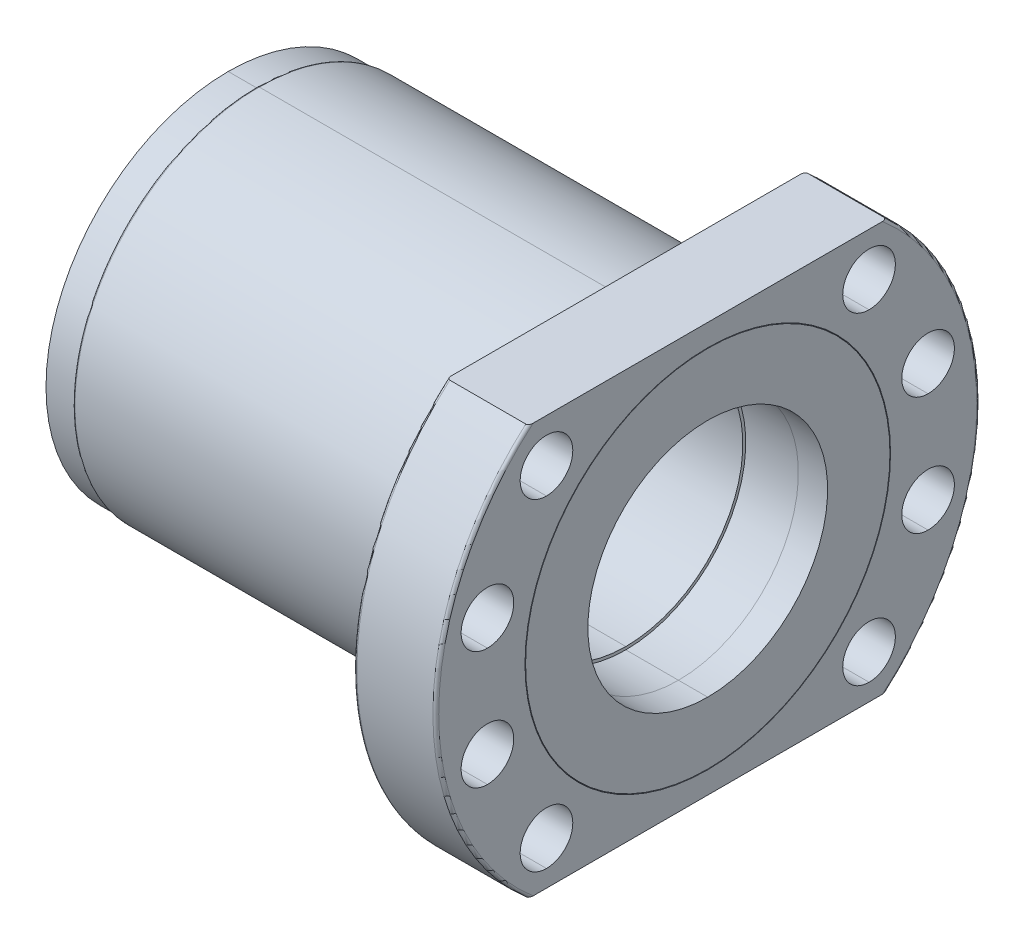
ISO-10303-21;
HEADER;
FILE_DESCRIPTION(('STEP AP214'),'2;1');
FILE_NAME('part.step','',(''),(''),'','','');
FILE_SCHEMA(('AUTOMOTIVE_DESIGN { 1 0 10303 214 1 1 1 1 }'));
ENDSEC;
DATA;
#1=APPLICATION_CONTEXT('core data for automotive mechanical design processes');
#2=APPLICATION_PROTOCOL_DEFINITION('international standard','automotive_design',2000,#1);
#3=PRODUCT_CONTEXT('',#1,'mechanical');
#4=PRODUCT('Part','Part','',(#3));
#5=PRODUCT_RELATED_PRODUCT_CATEGORY('part','',(#4));
#6=PRODUCT_DEFINITION_FORMATION('','',#4);
#7=PRODUCT_DEFINITION_CONTEXT('part definition',#1,'design');
#8=PRODUCT_DEFINITION('design','',#6,#7);
#9=PRODUCT_DEFINITION_SHAPE('','',#8);
#10=(LENGTH_UNIT() NAMED_UNIT(*) SI_UNIT(.MILLI.,.METRE.));
#11=(NAMED_UNIT(*) PLANE_ANGLE_UNIT() SI_UNIT($,.RADIAN.));
#12=(NAMED_UNIT(*) SI_UNIT($,.STERADIAN.) SOLID_ANGLE_UNIT());
#13=UNCERTAINTY_MEASURE_WITH_UNIT(LENGTH_MEASURE(1.E-05),#10,'distance_accuracy_value','');
#14=(GEOMETRIC_REPRESENTATION_CONTEXT(3) GLOBAL_UNCERTAINTY_ASSIGNED_CONTEXT((#13)) GLOBAL_UNIT_ASSIGNED_CONTEXT((#10,
#11,#12)) REPRESENTATION_CONTEXT('',''));
#15=CARTESIAN_POINT('',(0.,0.,0.));
#16=DIRECTION('',(0.,0.,1.));
#17=DIRECTION('',(1.,0.,0.));
#18=AXIS2_PLACEMENT_3D('',#15,#16,#17);
#19=CARTESIAN_POINT('',(-16.1896484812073,0.,0.));
#20=DIRECTION('',(-1.,0.,0.));
#21=DIRECTION('',(0.,0.,1.));
#22=AXIS2_PLACEMENT_3D('',#19,#20,#21);
#23=PLANE('',#22);
#24=CARTESIAN_POINT('',(-16.1896484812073,0.,0.));
#25=DIRECTION('',(-1.,0.,0.));
#26=DIRECTION('',(0.,-1.,0.));
#27=AXIS2_PLACEMENT_3D('',#24,#25,#26);
#28=CIRCLE('',#27,20.);
#29=CARTESIAN_POINT('',(-16.1896484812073,-20.,0.));
#30=VERTEX_POINT('',#29);
#31=CARTESIAN_POINT('',(-16.1896484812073,20.,0.));
#32=VERTEX_POINT('',#31);
#33=EDGE_CURVE('P0_E11',#30,#32,#28,.T.);
#34=ORIENTED_EDGE('',*,*,#33,.T.);
#35=CARTESIAN_POINT('',(-16.1896484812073,0.,0.));
#36=DIRECTION('',(-1.,0.,0.));
#37=DIRECTION('',(0.,-1.,0.));
#38=AXIS2_PLACEMENT_3D('',#35,#36,#37);
#39=CIRCLE('',#38,20.);
#40=EDGE_CURVE('P0_E326',#32,#30,#39,.T.);
#41=ORIENTED_EDGE('',*,*,#40,.T.);
#42=EDGE_LOOP('',(#34,#41));
#43=FACE_BOUND('',#42,.T.);
#44=CARTESIAN_POINT('',(-16.1896484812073,0.,0.));
#45=DIRECTION('',(1.,0.,0.));
#46=DIRECTION('',(0.,-1.,0.));
#47=AXIS2_PLACEMENT_3D('',#44,#45,#46);
#48=CIRCLE('',#47,20.5);
#49=CARTESIAN_POINT('',(-16.1896484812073,-20.5,0.));
#50=VERTEX_POINT('',#49);
#51=CARTESIAN_POINT('',(-16.1896484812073,20.5,0.));
#52=VERTEX_POINT('',#51);
#53=EDGE_CURVE('P0_E355',#50,#52,#48,.T.);
#54=ORIENTED_EDGE('',*,*,#53,.T.);
#55=CARTESIAN_POINT('',(-16.1896484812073,0.,0.));
#56=DIRECTION('',(1.,0.,0.));
#57=DIRECTION('',(0.,-1.,0.));
#58=AXIS2_PLACEMENT_3D('',#55,#56,#57);
#59=CIRCLE('',#58,20.5);
#60=EDGE_CURVE('P0_E368',#52,#50,#59,.T.);
#61=ORIENTED_EDGE('',*,*,#60,.T.);
#62=EDGE_LOOP('',(#54,#61));
#63=FACE_BOUND('',#62,.T.);
#64=ADVANCED_FACE('P0_F17',(#43,#63),#23,.F.);
#65=CARTESIAN_POINT('',(19.,0.,0.));
#66=DIRECTION('',(-1.,0.,0.));
#67=DIRECTION('',(0.,-1.,0.));
#68=AXIS2_PLACEMENT_3D('',#65,#66,#67);
#69=CYLINDRICAL_SURFACE('',#68,20.);
#70=DIRECTION('',(-1.,0.,0.));
#71=VECTOR('',#70,1.);
#72=CARTESIAN_POINT('',(19.,20.,0.));
#73=LINE('',#72,#71);
#74=CARTESIAN_POINT('',(-78.8896484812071,20.,0.));
#75=VERTEX_POINT('',#74);
#76=EDGE_CURVE('P0_E331',#32,#75,#73,.T.);
#77=ORIENTED_EDGE('',*,*,#76,.F.);
#78=ORIENTED_EDGE('',*,*,#33,.F.);
#79=DIRECTION('',(-1.,0.,0.));
#80=VECTOR('',#79,1.);
#81=CARTESIAN_POINT('',(19.,-20.,0.));
#82=LINE('',#81,#80);
#83=CARTESIAN_POINT('',(-78.8896484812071,-20.,0.));
#84=VERTEX_POINT('',#83);
#85=EDGE_CURVE('P0_E340',#30,#84,#82,.T.);
#86=ORIENTED_EDGE('',*,*,#85,.T.);
#87=CARTESIAN_POINT('',(-78.8896484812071,0.,0.));
#88=DIRECTION('',(-1.,0.,0.));
#89=DIRECTION('',(0.,0.,-1.));
#90=AXIS2_PLACEMENT_3D('',#87,#88,#89);
#91=CIRCLE('',#90,20.);
#92=EDGE_CURVE('P0_E28',#84,#75,#91,.T.);
#93=ORIENTED_EDGE('',*,*,#92,.T.);
#94=EDGE_LOOP('',(#77,#78,#86,#93));
#95=FACE_BOUND('',#94,.T.);
#96=ADVANCED_FACE('P0_F332',(#95),#69,.F.);
#97=CARTESIAN_POINT('',(-2.18964848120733,10.0939,37.6711));
#98=DIRECTION('',(-1.,0.,0.));
#99=DIRECTION('',(0.,-1.,0.));
#100=AXIS2_PLACEMENT_3D('',#97,#98,#99);
#101=CYLINDRICAL_SURFACE('',#100,4.5);
#102=CARTESIAN_POINT('',(-2.18964848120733,10.0939,37.6711));
#103=DIRECTION('',(-1.,0.,0.));
#104=DIRECTION('',(0.,-1.,0.));
#105=AXIS2_PLACEMENT_3D('',#102,#103,#104);
#106=CIRCLE('',#105,4.5);
#107=CARTESIAN_POINT('',(-2.18964848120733,14.5939,37.6711));
#108=VERTEX_POINT('',#107);
#109=CARTESIAN_POINT('',(-2.18964848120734,5.5939,37.6711));
#110=VERTEX_POINT('',#109);
#111=EDGE_CURVE('P0_E525',#108,#110,#106,.T.);
#112=ORIENTED_EDGE('',*,*,#111,.F.);
#113=DIRECTION('',(-1.,0.,0.));
#114=VECTOR('',#113,1.);
#115=CARTESIAN_POINT('',(-2.18964848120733,14.5939,37.6711));
#116=LINE('',#115,#114);
#117=CARTESIAN_POINT('',(-16.1896484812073,14.5939,37.6711));
#118=VERTEX_POINT('',#117);
#119=EDGE_CURVE('P0_E478',#108,#118,#116,.T.);
#120=ORIENTED_EDGE('',*,*,#119,.T.);
#121=CARTESIAN_POINT('',(-16.1896484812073,10.0939,37.6711));
#122=DIRECTION('',(1.,0.,0.));
#123=DIRECTION('',(0.,-1.,0.));
#124=AXIS2_PLACEMENT_3D('',#121,#122,#123);
#125=CIRCLE('',#124,4.5);
#126=CARTESIAN_POINT('',(-16.1896484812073,5.5939,37.6711));
#127=VERTEX_POINT('',#126);
#128=EDGE_CURVE('P0_E400',#127,#118,#125,.T.);
#129=ORIENTED_EDGE('',*,*,#128,.F.);
#130=DIRECTION('',(-1.,0.,0.));
#131=VECTOR('',#130,1.);
#132=CARTESIAN_POINT('',(-2.18964848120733,5.5939,37.6711));
#133=LINE('',#132,#131);
#134=EDGE_CURVE('P0_E473',#110,#127,#133,.T.);
#135=ORIENTED_EDGE('',*,*,#134,.F.);
#136=EDGE_LOOP('',(#112,#120,#129,#135));
#137=FACE_BOUND('',#136,.T.);
#138=ADVANCED_FACE('P0_F1535',(#137),#101,.F.);
#139=CARTESIAN_POINT('',(-2.18964848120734,-10.0939,37.6711));
#140=DIRECTION('',(-1.,0.,0.));
#141=DIRECTION('',(0.,-1.,0.));
#142=AXIS2_PLACEMENT_3D('',#139,#140,#141);
#143=CYLINDRICAL_SURFACE('',#142,4.5);
#144=CARTESIAN_POINT('',(-2.18964848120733,-10.0939,37.6711));
#145=DIRECTION('',(-1.,0.,0.));
#146=DIRECTION('',(0.,-1.,0.));
#147=AXIS2_PLACEMENT_3D('',#144,#145,#146);
#148=CIRCLE('',#147,4.5);
#149=CARTESIAN_POINT('',(-2.18964848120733,-5.5939,37.6711));
#150=VERTEX_POINT('',#149);
#151=CARTESIAN_POINT('',(-2.18964848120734,-14.5939,37.6711));
#152=VERTEX_POINT('',#151);
#153=EDGE_CURVE('P0_E538',#150,#152,#148,.T.);
#154=ORIENTED_EDGE('',*,*,#153,.F.);
#155=DIRECTION('',(-1.,0.,0.));
#156=VECTOR('',#155,1.);
#157=CARTESIAN_POINT('',(-2.18964848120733,-5.5939,37.6711));
#158=LINE('',#157,#156);
#159=CARTESIAN_POINT('',(-16.1896484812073,-5.5939,37.6711));
#160=VERTEX_POINT('',#159);
#161=EDGE_CURVE('P0_E498',#150,#160,#158,.T.);
#162=ORIENTED_EDGE('',*,*,#161,.T.);
#163=CARTESIAN_POINT('',(-16.1896484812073,-10.0939,37.6711));
#164=DIRECTION('',(1.,0.,0.));
#165=DIRECTION('',(0.,-1.,0.));
#166=AXIS2_PLACEMENT_3D('',#163,#164,#165);
#167=CIRCLE('',#166,4.5);
#168=CARTESIAN_POINT('',(-16.1896484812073,-14.5939,37.6711));
#169=VERTEX_POINT('',#168);
#170=EDGE_CURVE('P0_E541',#169,#160,#167,.T.);
#171=ORIENTED_EDGE('',*,*,#170,.F.);
#172=DIRECTION('',(-1.,0.,0.));
#173=VECTOR('',#172,1.);
#174=CARTESIAN_POINT('',(-2.18964848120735,-14.5939,37.6711));
#175=LINE('',#174,#173);
#176=EDGE_CURVE('P0_E545',#152,#169,#175,.T.);
#177=ORIENTED_EDGE('',*,*,#176,.F.);
#178=EDGE_LOOP('',(#154,#162,#171,#177));
#179=FACE_BOUND('',#178,.T.);
#180=ADVANCED_FACE('P0_F1540',(#179),#143,.F.);
#181=CARTESIAN_POINT('',(-2.18964848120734,-10.0939,-37.6711));
#182=DIRECTION('',(-1.,0.,0.));
#183=DIRECTION('',(0.,-1.,0.));
#184=AXIS2_PLACEMENT_3D('',#181,#182,#183);
#185=CYLINDRICAL_SURFACE('',#184,4.5);
#186=CARTESIAN_POINT('',(-2.18964848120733,-10.0939,-37.6711));
#187=DIRECTION('',(-1.,0.,0.));
#188=DIRECTION('',(0.,-1.,0.));
#189=AXIS2_PLACEMENT_3D('',#186,#187,#188);
#190=CIRCLE('',#189,4.5);
#191=CARTESIAN_POINT('',(-2.18964848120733,-5.5939,-37.6711));
#192=VERTEX_POINT('',#191);
#193=CARTESIAN_POINT('',(-2.18964848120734,-14.5939,-37.6711));
#194=VERTEX_POINT('',#193);
#195=EDGE_CURVE('P0_E524',#192,#194,#190,.T.);
#196=ORIENTED_EDGE('',*,*,#195,.F.);
#197=DIRECTION('',(-1.,0.,0.));
#198=VECTOR('',#197,1.);
#199=CARTESIAN_POINT('',(-2.18964848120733,-5.5939,-37.6711));
#200=LINE('',#199,#198);
#201=CARTESIAN_POINT('',(-16.1896484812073,-5.5939,-37.6711));
#202=VERTEX_POINT('',#201);
#203=EDGE_CURVE('P0_E464',#192,#202,#200,.T.);
#204=ORIENTED_EDGE('',*,*,#203,.T.);
#205=CARTESIAN_POINT('',(-16.1896484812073,-10.0939,-37.6711));
#206=DIRECTION('',(1.,0.,0.));
#207=DIRECTION('',(0.,-1.,0.));
#208=AXIS2_PLACEMENT_3D('',#205,#206,#207);
#209=CIRCLE('',#208,4.5);
#210=CARTESIAN_POINT('',(-16.1896484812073,-14.5939,-37.6711));
#211=VERTEX_POINT('',#210);
#212=EDGE_CURVE('P0_E630',#211,#202,#209,.T.);
#213=ORIENTED_EDGE('',*,*,#212,.F.);
#214=DIRECTION('',(-1.,0.,0.));
#215=VECTOR('',#214,1.);
#216=CARTESIAN_POINT('',(-2.18964848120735,-14.5939,-37.6711));
#217=LINE('',#216,#215);
#218=EDGE_CURVE('P0_E459',#194,#211,#217,.T.);
#219=ORIENTED_EDGE('',*,*,#218,.F.);
#220=EDGE_LOOP('',(#196,#204,#213,#219));
#221=FACE_BOUND('',#220,.T.);
#222=ADVANCED_FACE('P0_F1770',(#221),#185,.F.);
#223=CARTESIAN_POINT('',(-2.18964848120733,10.0939,-37.6711));
#224=DIRECTION('',(-1.,0.,0.));
#225=DIRECTION('',(0.,-1.,0.));
#226=AXIS2_PLACEMENT_3D('',#223,#224,#225);
#227=CYLINDRICAL_SURFACE('',#226,4.5);
#228=CARTESIAN_POINT('',(-2.18964848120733,10.0939,-37.6711));
#229=DIRECTION('',(-1.,0.,0.));
#230=DIRECTION('',(0.,-1.,0.));
#231=AXIS2_PLACEMENT_3D('',#228,#229,#230);
#232=CIRCLE('',#231,4.5);
#233=CARTESIAN_POINT('',(-2.18964848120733,14.5939,-37.6711));
#234=VERTEX_POINT('',#233);
#235=CARTESIAN_POINT('',(-2.18964848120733,5.5939,-37.6711));
#236=VERTEX_POINT('',#235);
#237=EDGE_CURVE('P0_E506',#234,#236,#232,.T.);
#238=ORIENTED_EDGE('',*,*,#237,.F.);
#239=DIRECTION('',(-1.,0.,0.));
#240=VECTOR('',#239,1.);
#241=CARTESIAN_POINT('',(-2.18964848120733,14.5939,-37.6711));
#242=LINE('',#241,#240);
#243=CARTESIAN_POINT('',(-16.1896484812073,14.5939,-37.6711));
#244=VERTEX_POINT('',#243);
#245=EDGE_CURVE('P0_E434',#234,#244,#242,.T.);
#246=ORIENTED_EDGE('',*,*,#245,.T.);
#247=CARTESIAN_POINT('',(-16.1896484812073,10.0939,-37.6711));
#248=DIRECTION('',(1.,0.,0.));
#249=DIRECTION('',(0.,-1.,0.));
#250=AXIS2_PLACEMENT_3D('',#247,#248,#249);
#251=CIRCLE('',#250,4.5);
#252=CARTESIAN_POINT('',(-16.1896484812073,5.5939,-37.6711));
#253=VERTEX_POINT('',#252);
#254=EDGE_CURVE('P0_E627',#253,#244,#251,.T.);
#255=ORIENTED_EDGE('',*,*,#254,.F.);
#256=DIRECTION('',(-1.,0.,0.));
#257=VECTOR('',#256,1.);
#258=CARTESIAN_POINT('',(-2.18964848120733,5.5939,-37.6711));
#259=LINE('',#258,#257);
#260=EDGE_CURVE('P0_E429',#236,#253,#259,.T.);
#261=ORIENTED_EDGE('',*,*,#260,.F.);
#262=EDGE_LOOP('',(#238,#246,#255,#261));
#263=FACE_BOUND('',#262,.T.);
#264=ADVANCED_FACE('P0_F1757',(#263),#227,.F.);
#265=CARTESIAN_POINT('',(-2.18964848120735,-27.5772,-27.5772));
#266=DIRECTION('',(-1.,0.,0.));
#267=DIRECTION('',(0.,-1.,0.));
#268=AXIS2_PLACEMENT_3D('',#265,#266,#267);
#269=CYLINDRICAL_SURFACE('',#268,4.5);
#270=CARTESIAN_POINT('',(-2.18964848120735,-27.5772,-27.5772));
#271=DIRECTION('',(-1.,0.,0.));
#272=DIRECTION('',(0.,-1.,0.));
#273=AXIS2_PLACEMENT_3D('',#270,#271,#272);
#274=CIRCLE('',#273,4.5);
#275=CARTESIAN_POINT('',(-2.18964848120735,-23.0772,-27.5772));
#276=VERTEX_POINT('',#275);
#277=CARTESIAN_POINT('',(-2.18964848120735,-32.0772,-27.5772));
#278=VERTEX_POINT('',#277);
#279=EDGE_CURVE('P0_E494',#276,#278,#274,.T.);
#280=ORIENTED_EDGE('',*,*,#279,.F.);
#281=DIRECTION('',(-1.,0.,0.));
#282=VECTOR('',#281,1.);
#283=CARTESIAN_POINT('',(-2.18964848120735,-23.0772,-27.5772));
#284=LINE('',#283,#282);
#285=CARTESIAN_POINT('',(-16.1896484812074,-23.0772,-27.5772));
#286=VERTEX_POINT('',#285);
#287=EDGE_CURVE('P0_E596',#276,#286,#284,.T.);
#288=ORIENTED_EDGE('',*,*,#287,.T.);
#289=CARTESIAN_POINT('',(-16.1896484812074,-27.5772,-27.5772));
#290=DIRECTION('',(1.,0.,0.));
#291=DIRECTION('',(0.,-1.,0.));
#292=AXIS2_PLACEMENT_3D('',#289,#290,#291);
#293=CIRCLE('',#292,4.5);
#294=CARTESIAN_POINT('',(-16.1896484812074,-32.0772,-27.5772));
#295=VERTEX_POINT('',#294);
#296=EDGE_CURVE('P0_E624',#295,#286,#293,.T.);
#297=ORIENTED_EDGE('',*,*,#296,.F.);
#298=DIRECTION('',(-1.,0.,0.));
#299=VECTOR('',#298,1.);
#300=CARTESIAN_POINT('',(-2.18964848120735,-32.0772,-27.5772));
#301=LINE('',#300,#299);
#302=EDGE_CURVE('P0_E555',#278,#295,#301,.T.);
#303=ORIENTED_EDGE('',*,*,#302,.F.);
#304=EDGE_LOOP('',(#280,#288,#297,#303));
#305=FACE_BOUND('',#304,.T.);
#306=ADVANCED_FACE('P0_F1744',(#305),#269,.F.);
#307=CARTESIAN_POINT('',(-2.18964848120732,27.5772,-27.5772));
#308=DIRECTION('',(-1.,0.,0.));
#309=DIRECTION('',(0.,-1.,0.));
#310=AXIS2_PLACEMENT_3D('',#307,#308,#309);
#311=CYLINDRICAL_SURFACE('',#310,4.5);
#312=CARTESIAN_POINT('',(-2.18964848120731,27.5772,-27.5772));
#313=DIRECTION('',(-1.,0.,0.));
#314=DIRECTION('',(0.,-1.,0.));
#315=AXIS2_PLACEMENT_3D('',#312,#313,#314);
#316=CIRCLE('',#315,4.5);
#317=CARTESIAN_POINT('',(-2.18964848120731,32.0772,-27.5772));
#318=VERTEX_POINT('',#317);
#319=CARTESIAN_POINT('',(-2.18964848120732,23.0772,-27.5772));
#320=VERTEX_POINT('',#319);
#321=EDGE_CURVE('P0_E482',#318,#320,#316,.T.);
#322=ORIENTED_EDGE('',*,*,#321,.F.);
#323=DIRECTION('',(-1.,0.,0.));
#324=VECTOR('',#323,1.);
#325=CARTESIAN_POINT('',(-2.18964848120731,32.0772,-27.5772));
#326=LINE('',#325,#324);
#327=CARTESIAN_POINT('',(-16.1896484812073,32.0772,-27.5772));
#328=VERTEX_POINT('',#327);
#329=EDGE_CURVE('P0_E564',#318,#328,#326,.T.);
#330=ORIENTED_EDGE('',*,*,#329,.T.);
#331=CARTESIAN_POINT('',(-16.1896484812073,27.5772,-27.5772));
#332=DIRECTION('',(1.,0.,0.));
#333=DIRECTION('',(0.,-1.,0.));
#334=AXIS2_PLACEMENT_3D('',#331,#332,#333);
#335=CIRCLE('',#334,4.5);
#336=CARTESIAN_POINT('',(-16.1896484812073,23.0772,-27.5772));
#337=VERTEX_POINT('',#336);
#338=EDGE_CURVE('P0_E621',#337,#328,#335,.T.);
#339=ORIENTED_EDGE('',*,*,#338,.F.);
#340=DIRECTION('',(-1.,0.,0.));
#341=VECTOR('',#340,1.);
#342=CARTESIAN_POINT('',(-2.18964848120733,23.0772,-27.5772));
#343=LINE('',#342,#341);
#344=EDGE_CURVE('P0_E559',#320,#337,#343,.T.);
#345=ORIENTED_EDGE('',*,*,#344,.F.);
#346=EDGE_LOOP('',(#322,#330,#339,#345));
#347=FACE_BOUND('',#346,.T.);
#348=ADVANCED_FACE('P0_F1731',(#347),#311,.F.);
#349=CARTESIAN_POINT('',(-2.18964848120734,-27.5772,27.5772));
#350=DIRECTION('',(-1.,0.,0.));
#351=DIRECTION('',(0.,-1.,0.));
#352=AXIS2_PLACEMENT_3D('',#349,#350,#351);
#353=CYLINDRICAL_SURFACE('',#352,4.5);
#354=CARTESIAN_POINT('',(-2.18964848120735,-27.5772,27.5772));
#355=DIRECTION('',(-1.,0.,0.));
#356=DIRECTION('',(0.,-1.,0.));
#357=AXIS2_PLACEMENT_3D('',#354,#355,#356);
#358=CIRCLE('',#357,4.5);
#359=CARTESIAN_POINT('',(-2.18964848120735,-23.0772,27.5772));
#360=VERTEX_POINT('',#359);
#361=CARTESIAN_POINT('',(-2.18964848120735,-32.0772,27.5772));
#362=VERTEX_POINT('',#361);
#363=EDGE_CURVE('P0_E369',#360,#362,#358,.T.);
#364=ORIENTED_EDGE('',*,*,#363,.F.);
#365=DIRECTION('',(-1.,0.,0.));
#366=VECTOR('',#365,1.);
#367=CARTESIAN_POINT('',(-2.18964848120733,-23.0772,27.5772));
#368=LINE('',#367,#366);
#369=CARTESIAN_POINT('',(-16.1896484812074,-23.0772,27.5772));
#370=VERTEX_POINT('',#369);
#371=EDGE_CURVE('P0_E568',#360,#370,#368,.T.);
#372=ORIENTED_EDGE('',*,*,#371,.T.);
#373=CARTESIAN_POINT('',(-16.1896484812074,-27.5772,27.5772));
#374=DIRECTION('',(1.,0.,0.));
#375=DIRECTION('',(0.,-1.,0.));
#376=AXIS2_PLACEMENT_3D('',#373,#374,#375);
#377=CIRCLE('',#376,4.5);
#378=CARTESIAN_POINT('',(-16.1896484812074,-32.0772,27.5772));
#379=VERTEX_POINT('',#378);
#380=EDGE_CURVE('P0_E490',#379,#370,#377,.T.);
#381=ORIENTED_EDGE('',*,*,#380,.F.);
#382=DIRECTION('',(-1.,0.,0.));
#383=VECTOR('',#382,1.);
#384=CARTESIAN_POINT('',(-2.18964848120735,-32.0772,27.5772));
#385=LINE('',#384,#383);
#386=EDGE_CURVE('P0_E576',#362,#379,#385,.T.);
#387=ORIENTED_EDGE('',*,*,#386,.F.);
#388=EDGE_LOOP('',(#364,#372,#381,#387));
#389=FACE_BOUND('',#388,.T.);
#390=ADVANCED_FACE('P0_F1718',(#389),#353,.F.);
#391=CARTESIAN_POINT('',(-2.18964848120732,27.5772,27.5772));
#392=DIRECTION('',(-1.,0.,0.));
#393=DIRECTION('',(0.,-1.,0.));
#394=AXIS2_PLACEMENT_3D('',#391,#392,#393);
#395=CYLINDRICAL_SURFACE('',#394,4.5);
#396=CARTESIAN_POINT('',(-2.18964848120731,27.5772,27.5772));
#397=DIRECTION('',(-1.,0.,0.));
#398=DIRECTION('',(0.,-1.,0.));
#399=AXIS2_PLACEMENT_3D('',#396,#397,#398);
#400=CIRCLE('',#399,4.5);
#401=CARTESIAN_POINT('',(-2.18964848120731,32.0772,27.5772));
#402=VERTEX_POINT('',#401);
#403=CARTESIAN_POINT('',(-2.18964848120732,23.0772,27.5772));
#404=VERTEX_POINT('',#403);
#405=EDGE_CURVE('P0_E438',#402,#404,#400,.T.);
#406=ORIENTED_EDGE('',*,*,#405,.F.);
#407=DIRECTION('',(-1.,0.,0.));
#408=VECTOR('',#407,1.);
#409=CARTESIAN_POINT('',(-2.18964848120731,32.0772,27.5772));
#410=LINE('',#409,#408);
#411=CARTESIAN_POINT('',(-16.1896484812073,32.0772,27.5772));
#412=VERTEX_POINT('',#411);
#413=EDGE_CURVE('P0_E354',#402,#412,#410,.T.);
#414=ORIENTED_EDGE('',*,*,#413,.T.);
#415=CARTESIAN_POINT('',(-16.1896484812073,27.5772,27.5772));
#416=DIRECTION('',(1.,0.,0.));
#417=DIRECTION('',(0.,-1.,0.));
#418=AXIS2_PLACEMENT_3D('',#415,#416,#417);
#419=CIRCLE('',#418,4.5);
#420=CARTESIAN_POINT('',(-16.1896484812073,23.0772,27.5772));
#421=VERTEX_POINT('',#420);
#422=EDGE_CURVE('P0_E487',#421,#412,#419,.T.);
#423=ORIENTED_EDGE('',*,*,#422,.F.);
#424=DIRECTION('',(-1.,0.,0.));
#425=VECTOR('',#424,1.);
#426=CARTESIAN_POINT('',(-2.18964848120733,23.0772,27.5772));
#427=LINE('',#426,#425);
#428=EDGE_CURVE('P0_E349',#404,#421,#427,.T.);
#429=ORIENTED_EDGE('',*,*,#428,.F.);
#430=EDGE_LOOP('',(#406,#414,#423,#429));
#431=FACE_BOUND('',#430,.T.);
#432=ADVANCED_FACE('P0_F1455',(#431),#395,.F.);
#433=CARTESIAN_POINT('',(-100.,0.,0.));
#434=DIRECTION('',(1.,0.,0.));
#435=DIRECTION('',(0.,1.,0.));
#436=AXIS2_PLACEMENT_3D('',#433,#434,#435);
#437=CYLINDRICAL_SURFACE('',#436,31.25);
#438=CARTESIAN_POINT('',(-7.18964848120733,0.,0.));
#439=DIRECTION('',(1.,0.,0.));
#440=DIRECTION('',(0.,1.,0.));
#441=AXIS2_PLACEMENT_3D('',#438,#439,#440);
#442=CIRCLE('',#441,31.25);
#443=CARTESIAN_POINT('',(-7.18964848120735,-31.25,0.));
#444=VERTEX_POINT('',#443);
#445=CARTESIAN_POINT('',(-7.18964848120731,31.25,0.));
#446=VERTEX_POINT('',#445);
#447=EDGE_CURVE('P0_E408',#444,#446,#442,.T.);
#448=ORIENTED_EDGE('',*,*,#447,.F.);
#449=DIRECTION('',(1.,0.,0.));
#450=VECTOR('',#449,1.);
#451=CARTESIAN_POINT('',(-100.,-31.25,0.));
#452=LINE('',#451,#450);
#453=CARTESIAN_POINT('',(-2.18964848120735,-31.25,0.));
#454=VERTEX_POINT('',#453);
#455=EDGE_CURVE('P0_E439',#444,#454,#452,.T.);
#456=ORIENTED_EDGE('',*,*,#455,.T.);
#457=CARTESIAN_POINT('',(-2.18964848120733,0.,0.));
#458=DIRECTION('',(1.,0.,0.));
#459=DIRECTION('',(0.,1.,0.));
#460=AXIS2_PLACEMENT_3D('',#457,#458,#459);
#461=CIRCLE('',#460,31.25);
#462=CARTESIAN_POINT('',(-2.18964848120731,31.25,0.));
#463=VERTEX_POINT('',#462);
#464=EDGE_CURVE('P0_E529',#454,#463,#461,.T.);
#465=ORIENTED_EDGE('',*,*,#464,.T.);
#466=DIRECTION('',(1.,0.,0.));
#467=VECTOR('',#466,1.);
#468=CARTESIAN_POINT('',(-100.,31.25,0.));
#469=LINE('',#468,#467);
#470=EDGE_CURVE('P0_E443',#446,#463,#469,.T.);
#471=ORIENTED_EDGE('',*,*,#470,.F.);
#472=EDGE_LOOP('',(#448,#456,#465,#471));
#473=FACE_BOUND('',#472,.T.);
#474=ADVANCED_FACE('P0_F1449',(#473),#437,.F.);
#475=CARTESIAN_POINT('',(-78.8896484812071,0.,0.));
#476=DIRECTION('',(1.,0.,0.));
#477=DIRECTION('',(0.,1.,0.));
#478=AXIS2_PLACEMENT_3D('',#475,#476,#477);
#479=CYLINDRICAL_SURFACE('',#478,31.5);
#480=DIRECTION('',(1.,0.,0.));
#481=VECTOR('',#480,1.);
#482=CARTESIAN_POINT('',(-78.8896484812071,-31.5,0.));
#483=LINE('',#482,#481);
#484=CARTESIAN_POINT('',(-78.8896484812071,-31.5,0.));
#485=VERTEX_POINT('',#484);
#486=CARTESIAN_POINT('',(-16.1896484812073,-31.5,0.));
#487=VERTEX_POINT('',#486);
#488=EDGE_CURVE('P0_E381',#485,#487,#483,.T.);
#489=ORIENTED_EDGE('',*,*,#488,.F.);
#490=CARTESIAN_POINT('',(-78.8896484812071,0.,0.));
#491=DIRECTION('',(1.,0.,0.));
#492=DIRECTION('',(0.,1.,0.));
#493=AXIS2_PLACEMENT_3D('',#490,#491,#492);
#494=CIRCLE('',#493,31.5);
#495=CARTESIAN_POINT('',(-78.8896484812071,31.5,0.));
#496=VERTEX_POINT('',#495);
#497=EDGE_CURVE('P0_E569',#485,#496,#494,.T.);
#498=ORIENTED_EDGE('',*,*,#497,.T.);
#499=DIRECTION('',(1.,0.,0.));
#500=VECTOR('',#499,1.);
#501=CARTESIAN_POINT('',(-78.8896484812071,31.5,0.));
#502=LINE('',#501,#500);
#503=CARTESIAN_POINT('',(-16.1896484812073,31.5,0.));
#504=VERTEX_POINT('',#503);
#505=EDGE_CURVE('P0_E385',#496,#504,#502,.T.);
#506=ORIENTED_EDGE('',*,*,#505,.T.);
#507=CARTESIAN_POINT('',(-16.1896484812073,0.,0.));
#508=DIRECTION('',(-1.,0.,0.));
#509=DIRECTION('',(0.,1.,0.));
#510=AXIS2_PLACEMENT_3D('',#507,#508,#509);
#511=CIRCLE('',#510,31.5);
#512=EDGE_CURVE('P0_E396',#504,#487,#511,.T.);
#513=ORIENTED_EDGE('',*,*,#512,.T.);
#514=EDGE_LOOP('',(#489,#498,#506,#513));
#515=FACE_BOUND('',#514,.T.);
#516=ADVANCED_FACE('P0_F1454',(#515),#479,.T.);
#517=CARTESIAN_POINT('',(-78.8896484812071,0.,0.));
#518=DIRECTION('',(1.,0.,0.));
#519=DIRECTION('',(0.,1.,0.));
#520=AXIS2_PLACEMENT_3D('',#517,#518,#519);
#521=TOROIDAL_SURFACE('',#520,31.2,0.299999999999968);
#522=CARTESIAN_POINT('',(-79.1896484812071,31.1999999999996,3.48713869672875E-06));
#523=CARTESIAN_POINT('',(-79.1896484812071,31.1999996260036,3.34620893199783));
#524=CARTESIAN_POINT('',(-79.1896484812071,30.6570814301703,6.69181956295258));
#525=CARTESIAN_POINT('',(-79.1896484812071,29.0698364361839,11.4535532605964));
#526=CARTESIAN_POINT('',(-79.1896484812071,28.4128118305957,12.9981305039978));
#527=CARTESIAN_POINT('',(-79.1896484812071,27.2480644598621,15.2211300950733));
#528=CARTESIAN_POINT('',(-79.1896484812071,26.8299974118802,15.9465061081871));
#529=CARTESIAN_POINT('',(-79.1896484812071,26.1601967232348,17.0076177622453));
#530=CARTESIAN_POINT('',(-79.1896484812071,25.8146257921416,17.5314380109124));
#531=CARTESIAN_POINT('',(-79.1896484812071,25.3932754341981,18.1300333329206));
#532=CARTESIAN_POINT('',(-79.1896484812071,25.1781186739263,18.4261085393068));
#533=CARTESIAN_POINT('',(-79.1896484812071,25.0694280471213,18.5733293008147));
#534=CARTESIAN_POINT('',(-79.1896484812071,25.0148057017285,18.6467340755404));
#535=CARTESIAN_POINT('',(-79.1896484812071,24.9874254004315,18.6833848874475));
#536=CARTESIAN_POINT('',(-79.1896484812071,24.9756761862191,18.6990813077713));
#537=CARTESIAN_POINT('',(-79.1896484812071,24.9678400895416,18.7095431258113));
#538=CARTESIAN_POINT('',(-79.1896484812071,24.9651122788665,18.7131836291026));
#539=CARTESIAN_POINT('',(-79.1896484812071,24.6327347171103,19.1563536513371));
#540=CARTESIAN_POINT('',(-79.1896484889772,24.2940942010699,19.584096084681));
#541=CARTESIAN_POINT('',(-79.1896484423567,23.7697723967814,20.2119297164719));
#542=CARTESIAN_POINT('',(-79.1896484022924,23.5035219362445,20.5224021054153));
#543=CARTESIAN_POINT('',(-79.189648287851,23.1859008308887,20.8784090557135));
#544=CARTESIAN_POINT('',(-79.1896482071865,23.0253620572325,21.0548374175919));
#545=CARTESIAN_POINT('',(-79.1896481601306,22.9446632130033,21.1426550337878));
#546=CARTESIAN_POINT('',(-79.189648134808,22.9042067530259,21.1864643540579));
#547=CARTESIAN_POINT('',(-79.1896481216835,22.8839518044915,21.2083440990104));
#548=CARTESIAN_POINT('',(-79.1896481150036,22.8738176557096,21.2192777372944));
#549=CARTESIAN_POINT('',(-79.1896481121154,22.8694730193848,21.2239622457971));
#550=CARTESIAN_POINT('',(-79.1896481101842,22.8665762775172,21.2270849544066));
#551=CARTESIAN_POINT('',(-79.1896481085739,22.864170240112,21.2296779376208));
#552=CARTESIAN_POINT('',(-79.1896480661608,22.8009078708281,21.2978473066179));
#553=CARTESIAN_POINT('',(-79.189648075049,22.6768355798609,21.4314295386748));
#554=CARTESIAN_POINT('',(-79.1896481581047,22.3936466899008,21.7258055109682));
#555=CARTESIAN_POINT('',(-79.1896481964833,22.2830182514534,21.8395466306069));
#556=CARTESIAN_POINT('',(-79.1896482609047,22.0916419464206,22.032482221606));
#557=CARTESIAN_POINT('',(-79.1896482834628,22.0236079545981,22.1005112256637));
#558=CARTESIAN_POINT('',(-79.1896483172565,21.9150330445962,22.2079603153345));
#559=CARTESIAN_POINT('',(-79.189648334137,21.8591143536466,22.2630359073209));
#560=CARTESIAN_POINT('',(-79.1896483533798,21.7909833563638,22.3296141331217));
#561=CARTESIAN_POINT('',(-79.1896483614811,21.7611603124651,22.3586408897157));
#562=CARTESIAN_POINT('',(-79.1896483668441,21.7411391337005,22.3781011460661));
#563=CARTESIAN_POINT('',(-79.1896483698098,21.7298935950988,22.3890154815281));
#564=CARTESIAN_POINT('',(-79.1896484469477,21.4334087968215,22.6764150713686));
#565=CARTESIAN_POINT('',(-79.1896484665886,21.1864173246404,22.9053862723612));
#566=CARTESIAN_POINT('',(-79.1896484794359,20.8832312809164,23.1808482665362));
#567=CARTESIAN_POINT('',(-79.1896484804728,20.7933563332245,23.2613144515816));
#568=CARTESIAN_POINT('',(-79.189648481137,20.6758883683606,23.3655920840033));
#569=CARTESIAN_POINT('',(-79.18964848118,20.6396214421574,23.3976127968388));
#570=CARTESIAN_POINT('',(-79.1896484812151,20.5729399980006,23.4562597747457));
#571=CARTESIAN_POINT('',(-79.1896484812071,20.5415787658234,23.4837122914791));
#572=CARTESIAN_POINT('',(-79.1896484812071,20.4090246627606,23.5993998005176));
#573=CARTESIAN_POINT('',(-79.1896484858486,20.2439523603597,23.7426282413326));
#574=CARTESIAN_POINT('',(-79.1896484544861,19.9030750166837,24.0278525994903));
#575=CARTESIAN_POINT('',(-79.189648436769,19.77387072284,24.1346146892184));
#576=CARTESIAN_POINT('',(-79.1896483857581,19.5558250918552,24.3111796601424));
#577=CARTESIAN_POINT('',(-79.1896483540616,19.4407397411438,24.4035632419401));
#578=CARTESIAN_POINT('',(-79.1896483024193,19.2956462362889,24.5182310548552));
#579=CARTESIAN_POINT('',(-79.1896482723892,19.2203635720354,24.5772468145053));
#580=CARTESIAN_POINT('',(-79.1896482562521,19.1820345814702,24.6071700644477));
#581=CARTESIAN_POINT('',(-79.1896482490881,19.1654601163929,24.6200827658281));
#582=CARTESIAN_POINT('',(-79.1896482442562,19.1543775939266,24.6287108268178));
#583=CARTESIAN_POINT('',(-79.1896482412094,19.1474609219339,24.6340911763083));
#584=CARTESIAN_POINT('',(-79.1896481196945,18.8734994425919,24.8470805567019));
#585=CARTESIAN_POINT('',(-79.1896479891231,18.6185993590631,25.0381514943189));
#586=CARTESIAN_POINT('',(-79.1896478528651,18.2606202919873,25.2992074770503));
#587=CARTESIAN_POINT('',(-79.1896478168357,18.1453512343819,25.3819652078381));
#588=CARTESIAN_POINT('',(-79.1896477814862,17.9787574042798,25.4999872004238));
#589=CARTESIAN_POINT('',(-79.1896477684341,17.8970375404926,25.5574692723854));
#590=CARTESIAN_POINT('',(-79.1896477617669,17.8045025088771,25.6219136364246));
#591=CARTESIAN_POINT('',(-79.1896477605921,17.7589415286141,25.6534882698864));
#592=CARTESIAN_POINT('',(-79.1896477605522,17.7395673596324,25.6668822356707));
#593=CARTESIAN_POINT('',(-79.1896477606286,17.7266850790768,25.6757809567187));
#594=CARTESIAN_POINT('',(-79.1896477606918,17.7214679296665,25.6793825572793));
#595=CARTESIAN_POINT('',(-79.1896477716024,17.226524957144,26.0207225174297));
#596=CARTESIAN_POINT('',(-79.189647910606,16.7296856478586,26.3428350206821));
#597=CARTESIAN_POINT('',(-79.1896481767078,15.9713926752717,26.8042730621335));
#598=CARTESIAN_POINT('',(-79.1896483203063,15.5889883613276,27.029560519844));
#599=CARTESIAN_POINT('',(-79.1896484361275,15.1374251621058,27.2827349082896));
#600=CARTESIAN_POINT('',(-79.1896484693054,14.9103223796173,27.4068882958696));
#601=CARTESIAN_POINT('',(-79.1896484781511,14.7964450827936,27.4683542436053));
#602=CARTESIAN_POINT('',(-79.189648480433,14.7394255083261,27.4989342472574));
#603=CARTESIAN_POINT('',(-79.1896484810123,14.7108955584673,27.5141859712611));
#604=CARTESIAN_POINT('',(-79.1896484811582,14.6966255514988,27.5218022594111));
#605=CARTESIAN_POINT('',(-79.1896484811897,14.690508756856,27.5250643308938));
#606=CARTESIAN_POINT('',(-79.1896484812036,14.6864306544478,27.5272385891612));
#607=CARTESIAN_POINT('',(-79.1896484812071,14.6825507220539,27.5293063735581));
#608=CARTESIAN_POINT('',(-79.1896484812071,14.5810519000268,27.5833918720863));
#609=CARTESIAN_POINT('',(-79.1896484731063,14.2254783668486,27.7768487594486));
#610=CARTESIAN_POINT('',(-79.1896484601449,12.9756752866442,28.3821566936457));
#611=CARTESIAN_POINT('',(-79.1896484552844,12.080443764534,28.7944070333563));
#612=CARTESIAN_POINT('',(-79.1896484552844,9.69280794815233,29.6834039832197));
#613=CARTESIAN_POINT('',(-79.1896484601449,8.19843214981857,30.1604674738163));
#614=CARTESIAN_POINT('',(-79.1896484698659,5.47711155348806,30.7293811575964));
#615=CARTESIAN_POINT('',(-79.1896484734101,4.49036106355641,30.8936987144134));
#616=CARTESIAN_POINT('',(-79.1896484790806,2.36010631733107,31.1290187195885));
#617=CARTESIAN_POINT('',(-79.1896484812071,1.21649721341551,31.1999791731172));
#618=CARTESIAN_POINT('',(-79.1896484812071,-0.00237491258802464,31.2000000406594));
#619=CARTESIAN_POINT('',(-79.1896484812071,-0.00248751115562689,31.1999999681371));
#620=CARTESIAN_POINT('',(-79.1896484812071,-0.00497557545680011,31.1999997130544));
#621=CARTESIAN_POINT('',(-79.1896484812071,-0.00870767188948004,31.1999991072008));
#622=CARTESIAN_POINT('',(-79.189648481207,-0.0174158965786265,31.1999961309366));
#623=CARTESIAN_POINT('',(-79.1896484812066,-0.0348323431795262,31.1999839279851));
#624=CARTESIAN_POINT('',(-79.1896484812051,-0.069665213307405,31.1999345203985));
#625=CARTESIAN_POINT('',(-79.1896484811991,-0.139330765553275,31.1997356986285));
#626=CARTESIAN_POINT('',(-79.1896484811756,-0.278660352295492,31.1989380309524));
#627=CARTESIAN_POINT('',(-79.1896484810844,-0.557307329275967,31.1957426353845));
#628=CARTESIAN_POINT('',(-79.189648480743,-1.11450349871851,31.1829521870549));
#629=CARTESIAN_POINT('',(-79.1896484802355,-1.59176457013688,31.1610211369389));
#630=CARTESIAN_POINT('',(-79.1896484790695,-2.54539160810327,31.1025557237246));
#631=CARTESIAN_POINT('',(-79.189648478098,-3.17994904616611,31.0441031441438));
#632=CARTESIAN_POINT('',(-79.189648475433,-5.07647060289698,30.8106471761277));
#633=CARTESIAN_POINT('',(-79.1896484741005,-6.33126970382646,30.5774737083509));
#634=CARTESIAN_POINT('',(-79.1896484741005,-10.0388388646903,29.6505815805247));
#635=CARTESIAN_POINT('',(-79.1896484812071,-12.4343322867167,28.728405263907));
#636=CARTESIAN_POINT('',(-79.1896484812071,-14.6845464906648,27.5282418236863));
#637=CARTESIAN_POINT('',(-79.1896484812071,-14.6834078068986,27.5288491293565));
#638=CARTESIAN_POINT('',(-79.1896484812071,-14.6844786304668,27.5282779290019));
#639=CARTESIAN_POINT('',(-79.1896484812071,-14.6861003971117,27.5274127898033));
#640=CARTESIAN_POINT('',(-79.1896484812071,-14.689993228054,27.5253357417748));
#641=CARTESIAN_POINT('',(-79.1896484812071,-14.6982136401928,27.5209479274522));
#642=CARTESIAN_POINT('',(-79.1896484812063,-14.716392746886,27.5112360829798));
#643=CARTESIAN_POINT('',(-79.1896484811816,-14.7596976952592,27.4880556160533));
#644=CARTESIAN_POINT('',(-79.1896484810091,-14.8087008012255,27.4617014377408));
#645=CARTESIAN_POINT('',(-79.1896484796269,-14.9224612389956,27.4001768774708));
#646=CARTESIAN_POINT('',(-79.1896484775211,-15.0193181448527,27.3474233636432));
#647=CARTESIAN_POINT('',(-79.1896484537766,-15.3718195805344,27.1519452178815));
#648=CARTESIAN_POINT('',(-79.1896484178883,-15.6896032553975,26.9722680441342));
#649=CARTESIAN_POINT('',(-79.1896482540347,-16.1837336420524,26.6751414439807));
#650=CARTESIAN_POINT('',(-79.1896482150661,-16.2873884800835,26.612068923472));
#651=CARTESIAN_POINT('',(-79.1896481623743,-16.4093013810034,26.5368117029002));
#652=CARTESIAN_POINT('',(-79.1896481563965,-16.4229208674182,26.5283900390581));
#653=CARTESIAN_POINT('',(-79.1896481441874,-16.4503065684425,26.5114264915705));
#654=CARTESIAN_POINT('',(-79.1896481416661,-16.4558869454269,26.5079620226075));
#655=CARTESIAN_POINT('',(-79.1896481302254,-16.4814170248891,26.4921107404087));
#656=CARTESIAN_POINT('',(-79.1896481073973,-16.5323339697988,26.4604286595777));
#657=CARTESIAN_POINT('',(-79.1896480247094,-16.7174574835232,26.3444940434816));
#658=CARTESIAN_POINT('',(-79.1896479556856,-16.8810085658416,26.2398528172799));
#659=CARTESIAN_POINT('',(-79.1896478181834,-17.2645847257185,25.9905098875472));
#660=CARTESIAN_POINT('',(-79.1896477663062,-17.5083732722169,25.8266814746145));
#661=CARTESIAN_POINT('',(-79.1896477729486,-17.8568142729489,25.5858319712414));
#662=CARTESIAN_POINT('',(-79.1896477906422,-17.9842469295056,25.4964293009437));
#663=CARTESIAN_POINT('',(-79.1896478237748,-18.1081118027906,25.4081829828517));
#664=CARTESIAN_POINT('',(-79.1896478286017,-18.125260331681,25.3959446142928));
#665=CARTESIAN_POINT('',(-79.1896478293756,-18.1279721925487,25.3940081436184));
#666=CARTESIAN_POINT('',(-79.1896478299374,-18.1298911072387,25.3926378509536));
#667=CARTESIAN_POINT('',(-79.189647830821,-18.1328271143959,25.3905409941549));
#668=CARTESIAN_POINT('',(-79.1896478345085,-18.1442262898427,25.3823966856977));
#669=CARTESIAN_POINT('',(-79.1896478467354,-18.1761608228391,25.3595513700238));
#670=CARTESIAN_POINT('',(-79.1896478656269,-18.2166706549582,25.3304635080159));
#671=CARTESIAN_POINT('',(-79.1896479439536,-18.3760487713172,25.2154918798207));
#672=CARTESIAN_POINT('',(-79.1896480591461,-18.5817269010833,25.0662020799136));
#673=CARTESIAN_POINT('',(-79.1896482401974,-19.0010751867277,24.7478043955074));
#674=CARTESIAN_POINT('',(-79.189648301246,-19.1592763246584,24.6258621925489));
#675=CARTESIAN_POINT('',(-79.1896483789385,-19.4228794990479,24.4176134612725));
#676=CARTESIAN_POINT('',(-79.1896484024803,-19.5151269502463,24.343970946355));
#677=CARTESIAN_POINT('',(-79.1896484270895,-19.6357425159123,24.2464395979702));
#678=CARTESIAN_POINT('',(-79.1896484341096,-19.6723250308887,24.2167692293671));
#679=CARTESIAN_POINT('',(-79.1896484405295,-19.7094992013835,24.1864766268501));
#680=CARTESIAN_POINT('',(-79.1896484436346,-19.7281844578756,24.1712261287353));
#681=CARTESIAN_POINT('',(-79.1896484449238,-19.736136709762,24.1647291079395));
#682=CARTESIAN_POINT('',(-79.1896484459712,-19.7426916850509,24.1593711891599));
#683=CARTESIAN_POINT('',(-79.189648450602,-19.7721946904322,24.1352460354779));
#684=CARTESIAN_POINT('',(-79.1896484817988,-20.011905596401,23.9385035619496));
#685=CARTESIAN_POINT('',(-79.1896484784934,-20.4644809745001,23.5560663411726));
#686=CARTESIAN_POINT('',(-79.1896484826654,-20.898879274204,23.1682547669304));
#687=CARTESIAN_POINT('',(-79.1896484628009,-21.1451218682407,22.9419217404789));
#688=CARTESIAN_POINT('',(-79.1896484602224,-21.1725084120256,22.9166598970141));
#689=CARTESIAN_POINT('',(-79.1896484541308,-21.2273322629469,22.8659075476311));
#690=CARTESIAN_POINT('',(-79.1896484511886,-21.2509267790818,22.8439851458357));
#691=CARTESIAN_POINT('',(-79.1896484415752,-21.3257110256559,22.7742915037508));
#692=CARTESIAN_POINT('',(-79.1896484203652,-21.4748214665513,22.6344131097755));
#693=CARTESIAN_POINT('',(-79.1896483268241,-22.0164862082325,22.1161572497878));
#694=CARTESIAN_POINT('',(-79.1896482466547,-22.4933165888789,21.6289469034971));
#695=CARTESIAN_POINT('',(-79.1896482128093,-23.60619119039,20.4304107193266));
#696=CARTESIAN_POINT('',(-79.1896484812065,-24.3060521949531,19.5923863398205));
#697=CARTESIAN_POINT('',(-79.1896484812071,-24.9612754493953,18.7182985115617));
#698=CARTESIAN_POINT('',(-79.1896484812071,-24.9601970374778,18.7197371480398));
#699=CARTESIAN_POINT('',(-79.1896484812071,-24.9604050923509,18.7194596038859));
#700=CARTESIAN_POINT('',(-79.189648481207,-24.9607280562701,18.7190287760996));
#701=CARTESIAN_POINT('',(-79.1896484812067,-24.961557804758,18.7179219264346));
#702=CARTESIAN_POINT('',(-79.1896484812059,-24.9635219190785,18.7153018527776));
#703=CARTESIAN_POINT('',(-79.1896484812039,-24.9686681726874,18.7084358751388));
#704=CARTESIAN_POINT('',(-79.1896484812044,-24.9838280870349,18.6881970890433));
#705=CARTESIAN_POINT('',(-79.1896484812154,-25.0051463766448,18.6596799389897));
#706=CARTESIAN_POINT('',(-79.1896484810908,-25.058780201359,18.5876772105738));
#707=CARTESIAN_POINT('',(-79.189648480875,-25.1092172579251,18.519730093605));
#708=CARTESIAN_POINT('',(-79.189648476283,-25.3031084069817,18.2549819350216));
#709=CARTESIAN_POINT('',(-79.1896484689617,-25.4894526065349,17.9974480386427));
#710=CARTESIAN_POINT('',(-79.1896484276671,-25.7843710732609,17.5678198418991));
#711=CARTESIAN_POINT('',(-79.1896484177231,-25.8464299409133,17.4764951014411));
#712=CARTESIAN_POINT('',(-79.1896484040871,-25.919518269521,17.367561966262));
#713=CARTESIAN_POINT('',(-79.1896484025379,-25.927684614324,17.3553722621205));
#714=CARTESIAN_POINT('',(-79.1896484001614,-25.9400017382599,17.3369583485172));
#715=CARTESIAN_POINT('',(-79.1896483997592,-25.9420656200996,17.3338698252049));
#716=CARTESIAN_POINT('',(-79.1896483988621,-25.9466916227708,17.3269466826));
#717=CARTESIAN_POINT('',(-79.1896483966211,-25.9582471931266,17.3096454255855));
#718=CARTESIAN_POINT('',(-79.1896483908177,-25.9881691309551,17.2647480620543));
#719=CARTESIAN_POINT('',(-79.1896483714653,-26.0884520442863,17.1134891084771));
#720=CARTESIAN_POINT('',(-79.1896483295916,-26.3177384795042,16.7615497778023));
#721=CARTESIAN_POINT('',(-79.1896483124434,-26.5127995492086,16.4495365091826));
#722=CARTESIAN_POINT('',(-79.189648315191,-26.6975379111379,16.1466760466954));
#723=CARTESIAN_POINT('',(-79.1896483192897,-26.7573965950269,16.047247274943));
#724=CARTESIAN_POINT('',(-79.1896483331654,-26.8737909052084,15.8515276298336));
#725=CARTESIAN_POINT('',(-79.1896483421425,-26.9364661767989,15.74481755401));
#726=CARTESIAN_POINT('',(-79.1896483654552,-27.1172743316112,15.4326841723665));
#727=CARTESIAN_POINT('',(-79.1896484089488,-27.4716719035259,14.8042374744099));
#728=CARTESIAN_POINT('',(-79.1896484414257,-27.8041245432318,14.1637528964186));
#729=CARTESIAN_POINT('',(-79.1896484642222,-28.1215918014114,13.5159280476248));
#730=CARTESIAN_POINT('',(-79.1896484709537,-28.2378326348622,13.271617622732));
#731=CARTESIAN_POINT('',(-79.1896484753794,-28.3508779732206,13.0258325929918));
#732=CARTESIAN_POINT('',(-79.1896484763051,-28.3759201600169,12.9711775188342));
#733=CARTESIAN_POINT('',(-79.1896484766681,-28.3867800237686,12.9473834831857));
#734=CARTESIAN_POINT('',(-79.1896484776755,-28.4210366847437,12.8720860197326));
#735=CARTESIAN_POINT('',(-79.1896484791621,-28.4891518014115,12.7213111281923));
#736=CARTESIAN_POINT('',(-79.1896484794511,-28.7345169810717,12.1665134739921));
#737=CARTESIAN_POINT('',(-79.1896484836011,-28.9442088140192,11.6563631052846));
#738=CARTESIAN_POINT('',(-79.1896484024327,-29.4213639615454,10.4219792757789));
#739=CARTESIAN_POINT('',(-79.1896484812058,-29.7050543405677,9.58381588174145));
#740=CARTESIAN_POINT('',(-79.1896484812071,-29.9524813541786,8.73434741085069));
#741=CARTESIAN_POINT('',(-79.1896484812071,-29.9520868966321,8.7357016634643));
#742=CARTESIAN_POINT('',(-79.1896484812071,-29.9521750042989,8.73539916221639));
#743=CARTESIAN_POINT('',(-79.1896484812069,-29.9523082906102,8.73494154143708));
#744=CARTESIAN_POINT('',(-79.1896484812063,-29.9526271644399,8.73384667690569));
#745=CARTESIAN_POINT('',(-79.1896484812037,-29.9532963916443,8.73154861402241));
#746=CARTESIAN_POINT('',(-79.1896484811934,-29.9547606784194,8.72651912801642));
#747=CARTESIAN_POINT('',(-79.1896484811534,-29.9581918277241,8.71472649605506));
#748=CARTESIAN_POINT('',(-79.189648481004,-29.967057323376,8.68420453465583));
#749=CARTESIAN_POINT('',(-79.1896484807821,-29.9780622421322,8.64614318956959));
#750=CARTESIAN_POINT('',(-79.1896484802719,-30.0044928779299,8.55411978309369));
#751=CARTESIAN_POINT('',(-79.1896484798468,-30.0280246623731,8.47157405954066));
#752=CARTESIAN_POINT('',(-79.1896484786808,-30.1147789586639,8.15991014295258));
#753=CARTESIAN_POINT('',(-79.1896484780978,-30.1944381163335,7.86680670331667));
#754=CARTESIAN_POINT('',(-79.1896484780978,-30.3824221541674,7.10627644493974));
#755=CARTESIAN_POINT('',(-79.1896484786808,-30.4907571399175,6.63879437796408));
#756=CARTESIAN_POINT('',(-79.1896484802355,-30.7121165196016,5.52509357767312));
#757=CARTESIAN_POINT('',(-79.1896484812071,-30.8251469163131,4.87879337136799));
#758=CARTESIAN_POINT('',(-79.1896484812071,-30.9242786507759,4.13871983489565));
#759=CARTESIAN_POINT('',(-79.1896484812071,-30.9242523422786,4.13891557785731));
#760=CARTESIAN_POINT('',(-79.1896484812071,-30.9246110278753,4.1362351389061));
#761=CARTESIAN_POINT('',(-79.1896484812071,-30.9251487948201,4.13221444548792));
#762=CARTESIAN_POINT('',(-79.1896484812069,-30.9264017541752,4.12283258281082));
#763=CARTESIAN_POINT('',(-79.1896484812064,-30.9289003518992,4.10406788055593));
#764=CARTESIAN_POINT('',(-79.1896484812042,-30.933868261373,4.06653458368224));
#765=CARTESIAN_POINT('',(-79.1896484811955,-30.9436869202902,3.99145254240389));
#766=CARTESIAN_POINT('',(-79.1896484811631,-30.9628554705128,3.84122764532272));
#767=CARTESIAN_POINT('',(-79.1896484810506,-30.9993165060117,3.54054240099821));
#768=CARTESIAN_POINT('',(-79.1896484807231,-31.0647267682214,2.93829262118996));
#769=CARTESIAN_POINT('',(-79.1896484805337,-31.1078908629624,2.42078570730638));
#770=CARTESIAN_POINT('',(-79.1896484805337,-31.1769685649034,1.38462182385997));
#771=CARTESIAN_POINT('',(-79.1896484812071,-31.2000133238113,0.692312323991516));
#772=CARTESIAN_POINT('',(-79.1896484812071,-31.200000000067,3.48710511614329E-06));
#773=(BOUNDED_CURVE() B_SPLINE_CURVE(3,(#522,#523,#524,#525,#526,#527,#528,#529,#530,#531,#532,
#533,#534,#535,#536,#537,#538,#539,#540,#541,#542,#543,#544,#545,#546,#547,#548,#549,#550,#551,
#552,#553,#554,#555,#556,#557,#558,#559,#560,#561,#562,#563,#564,#565,#566,#567,#568,#569,#570,
#571,#572,#573,#574,#575,#576,#577,#578,#579,#580,#581,#582,#583,#584,#585,#586,#587,#588,#589,
#590,#591,#592,#593,#594,#595,#596,#597,#598,#599,#600,#601,#602,#603,#604,#605,#606,#607,#608,
#609,#610,#611,#612,#613,#614,#615,#616,#617,#618,#619,#620,#621,#622,#623,#624,#625,#626,#627,
#628,#629,#630,#631,#632,#633,#634,#635,#636,#637,#638,#639,#640,#641,#642,#643,#644,#645,#646,
#647,#648,#649,#650,#651,#652,#653,#654,#655,#656,#657,#658,#659,#660,#661,#662,#663,#664,#665,
#666,#667,#668,#669,#670,#671,#672,#673,#674,#675,#676,#677,#678,#679,#680,#681,#682,#683,#684,
#685,#686,#687,#688,#689,#690,#691,#692,#693,#694,#695,#696,#697,#698,#699,#700,#701,#702,#703,
#704,#705,#706,#707,#708,#709,#710,#711,#712,#713,#714,#715,#716,#717,#718,#719,#720,#721,#722,
#723,#724,#725,#726,#727,#728,#729,#730,#731,#732,#733,#734,#735,#736,#737,#738,#739,#740,#741,
#742,#743,#744,#745,#746,#747,#748,#749,#750,#751,#752,#753,#754,#755,#756,#757,#758,#759,#760,
#761,#762,#763,#764,#765,#766,#767,#768,#769,#770,#771,#772),.UNSPECIFIED.,.F.,
.F.) B_SPLINE_CURVE_WITH_KNOTS((4,2,2,2,1,1,1,1,1,1,2,2,2,1,1,1,1,1,1,1,2,2,2,2,2,1,1,2,2,2,2,2,
2,2,2,1,1,1,1,2,2,2,2,1,1,1,2,2,2,1,1,1,1,1,1,1,2,2,2,2,2,2,2,2,1,1,1,1,1,1,1,1,2,2,2,2,2,1,1,1,
1,1,2,2,2,2,2,2,1,1,2,2,1,2,2,1,1,1,2,2,2,2,1,2,2,1,1,1,2,2,2,1,1,2,2,2,1,1,1,1,1,2,2,2,2,2,2,1,
1,1,1,2,2,2,1,2,1,2,2,1,1,2,2,2,1,1,1,1,1,1,2,2,2,2,2,2,1,1,1,1,1,1,1,1,2,4),
(4.34215513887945E-08,0.125000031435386,0.187500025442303,0.218750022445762,0.234375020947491,
0.242187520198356,0.246093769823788,0.248046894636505,0.249023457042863,0.249511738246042,
0.249755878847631,0.250000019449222,0.265625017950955,0.273437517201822,0.277343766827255,
0.279296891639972,0.28027345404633,0.280761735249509,0.281005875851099,0.281127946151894,
0.281188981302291,0.281250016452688,0.289062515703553,0.292968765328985,0.294921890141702,
0.295898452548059,0.296386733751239,0.296630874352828,0.296875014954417,0.304687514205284,
0.308593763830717,0.310546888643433,0.312500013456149,0.320312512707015,0.324218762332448,
0.326171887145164,0.327148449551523,0.327636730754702,0.327880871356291,0.328002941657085,
0.328125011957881,0.335937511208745,0.339843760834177,0.341796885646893,0.342773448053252,
0.343261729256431,0.343505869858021,0.34375001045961,0.359375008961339,0.367187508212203,
0.371093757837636,0.373046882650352,0.37402344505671,0.374511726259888,0.374755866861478,
0.374877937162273,0.37493897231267,0.375000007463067,0.406250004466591,0.437500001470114,
0.468749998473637,0.484374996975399,0.49999999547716,0.500030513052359,0.500061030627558,
0.500122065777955,0.50024413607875,0.50048827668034,0.50097655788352,0.50195312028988,
0.503906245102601,0.507812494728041,0.515624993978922,0.531249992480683,0.562499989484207,
0.624999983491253,0.62506101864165,0.625122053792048,0.625244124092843,0.625488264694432,
0.625976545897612,0.62695310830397,0.628906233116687,0.632812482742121,0.640624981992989,
0.642578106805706,0.642822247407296,0.643066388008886,0.643554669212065,0.644531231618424,
0.648437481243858,0.656249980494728,0.660156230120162,0.660644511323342,0.660766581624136,
0.660888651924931,0.661132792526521,0.66210935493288,0.664062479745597,0.671874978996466,
0.675781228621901,0.677734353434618,0.678222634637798,0.678466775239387,0.678588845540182,
0.678710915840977,0.679687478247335,0.687499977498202,0.695312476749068,0.696289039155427,
0.697265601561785,0.699218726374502,0.703124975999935,0.718749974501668,0.749999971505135,
0.750061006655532,0.750122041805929,0.750244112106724,0.750488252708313,0.750976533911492,
0.751953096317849,0.753906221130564,0.757812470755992,0.765624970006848,0.767578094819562,
0.767822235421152,0.767944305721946,0.768066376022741,0.768554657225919,0.769531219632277,
0.773437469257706,0.781249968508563,0.785156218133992,0.789062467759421,0.796874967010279,
0.812499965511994,0.820312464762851,0.821289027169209,0.822265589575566,0.82421871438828,
0.828124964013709,0.843749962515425,0.874999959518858,0.875060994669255,0.875122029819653,
0.875244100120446,0.875488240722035,0.875976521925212,0.876953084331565,0.878906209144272,
0.882812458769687,0.890624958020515,0.906249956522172,0.921874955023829,0.937499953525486,
0.937560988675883,0.93762202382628,0.937744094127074,0.937988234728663,0.938476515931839,
0.939453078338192,0.941406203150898,0.94531245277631,0.953124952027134,0.968749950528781,
0.999999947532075),
.UNSPECIFIED.) CURVE() GEOMETRIC_REPRESENTATION_ITEM() RATIONAL_B_SPLINE_CURVE((1.,1.,1.,1.,1.,
1.,1.,1.,1.,1.,1.,1.,1.,1.,1.,1.,1.,1.,1.,1.,1.,1.,1.,1.,1.,1.,1.,1.,1.,1.,1.,1.,1.,1.,1.,1.,1.,
1.,1.,1.,1.,1.,1.,1.,1.,1.,1.,1.,1.,1.,1.,1.,1.,1.,1.,1.,1.,1.,1.,1.,1.,1.,1.,1.,1.,1.,1.,1.,1.,
1.,1.,1.,1.,1.,1.,1.,1.,1.,1.,1.,1.,1.,1.,1.,1.,1.,1.,1.,1.,1.,1.,1.,1.,1.,1.,1.,1.,1.,1.,1.,1.,
1.,1.,1.,1.,1.,1.,1.,1.,1.,1.,1.,1.,1.,1.,1.,1.,1.,1.,1.,1.,1.,1.,1.,1.,1.,1.,1.,1.,1.,1.,1.,1.,
1.,1.,1.,1.,1.,1.,1.,1.,1.,1.,1.,1.,1.,1.,1.,1.,1.,1.,1.,1.,1.,1.,1.,1.,1.,1.,1.,1.,1.,1.,1.,1.,
1.,1.,1.,1.,1.,1.,1.,1.,1.,1.,1.,1.,1.,1.,1.,1.,1.,1.,1.,1.,1.,1.,1.,1.,1.,1.,1.,1.,1.,1.,1.,1.,
1.,1.,1.,1.,1.,1.,1.,1.,1.,1.,1.,1.,1.,1.,1.,1.,1.,1.,1.,1.,1.,1.,1.,1.,1.,1.,1.,1.,1.,1.,1.,1.,
1.,1.,1.,1.,1.,1.,1.,1.,1.,1.,1.,1.,1.,1.,1.,1.,1.,1.,1.,1.,1.,1.)) REPRESENTATION_ITEM(''));
#774=CARTESIAN_POINT('',(-79.1896484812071,31.1999999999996,3.48713869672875E-06));
#775=VERTEX_POINT('',#774);
#776=CARTESIAN_POINT('',(-79.1896484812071,-31.200000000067,3.48710511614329E-06));
#777=VERTEX_POINT('',#776);
#778=EDGE_CURVE('P0_E424',#775,#777,#773,.T.);
#779=ORIENTED_EDGE('',*,*,#778,.T.);
#780=CARTESIAN_POINT('',(-78.8896484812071,-31.2,0.));
#781=DIRECTION('',(0.,0.,1.));
#782=DIRECTION('',(1.,0.,0.));
#783=AXIS2_PLACEMENT_3D('',#780,#781,#782);
#784=CIRCLE('',#783,0.299999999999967);
#785=EDGE_CURVE('P0_E399',#777,#485,#784,.T.);
#786=ORIENTED_EDGE('',*,*,#785,.T.);
#787=CARTESIAN_POINT('',(-78.8896484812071,0.,0.));
#788=DIRECTION('',(1.,0.,0.));
#789=DIRECTION('',(0.,1.,0.));
#790=AXIS2_PLACEMENT_3D('',#787,#788,#789);
#791=CIRCLE('',#790,31.5);
#792=EDGE_CURVE('P0_E377',#496,#485,#791,.T.);
#793=ORIENTED_EDGE('',*,*,#792,.F.);
#794=CARTESIAN_POINT('',(-78.8896484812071,31.2,0.));
#795=DIRECTION('',(0.,0.,-1.));
#796=DIRECTION('',(-1.,0.,0.));
#797=AXIS2_PLACEMENT_3D('',#794,#795,#796);
#798=CIRCLE('',#797,0.299999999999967);
#799=EDGE_CURVE('P0_E572',#775,#496,#798,.T.);
#800=ORIENTED_EDGE('',*,*,#799,.F.);
#801=EDGE_LOOP('',(#779,#786,#793,#800));
#802=FACE_BOUND('',#801,.T.);
#803=ADVANCED_FACE('P0_F1684',(#802),#521,.T.);
#804=CARTESIAN_POINT('',(-100.,0.,0.));
#805=DIRECTION('',(1.,0.,0.));
#806=DIRECTION('',(0.,1.,0.));
#807=AXIS2_PLACEMENT_3D('',#804,#805,#806);
#808=CYLINDRICAL_SURFACE('',#807,20.5);
#809=CARTESIAN_POINT('',(-79.1896484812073,0.,0.));
#810=DIRECTION('',(-1.,0.,0.));
#811=DIRECTION('',(0.,1.,0.));
#812=AXIS2_PLACEMENT_3D('',#809,#810,#811);
#813=CIRCLE('',#812,20.5);
#814=CARTESIAN_POINT('',(-79.1896484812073,20.5,0.));
#815=VERTEX_POINT('',#814);
#816=CARTESIAN_POINT('',(-79.1896484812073,-20.5,0.));
#817=VERTEX_POINT('',#816);
#818=EDGE_CURVE('P0_E419',#815,#817,#813,.T.);
#819=ORIENTED_EDGE('',*,*,#818,.T.);
#820=DIRECTION('',(1.,0.,0.));
#821=VECTOR('',#820,1.);
#822=CARTESIAN_POINT('',(-100.,-20.5,0.));
#823=LINE('',#822,#821);
#824=CARTESIAN_POINT('',(-78.8896484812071,-20.5,0.));
#825=VERTEX_POINT('',#824);
#826=EDGE_CURVE('P0_E418',#817,#825,#823,.T.);
#827=ORIENTED_EDGE('',*,*,#826,.T.);
#828=CARTESIAN_POINT('',(-78.8896484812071,0.,0.));
#829=DIRECTION('',(1.,0.,0.));
#830=DIRECTION('',(0.,0.,-1.));
#831=AXIS2_PLACEMENT_3D('',#828,#829,#830);
#832=CIRCLE('',#831,20.5);
#833=CARTESIAN_POINT('',(-78.8896484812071,20.5,0.));
#834=VERTEX_POINT('',#833);
#835=EDGE_CURVE('P0_E42',#825,#834,#832,.T.);
#836=ORIENTED_EDGE('',*,*,#835,.T.);
#837=DIRECTION('',(1.,0.,0.));
#838=VECTOR('',#837,1.);
#839=CARTESIAN_POINT('',(-100.,20.5,0.));
#840=LINE('',#839,#838);
#841=EDGE_CURVE('P0_E413',#815,#834,#840,.T.);
#842=ORIENTED_EDGE('',*,*,#841,.F.);
#843=EDGE_LOOP('',(#819,#827,#836,#842));
#844=FACE_BOUND('',#843,.T.);
#845=ADVANCED_FACE('P0_F1671',(#844),#808,.F.);
#846=CARTESIAN_POINT('',(-78.8896484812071,0.,0.));
#847=DIRECTION('',(1.,0.,0.));
#848=DIRECTION('',(0.,1.,0.));
#849=AXIS2_PLACEMENT_3D('',#846,#847,#848);
#850=PLANE('',#849);
#851=ORIENTED_EDGE('',*,*,#92,.F.);
#852=CARTESIAN_POINT('',(-78.8896484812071,0.,0.));
#853=DIRECTION('',(-1.,0.,0.));
#854=DIRECTION('',(0.,0.,-1.));
#855=AXIS2_PLACEMENT_3D('',#852,#853,#854);
#856=CIRCLE('',#855,20.);
#857=EDGE_CURVE('P0_E337',#75,#84,#856,.T.);
#858=ORIENTED_EDGE('',*,*,#857,.F.);
#859=EDGE_LOOP('',(#851,#858));
#860=FACE_BOUND('',#859,.T.);
#861=CARTESIAN_POINT('',(-78.8896484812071,0.,0.));
#862=DIRECTION('',(1.,0.,0.));
#863=DIRECTION('',(0.,0.,-1.));
#864=AXIS2_PLACEMENT_3D('',#861,#862,#863);
#865=CIRCLE('',#864,20.5);
#866=EDGE_CURVE('P0_E417',#834,#825,#865,.T.);
#867=ORIENTED_EDGE('',*,*,#866,.F.);
#868=ORIENTED_EDGE('',*,*,#835,.F.);
#869=EDGE_LOOP('',(#867,#868));
#870=FACE_BOUND('',#869,.T.);
#871=ADVANCED_FACE('P0_F1658',(#860,#870),#850,.F.);
#872=CARTESIAN_POINT('',(-100.,0.,0.));
#873=DIRECTION('',(1.,0.,0.));
#874=DIRECTION('',(0.,1.,0.));
#875=AXIS2_PLACEMENT_3D('',#872,#873,#874);
#876=CYLINDRICAL_SURFACE('',#875,20.5);
#877=ORIENTED_EDGE('',*,*,#826,.F.);
#878=CARTESIAN_POINT('',(-79.1896484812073,0.,0.));
#879=DIRECTION('',(-1.,0.,0.));
#880=DIRECTION('',(0.,1.,0.));
#881=AXIS2_PLACEMENT_3D('',#878,#879,#880);
#882=CIRCLE('',#881,20.5);
#883=EDGE_CURVE('P0_E423',#817,#815,#882,.T.);
#884=ORIENTED_EDGE('',*,*,#883,.T.);
#885=ORIENTED_EDGE('',*,*,#841,.T.);
#886=ORIENTED_EDGE('',*,*,#866,.T.);
#887=EDGE_LOOP('',(#877,#884,#885,#886));
#888=FACE_BOUND('',#887,.T.);
#889=ADVANCED_FACE('P0_F1645',(#888),#876,.F.);
#890=CARTESIAN_POINT('',(-79.1896484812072,25.85,0.));
#891=DIRECTION('',(1.,0.,0.));
#892=DIRECTION('',(0.,-1.,0.));
#893=AXIS2_PLACEMENT_3D('',#890,#891,#892);
#894=PLANE('',#893);
#895=ORIENTED_EDGE('',*,*,#818,.F.);
#896=ORIENTED_EDGE('',*,*,#883,.F.);
#897=EDGE_LOOP('',(#895,#896));
#898=FACE_BOUND('',#897,.T.);
#899=CARTESIAN_POINT('',(-79.1896484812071,-31.200000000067,3.48710511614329E-06));
#900=CARTESIAN_POINT('',(-79.1896484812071,-31.2,-3.34620576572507));
#901=CARTESIAN_POINT('',(-79.1896484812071,-30.6570820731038,-6.69181677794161));
#902=CARTESIAN_POINT('',(-79.1896484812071,-29.069837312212,-11.4535510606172));
#903=CARTESIAN_POINT('',(-79.1896484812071,-28.412812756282,-12.9981285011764));
#904=CARTESIAN_POINT('',(-79.1896484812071,-27.2480654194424,-15.2211283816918));
#905=CARTESIAN_POINT('',(-79.1896484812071,-26.8299983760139,-15.9465044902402));
#906=CARTESIAN_POINT('',(-79.1896484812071,-26.1601976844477,-17.0076162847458));
#907=CARTESIAN_POINT('',(-79.1896484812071,-25.8146267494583,-17.5314366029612));
#908=CARTESIAN_POINT('',(-79.1896484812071,-25.3932763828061,-18.1300320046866));
#909=CARTESIAN_POINT('',(-79.1896484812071,-25.1781196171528,-18.4261072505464));
#910=CARTESIAN_POINT('',(-79.1896484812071,-25.0694289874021,-18.5733280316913));
#911=CARTESIAN_POINT('',(-79.1896484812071,-25.014806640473,-18.6467328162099));
#912=CARTESIAN_POINT('',(-79.1896484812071,-24.9874263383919,-18.6833836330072));
#913=CARTESIAN_POINT('',(-79.1896484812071,-24.9756771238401,-18.6990800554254));
#914=CARTESIAN_POINT('',(-79.1896484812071,-24.9678410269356,-18.7095418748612));
#915=CARTESIAN_POINT('',(-79.1896484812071,-24.9651135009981,-18.7131819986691));
#916=CARTESIAN_POINT('',(-79.1896484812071,-24.6327359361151,-19.1563520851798));
#917=CARTESIAN_POINT('',(-79.1896484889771,-24.2940954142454,-19.584094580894));
#918=CARTESIAN_POINT('',(-79.1896484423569,-23.7697735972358,-20.2119283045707));
#919=CARTESIAN_POINT('',(-79.1896484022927,-23.5035231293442,-20.5224007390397));
#920=CARTESIAN_POINT('',(-79.1896482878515,-23.1859020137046,-20.8784077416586));
#921=CARTESIAN_POINT('',(-79.1896482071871,-23.0253632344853,-21.0548361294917));
#922=CARTESIAN_POINT('',(-79.1896481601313,-22.9446643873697,-21.1426537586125));
#923=CARTESIAN_POINT('',(-79.1896481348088,-22.904207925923,-21.1864630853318));
#924=CARTESIAN_POINT('',(-79.1896481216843,-22.8839529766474,-21.2083428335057));
#925=CARTESIAN_POINT('',(-79.1896481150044,-22.8738188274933,-21.2192764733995));
#926=CARTESIAN_POINT('',(-79.1896481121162,-22.8694741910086,-21.2239609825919));
#927=CARTESIAN_POINT('',(-79.189648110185,-22.8665774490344,-21.2270836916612));
#928=CARTESIAN_POINT('',(-79.1896481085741,-22.8641706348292,-21.2296775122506));
#929=CARTESIAN_POINT('',(-79.1896480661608,-22.8009084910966,-21.2978466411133));
#930=CARTESIAN_POINT('',(-79.1896480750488,-22.6768364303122,-21.4314286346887));
#931=CARTESIAN_POINT('',(-79.1896481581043,-22.393647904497,-21.7258042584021));
#932=CARTESIAN_POINT('',(-79.1896481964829,-22.2830195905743,-21.8395452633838));
#933=CARTESIAN_POINT('',(-79.1896482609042,-22.0916434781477,-22.032480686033));
#934=CARTESIAN_POINT('',(-79.1896482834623,-22.0236095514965,-22.1005096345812));
#935=CARTESIAN_POINT('',(-79.189648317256,-21.9150347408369,-22.2079586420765));
#936=CARTESIAN_POINT('',(-79.1896483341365,-21.8591160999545,-22.2630341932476));
#937=CARTESIAN_POINT('',(-79.1896483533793,-21.7909851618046,-22.3296123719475));
#938=CARTESIAN_POINT('',(-79.1896483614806,-21.7611621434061,-22.3586391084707));
#939=CARTESIAN_POINT('',(-79.1896483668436,-21.7411409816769,-22.3780993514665));
#940=CARTESIAN_POINT('',(-79.1896483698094,-21.7298952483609,-22.3890138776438));
#941=CARTESIAN_POINT('',(-79.1896484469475,-21.4334103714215,-22.6764135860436));
#942=CARTESIAN_POINT('',(-79.1896484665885,-21.1864187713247,-22.9053849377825));
#943=CARTESIAN_POINT('',(-79.1896484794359,-20.8832324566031,-23.180847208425));
#944=CARTESIAN_POINT('',(-79.1896484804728,-20.7933574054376,-23.2613134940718));
#945=CARTESIAN_POINT('',(-79.189648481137,-20.6758892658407,-23.3655912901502));
#946=CARTESIAN_POINT('',(-79.1896484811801,-20.639622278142,-23.3976120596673));
#947=CARTESIAN_POINT('',(-79.1896484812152,-20.5729407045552,-23.4562591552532));
#948=CARTESIAN_POINT('',(-79.1896484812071,-20.5415792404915,-23.4837118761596));
#949=CARTESIAN_POINT('',(-79.1896484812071,-20.4090255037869,-23.5993990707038));
#950=CARTESIAN_POINT('',(-79.1896484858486,-20.2439534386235,-23.7426273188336));
#951=CARTESIAN_POINT('',(-79.1896484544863,-19.9030763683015,-24.027851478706));
#952=CARTESIAN_POINT('',(-79.1896484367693,-19.7738721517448,-24.1346135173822));
#953=CARTESIAN_POINT('',(-79.1896483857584,-19.5558266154,-24.3111784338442));
#954=CARTESIAN_POINT('',(-79.1896483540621,-19.440741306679,-24.4035619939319));
#955=CARTESIAN_POINT('',(-79.18964830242,-19.2956478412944,-24.5182297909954));
#956=CARTESIAN_POINT('',(-79.1896482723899,-19.2203651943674,-24.577245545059));
#957=CARTESIAN_POINT('',(-79.1896482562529,-19.1820362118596,-24.6071687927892));
#958=CARTESIAN_POINT('',(-79.1896482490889,-19.165461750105,-24.6200814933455));
#959=CARTESIAN_POINT('',(-79.1896482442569,-19.1543792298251,-24.6287095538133));
#960=CARTESIAN_POINT('',(-79.18964824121,-19.147462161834,-24.6340902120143));
#961=CARTESIAN_POINT('',(-79.1896481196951,-18.8735005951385,-24.8470796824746));
#962=CARTESIAN_POINT('',(-79.1896479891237,-18.6186004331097,-25.0381506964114));
#963=CARTESIAN_POINT('',(-79.1896478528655,-18.2606212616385,-25.299206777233));
#964=CARTESIAN_POINT('',(-79.189647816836,-18.1453521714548,-25.3819645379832));
#965=CARTESIAN_POINT('',(-79.1896477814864,-17.9787582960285,-25.4999865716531));
#966=CARTESIAN_POINT('',(-79.1896477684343,-17.8970384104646,-25.5574686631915));
#967=CARTESIAN_POINT('',(-79.189647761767,-17.8045033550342,-25.6219130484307));
#968=CARTESIAN_POINT('',(-79.1896477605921,-17.7589423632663,-25.6534876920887));
#969=CARTESIAN_POINT('',(-79.1896477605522,-17.739568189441,-25.6668816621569));
#970=CARTESIAN_POINT('',(-79.1896477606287,-17.7266859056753,-25.6757803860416));
#971=CARTESIAN_POINT('',(-79.1896477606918,-17.7214689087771,-25.6793818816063));
#972=CARTESIAN_POINT('',(-79.1896477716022,-17.2265259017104,-26.0207218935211));
#973=CARTESIAN_POINT('',(-79.1896479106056,-16.7296865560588,-26.3428344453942));
#974=CARTESIAN_POINT('',(-79.1896481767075,-15.9713935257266,-26.8042725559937));
#975=CARTESIAN_POINT('',(-79.189648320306,-15.588989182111,-27.0295600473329));
#976=CARTESIAN_POINT('',(-79.1896484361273,-15.1374259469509,-27.2827344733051));
#977=CARTESIAN_POINT('',(-79.1896484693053,-14.9103231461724,-27.4068878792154));
#978=CARTESIAN_POINT('',(-79.1896484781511,-14.7964458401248,-27.4683538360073));
#979=CARTESIAN_POINT('',(-79.1896484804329,-14.7394262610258,-27.4989338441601));
#980=CARTESIAN_POINT('',(-79.1896484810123,-14.7108963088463,-27.5141855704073));
#981=CARTESIAN_POINT('',(-79.1896484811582,-14.6966263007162,-27.5218018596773));
#982=CARTESIAN_POINT('',(-79.1896484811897,-14.6905095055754,-27.5250639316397));
#983=CARTESIAN_POINT('',(-79.1896484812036,-14.686431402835,-27.5272381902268));
#984=CARTESIAN_POINT('',(-79.1896484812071,-14.6825507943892,-27.5293063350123));
#985=CARTESIAN_POINT('',(-79.1896484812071,-14.581052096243,-27.5833917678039));
#986=CARTESIAN_POINT('',(-79.1896484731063,-14.225478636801,-27.7768486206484));
#987=CARTESIAN_POINT('',(-79.1896484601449,-12.9756756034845,-28.3821565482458));
#988=CARTESIAN_POINT('',(-79.1896484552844,-12.0804440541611,-28.7944069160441));
#989=CARTESIAN_POINT('',(-79.1896484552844,-9.69280806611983,-29.6834039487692));
#990=CARTESIAN_POINT('',(-79.1896484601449,-8.19843212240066,-30.1604674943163));
#991=CARTESIAN_POINT('',(-79.189648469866,-5.47711120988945,-30.7293812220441));
#992=CARTESIAN_POINT('',(-79.1896484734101,-4.49036059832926,-30.8936987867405));
#993=CARTESIAN_POINT('',(-79.189648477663,-2.89266933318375,-31.0701887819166));
#994=CARTESIAN_POINT('',(-79.1896484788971,-2.34056435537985,-31.117303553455));
#995=CARTESIAN_POINT('',(-79.1896484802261,-1.48390769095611,-31.1659795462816));
#996=CARTESIAN_POINT('',(-79.1896484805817,-1.19361013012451,-31.1785361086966));
#997=CARTESIAN_POINT('',(-79.1896484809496,-0.751191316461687,-31.1912918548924));
#998=CARTESIAN_POINT('',(-79.1896484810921,-0.528239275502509,-31.1961497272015));
#999=CARTESIAN_POINT('',(-79.189648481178,-0.265116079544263,-31.1990289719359));
#1000=CARTESIAN_POINT('',(-79.1896484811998,-0.132806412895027,-31.1997553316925));
#1001=CARTESIAN_POINT('',(-79.1896484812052,-0.0664652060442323,-31.1999381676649));
#1002=CARTESIAN_POINT('',(-79.1896484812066,-0.0332480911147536,-31.1999842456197));
#1003=CARTESIAN_POINT('',(-79.189648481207,-0.0166279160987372,-31.1999959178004));
#1004=CARTESIAN_POINT('',(-79.1896484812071,-0.00950249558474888,-31.1999984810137));
#1005=CARTESIAN_POINT('',(-79.1896484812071,-0.00475166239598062,-31.1999996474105));
#1006=CARTESIAN_POINT('',(-79.1896484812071,-0.00124403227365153,-31.1999999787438));
#1007=CARTESIAN_POINT('',(-79.1896484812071,2.54777809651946,-31.2000435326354));
#1008=CARTESIAN_POINT('',(-79.1896484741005,5.09541435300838,-30.8864376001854));
#1009=CARTESIAN_POINT('',(-79.1896484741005,8.8029838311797,-29.9595452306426));
#1010=CARTESIAN_POINT('',(-79.189648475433,10.019888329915,-29.5747928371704));
#1011=CARTESIAN_POINT('',(-79.189648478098,11.8031515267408,-28.888302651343));
#1012=CARTESIAN_POINT('',(-79.1896484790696,12.3905623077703,-28.641263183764));
#1013=CARTESIAN_POINT('',(-79.1896484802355,13.2595111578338,-28.2440846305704));
#1014=CARTESIAN_POINT('',(-79.189648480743,13.690944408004,-28.0388421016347));
#1015=CARTESIAN_POINT('',(-79.1896484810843,14.1886071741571,-27.7879178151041));
#1016=CARTESIAN_POINT('',(-79.1896484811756,14.4359758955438,-27.6596092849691));
#1017=CARTESIAN_POINT('',(-79.1896484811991,14.5592891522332,-27.5947462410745));
#1018=CARTESIAN_POINT('',(-79.1896484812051,14.6208523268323,-27.5621378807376));
#1019=CARTESIAN_POINT('',(-79.1896484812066,14.6516104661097,-27.5457895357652));
#1020=CARTESIAN_POINT('',(-79.1896484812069,14.6669836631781,-27.537604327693));
#1021=CARTESIAN_POINT('',(-79.189648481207,14.673570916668,-27.5340940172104));
#1022=CARTESIAN_POINT('',(-79.1896484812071,14.6779621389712,-27.5317532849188));
#1023=CARTESIAN_POINT('',(-79.1896484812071,14.681827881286,-27.5296918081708));
#1024=CARTESIAN_POINT('',(-79.1896484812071,14.7495606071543,-27.4935662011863));
#1025=CARTESIAN_POINT('',(-79.189648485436,14.9018188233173,-27.4125821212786));
#1026=CARTESIAN_POINT('',(-79.1896484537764,15.3718215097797,-27.1519441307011));
#1027=CARTESIAN_POINT('',(-79.1896484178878,15.6896055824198,-26.9722666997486));
#1028=CARTESIAN_POINT('',(-79.1896482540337,16.1837364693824,-26.6751397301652));
#1029=CARTESIAN_POINT('',(-79.1896482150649,16.2873914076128,-26.6120671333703));
#1030=CARTESIAN_POINT('',(-79.1896481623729,16.4093044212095,-26.5368098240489));
#1031=CARTESIAN_POINT('',(-79.1896481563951,16.4229239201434,-26.5283881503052));
#1032=CARTESIAN_POINT('',(-79.189648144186,16.4503096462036,-26.511424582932));
#1033=CARTESIAN_POINT('',(-79.1896481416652,16.4558888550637,-26.5079608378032));
#1034=CARTESIAN_POINT('',(-79.1896481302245,16.4814189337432,-26.4921095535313));
#1035=CARTESIAN_POINT('',(-79.1896481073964,16.5323358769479,-26.46042746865));
#1036=CARTESIAN_POINT('',(-79.1896480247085,16.7174593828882,-26.3444928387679));
#1037=CARTESIAN_POINT('',(-79.1896479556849,16.8810104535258,-26.2398516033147));
#1038=CARTESIAN_POINT('',(-79.1896478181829,17.2645865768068,-25.9905086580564));
#1039=CARTESIAN_POINT('',(-79.1896477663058,17.5083750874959,-25.8266802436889));
#1040=CARTESIAN_POINT('',(-79.1896477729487,17.8568160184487,-25.5858307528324));
#1041=CARTESIAN_POINT('',(-79.1896477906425,17.9842486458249,-25.4964280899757));
#1042=CARTESIAN_POINT('',(-79.1896478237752,18.1081134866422,-25.4081817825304));
#1043=CARTESIAN_POINT('',(-79.1896478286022,18.1252620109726,-25.3959434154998));
#1044=CARTESIAN_POINT('',(-79.1896478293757,18.1279726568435,-25.3940078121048));
#1045=CARTESIAN_POINT('',(-79.1896478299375,18.1298915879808,-25.3926375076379));
#1046=CARTESIAN_POINT('',(-79.1896478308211,18.1328276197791,-25.3905406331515));
#1047=CARTESIAN_POINT('',(-79.1896478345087,18.1442268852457,-25.3823962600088));
#1048=CARTESIAN_POINT('',(-79.1896478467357,18.1761616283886,-25.3595507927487));
#1049=CARTESIAN_POINT('',(-79.1896478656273,18.2166716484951,-25.3304627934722));
#1050=CARTESIAN_POINT('',(-79.1896479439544,18.3760503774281,-25.2154907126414));
#1051=CARTESIAN_POINT('',(-79.1896480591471,18.5817289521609,-25.0662005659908));
#1052=CARTESIAN_POINT('',(-79.1896482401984,19.0010778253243,-24.747802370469));
#1053=CARTESIAN_POINT('',(-79.1896483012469,19.1592791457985,-24.625859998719));
#1054=CARTESIAN_POINT('',(-79.1896483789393,19.4228825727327,-24.4176110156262));
#1055=CARTESIAN_POINT('',(-79.189648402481,19.5151301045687,-24.3439684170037));
#1056=CARTESIAN_POINT('',(-79.1896484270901,19.6357457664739,-24.2464369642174));
#1057=CARTESIAN_POINT('',(-79.1896484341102,19.6723283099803,-24.2167665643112));
#1058=CARTESIAN_POINT('',(-79.18964844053,19.7095025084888,-24.1864739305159));
#1059=CARTESIAN_POINT('',(-79.1896484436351,19.7281877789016,-24.171223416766));
#1060=CARTESIAN_POINT('',(-79.1896484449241,19.7361384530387,-24.1647276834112));
#1061=CARTESIAN_POINT('',(-79.1896484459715,19.7426934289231,-24.159369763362));
#1062=CARTESIAN_POINT('',(-79.1896484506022,19.7721964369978,-24.1352446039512));
#1063=CARTESIAN_POINT('',(-79.1896484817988,20.0119073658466,-23.9385020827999));
#1064=CARTESIAN_POINT('',(-79.1896484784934,20.4644828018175,-23.5560647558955));
#1065=CARTESIAN_POINT('',(-79.1896484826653,20.8988811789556,-23.1682530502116));
#1066=CARTESIAN_POINT('',(-79.1896484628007,21.1451238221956,-22.9419199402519));
#1067=CARTESIAN_POINT('',(-79.1896484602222,21.1725103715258,-22.9166580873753));
#1068=CARTESIAN_POINT('',(-79.1896484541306,21.2273342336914,-22.8659057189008));
#1069=CARTESIAN_POINT('',(-79.1896484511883,21.2509285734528,-22.8439834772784));
#1070=CARTESIAN_POINT('',(-79.189648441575,21.3257128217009,-22.774289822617));
#1071=CARTESIAN_POINT('',(-79.1896484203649,21.4748232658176,-22.6344114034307));
#1072=CARTESIAN_POINT('',(-79.1896483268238,22.01648801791,-22.1161554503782));
#1073=CARTESIAN_POINT('',(-79.1896481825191,22.8747828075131,-21.2391765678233));
#1074=CARTESIAN_POINT('',(-79.1896482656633,23.5956868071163,-20.4206649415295));
#1075=CARTESIAN_POINT('',(-79.1896483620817,24.1198589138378,-19.7930166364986));
#1076=CARTESIAN_POINT('',(-79.1896484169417,24.3778191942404,-19.4757519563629));
#1077=CARTESIAN_POINT('',(-79.1896484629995,24.6713969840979,-19.099781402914));
#1078=CARTESIAN_POINT('',(-79.1896484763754,24.816323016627,-18.910363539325));
#1079=CARTESIAN_POINT('',(-79.1896484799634,24.8883179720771,-18.81529953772));
#1080=CARTESIAN_POINT('',(-79.1896484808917,24.9241981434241,-18.767679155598));
#1081=CARTESIAN_POINT('',(-79.1896484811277,24.9421088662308,-18.7438469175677));
#1082=CARTESIAN_POINT('',(-79.1896484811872,24.9510568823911,-18.7319252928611));
#1083=CARTESIAN_POINT('',(-79.1896484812,24.9548901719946,-18.7268148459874));
#1084=CARTESIAN_POINT('',(-79.1896484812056,24.9574453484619,-18.7234076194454));
#1085=CARTESIAN_POINT('',(-79.1896484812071,24.9599032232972,-18.7201291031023));
#1086=CARTESIAN_POINT('',(-79.1896484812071,24.9723874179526,-18.7034748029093));
#1087=CARTESIAN_POINT('',(-79.1896484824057,25.0445879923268,-18.6079779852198));
#1088=CARTESIAN_POINT('',(-79.1896484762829,25.3031104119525,-18.2549791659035));
#1089=CARTESIAN_POINT('',(-79.1896484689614,25.4894550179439,-17.9974446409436));
#1090=CARTESIAN_POINT('',(-79.1896484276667,25.7843739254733,-17.5678156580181));
#1091=CARTESIAN_POINT('',(-79.1896484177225,25.8464328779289,-17.4764907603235));
#1092=CARTESIAN_POINT('',(-79.1896484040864,25.9195212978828,-17.3675574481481));
#1093=CARTESIAN_POINT('',(-79.1896484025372,25.927687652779,-17.3553677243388));
#1094=CARTESIAN_POINT('',(-79.1896484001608,25.9400047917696,-17.3369537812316));
#1095=CARTESIAN_POINT('',(-79.1896483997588,25.9420673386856,-17.3338672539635));
#1096=CARTESIAN_POINT('',(-79.1896483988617,25.9466933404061,-17.3269441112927));
#1097=CARTESIAN_POINT('',(-79.1896483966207,25.958248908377,-17.3096428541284));
#1098=CARTESIAN_POINT('',(-79.1896483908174,25.988170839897,-17.2647454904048));
#1099=CARTESIAN_POINT('',(-79.1896483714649,26.0884537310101,-17.1134865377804));
#1100=CARTESIAN_POINT('',(-79.1896483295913,26.3177401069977,-16.7615472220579));
#1101=CARTESIAN_POINT('',(-79.1896483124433,26.5128011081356,-16.4495339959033));
#1102=CARTESIAN_POINT('',(-79.189648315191,26.6975393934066,-16.1466735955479));
#1103=CARTESIAN_POINT('',(-79.1896483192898,26.7573980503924,-16.0472448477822));
#1104=CARTESIAN_POINT('',(-79.1896483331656,26.8737923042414,-15.851525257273));
#1105=CARTESIAN_POINT('',(-79.1896483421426,26.9364676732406,-15.7448149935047));
#1106=CARTESIAN_POINT('',(-79.1896483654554,27.1172758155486,-15.432681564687));
#1107=CARTESIAN_POINT('',(-79.1896484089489,27.4716733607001,-14.8042347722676));
#1108=CARTESIAN_POINT('',(-79.1896484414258,27.8041259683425,-14.1637500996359));
#1109=CARTESIAN_POINT('',(-79.1896484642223,28.1215931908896,-13.5159251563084));
#1110=CARTESIAN_POINT('',(-79.1896484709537,28.2378340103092,-13.2716146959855));
#1111=CARTESIAN_POINT('',(-79.1896484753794,28.350879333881,-13.0258296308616));
#1112=CARTESIAN_POINT('',(-79.1896484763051,28.3759215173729,-12.9711745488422));
#1113=CARTESIAN_POINT('',(-79.1896484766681,28.3867812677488,-12.9473807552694));
#1114=CARTESIAN_POINT('',(-79.1896484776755,28.4210379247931,-12.8720832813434));
#1115=CARTESIAN_POINT('',(-79.1896484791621,28.4891530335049,-12.7213083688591));
#1116=CARTESIAN_POINT('',(-79.1896484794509,28.7345181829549,-12.1665106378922));
#1117=CARTESIAN_POINT('',(-79.189648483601,28.9442099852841,-11.6563601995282));
#1118=CARTESIAN_POINT('',(-79.1896484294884,29.26231336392,-10.8334375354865));
#1119=CARTESIAN_POINT('',(-79.1896483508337,29.4128987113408,-10.4179618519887));
#1120=CARTESIAN_POINT('',(-79.1896483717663,29.6252001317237,-9.79041775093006));
#1121=CARTESIAN_POINT('',(-79.1896484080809,29.7279860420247,-9.47553307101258));
#1122=CARTESIAN_POINT('',(-79.189648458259,29.8419756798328,-9.10634842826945));
#1123=CARTESIAN_POINT('',(-79.1896484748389,29.8974841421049,-8.92131738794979));
#1124=CARTESIAN_POINT('',(-79.1896484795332,29.9248662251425,-8.82869419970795));
#1125=CARTESIAN_POINT('',(-79.1896484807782,29.9384641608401,-8.78235594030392));
#1126=CARTESIAN_POINT('',(-79.1896484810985,29.945239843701,-8.75918017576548));
#1127=CARTESIAN_POINT('',(-79.1896484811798,29.9486218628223,-8.74759063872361));
#1128=CARTESIAN_POINT('',(-79.1896484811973,29.9500700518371,-8.74262334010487));
#1129=CARTESIAN_POINT('',(-79.1896484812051,29.9510352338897,-8.73931172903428));
#1130=CARTESIAN_POINT('',(-79.1896484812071,29.9519566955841,-8.73614867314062));
#1131=CARTESIAN_POINT('',(-79.1896484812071,29.9630859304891,-8.69793967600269));
#1132=CARTESIAN_POINT('',(-79.1896484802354,29.9991069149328,-8.57546081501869));
#1133=CARTESIAN_POINT('',(-79.1896484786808,30.1147795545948,-8.15990795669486));
#1134=CARTESIAN_POINT('',(-79.1896484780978,30.1944388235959,-7.86680401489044));
#1135=CARTESIAN_POINT('',(-79.1896484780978,30.3824230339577,-7.10627271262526));
#1136=CARTESIAN_POINT('',(-79.1896484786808,30.4907580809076,-6.63879010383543));
#1137=CARTESIAN_POINT('',(-79.1896484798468,30.6567776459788,-5.80351366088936));
#1138=CARTESIAN_POINT('',(-79.1896484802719,30.7126321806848,-5.50274605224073));
#1139=CARTESIAN_POINT('',(-79.189648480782,30.7942858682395,-5.01775084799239));
#1140=CARTESIAN_POINT('',(-79.18964848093,30.8211445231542,-4.85044605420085));
#1141=CARTESIAN_POINT('',(-79.1896484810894,30.8604900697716,-4.59099885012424));
#1142=CARTESIAN_POINT('',(-79.1896484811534,30.8799268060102,-4.45915288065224));
#1143=CARTESIAN_POINT('',(-79.1896484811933,30.9020971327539,-4.30161338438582));
#1144=CARTESIAN_POINT('',(-79.1896484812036,30.9130438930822,-4.22191333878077));
#1145=CARTESIAN_POINT('',(-79.1896484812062,30.9184811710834,-4.18183068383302));
#1146=CARTESIAN_POINT('',(-79.1896484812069,30.9211905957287,-4.16173119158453));
#1147=CARTESIAN_POINT('',(-79.189648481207,30.9223497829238,-4.15310465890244));
#1148=CARTESIAN_POINT('',(-79.1896484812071,30.9231221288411,-4.14735086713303));
#1149=CARTESIAN_POINT('',(-79.1896484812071,30.9237142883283,-4.14293311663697));
#1150=CARTESIAN_POINT('',(-79.1896484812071,31.1077191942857,-2.76923192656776));
#1151=CARTESIAN_POINT('',(-79.1896484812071,31.2000268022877,-1.38461780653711));
#1152=CARTESIAN_POINT('',(-79.1896484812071,31.1999999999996,3.48713869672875E-06));
#1153=(BOUNDED_CURVE() B_SPLINE_CURVE(3,(#899,#900,#901,#902,#903,#904,#905,#906,#907,#908,#909,
#910,#911,#912,#913,#914,#915,#916,#917,#918,#919,#920,#921,#922,#923,#924,#925,#926,#927,#928,
#929,#930,#931,#932,#933,#934,#935,#936,#937,#938,#939,#940,#941,#942,#943,#944,#945,#946,#947,
#948,#949,#950,#951,#952,#953,#954,#955,#956,#957,#958,#959,#960,#961,#962,#963,#964,#965,#966,
#967,#968,#969,#970,#971,#972,#973,#974,#975,#976,#977,#978,#979,#980,#981,#982,#983,#984,#985,
#986,#987,#988,#989,#990,#991,#992,#993,#994,#995,#996,#997,#998,#999,#1000,#1001,#1002,#1003,
#1004,#1005,#1006,#1007,#1008,#1009,#1010,#1011,#1012,#1013,#1014,#1015,#1016,#1017,#1018,#1019,
#1020,#1021,#1022,#1023,#1024,#1025,#1026,#1027,#1028,#1029,#1030,#1031,#1032,#1033,#1034,#1035,
#1036,#1037,#1038,#1039,#1040,#1041,#1042,#1043,#1044,#1045,#1046,#1047,#1048,#1049,#1050,#1051,
#1052,#1053,#1054,#1055,#1056,#1057,#1058,#1059,#1060,#1061,#1062,#1063,#1064,#1065,#1066,#1067,
#1068,#1069,#1070,#1071,#1072,#1073,#1074,#1075,#1076,#1077,#1078,#1079,#1080,#1081,#1082,#1083,
#1084,#1085,#1086,#1087,#1088,#1089,#1090,#1091,#1092,#1093,#1094,#1095,#1096,#1097,#1098,#1099,
#1100,#1101,#1102,#1103,#1104,#1105,#1106,#1107,#1108,#1109,#1110,#1111,#1112,#1113,#1114,#1115,
#1116,#1117,#1118,#1119,#1120,#1121,#1122,#1123,#1124,#1125,#1126,#1127,#1128,#1129,#1130,#1131,
#1132,#1133,#1134,#1135,#1136,#1137,#1138,#1139,#1140,#1141,#1142,#1143,#1144,#1145,#1146,#1147,
#1148,#1149,#1150,#1151,#1152),.UNSPECIFIED.,.F.,.F.) B_SPLINE_CURVE_WITH_KNOTS((4,2,2,2,1,1,1,
1,1,1,2,2,2,1,1,1,1,1,1,1,2,2,2,2,2,1,1,2,2,2,2,2,2,2,2,1,1,1,1,2,2,2,2,1,1,1,2,2,2,1,1,1,1,1,1,
1,2,2,2,2,2,2,2,2,1,1,1,1,1,1,2,2,2,2,2,1,1,1,1,1,1,1,2,2,2,2,2,2,2,1,1,2,2,1,2,2,1,1,1,2,2,2,2,
1,2,2,1,1,1,2,2,2,1,1,1,2,1,1,1,1,1,1,1,2,2,2,2,2,2,2,1,1,1,1,2,2,2,1,2,1,2,2,1,1,2,2,1,1,1,1,1,
1,1,2,2,2,2,2,2,2,1,1,1,1,1,2,2,4),(0.,0.125000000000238,0.187500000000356,0.218750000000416,
0.234375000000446,0.24218750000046,0.246093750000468,0.248046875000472,0.249023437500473,
0.249511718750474,0.249755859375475,0.250000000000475,0.265625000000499,0.273437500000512,
0.277343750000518,0.279296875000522,0.280273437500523,0.280761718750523,0.281005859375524,
0.281127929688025,0.281188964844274,0.281250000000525,0.289062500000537,0.292968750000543,
0.294921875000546,0.295898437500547,0.296386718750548,0.296630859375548,0.296875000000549,
0.304687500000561,0.308593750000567,0.31054687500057,0.312500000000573,0.320312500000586,
0.324218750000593,0.326171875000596,0.327148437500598,0.327636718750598,0.327880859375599,
0.328002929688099,0.328125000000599,0.335937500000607,0.339843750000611,0.341796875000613,
0.342773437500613,0.343261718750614,0.343505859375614,0.343750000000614,0.359375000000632,
0.367187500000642,0.371093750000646,0.373046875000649,0.37402343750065,0.37451171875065,
0.374755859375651,0.374877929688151,0.374938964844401,0.375000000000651,0.406250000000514,
0.437500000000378,0.468750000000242,0.484375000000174,0.49218750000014,0.496093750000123,
0.498046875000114,0.49902343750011,0.499511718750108,0.499755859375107,0.499877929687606,
0.499938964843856,0.499969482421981,0.500000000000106,0.562499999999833,0.593749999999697,
0.609374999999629,0.617187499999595,0.621093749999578,0.623046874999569,0.624023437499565,
0.624511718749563,0.624755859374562,0.624877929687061,0.624938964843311,0.624999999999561,
0.632812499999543,0.640624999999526,0.642578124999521,0.642822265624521,0.64306640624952,
0.643554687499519,0.644531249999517,0.648437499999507,0.656249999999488,0.660156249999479,
0.660644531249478,0.660766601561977,0.660888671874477,0.661132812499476,0.662109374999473,
0.664062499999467,0.671874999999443,0.675781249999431,0.677734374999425,0.678222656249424,
0.678466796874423,0.678588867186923,0.678710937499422,0.679687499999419,0.687499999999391,
0.695312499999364,0.69628906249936,0.697265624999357,0.69921874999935,0.703124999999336,
0.718749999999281,0.734374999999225,0.742187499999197,0.746093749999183,0.748046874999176,
0.749023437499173,0.749511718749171,0.74975585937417,0.74987792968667,0.74993896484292,
0.749999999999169,0.757812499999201,0.765624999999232,0.767578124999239,0.76782226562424,
0.767944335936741,0.768066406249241,0.768554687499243,0.769531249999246,0.77343749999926,
0.781249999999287,0.7851562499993,0.789062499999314,0.796874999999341,0.812499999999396,
0.820312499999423,0.821289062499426,0.82226562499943,0.824218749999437,0.82812499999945,
0.843749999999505,0.85937499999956,0.867187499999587,0.871093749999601,0.873046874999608,
0.874023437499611,0.874511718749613,0.874755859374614,0.874877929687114,0.874938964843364,
0.874999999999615,0.890624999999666,0.906249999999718,0.92187499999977,0.929687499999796,
0.933593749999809,0.935546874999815,0.936523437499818,0.93701171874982,0.937255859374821,
0.937377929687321,0.937438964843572,0.937499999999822,1.),
.UNSPECIFIED.) CURVE() GEOMETRIC_REPRESENTATION_ITEM() RATIONAL_B_SPLINE_CURVE((1.,1.,1.,1.,1.,
1.,1.,1.,1.,1.,1.,1.,1.,1.,1.,1.,1.,1.,1.,1.,1.,1.,1.,1.,1.,1.,1.,1.,1.,1.,1.,1.,1.,1.,1.,1.,1.,
1.,1.,1.,1.,1.,1.,1.,1.,1.,1.,1.,1.,1.,1.,1.,1.,1.,1.,1.,1.,1.,1.,1.,1.,1.,1.,1.,1.,1.,1.,1.,1.,
1.,1.,1.,1.,1.,1.,1.,1.,1.,1.,1.,1.,1.,1.,1.,1.,1.,1.,1.,1.,1.,1.,1.,1.,1.,1.,1.,1.,1.,1.,1.,1.,
1.,1.,1.,1.,1.,1.,1.,1.,1.,1.,1.,1.,1.,1.,1.,1.,1.,1.,1.,1.,1.,1.,1.,1.,1.,1.,1.,1.,1.,1.,1.,1.,
1.,1.,1.,1.,1.,1.,1.,1.,1.,1.,1.,1.,1.,1.,1.,1.,1.,1.,1.,1.,1.,1.,1.,1.,1.,1.,1.,1.,1.,1.,1.,1.,
1.,1.,1.,1.,1.,1.,1.,1.,1.,1.,1.,1.,1.,1.,1.,1.,1.,1.,1.,1.,1.,1.,1.,1.,1.,1.,1.,1.,1.,1.,1.,1.,
1.,1.,1.,1.,1.,1.,1.,1.,1.,1.,1.,1.,1.,1.,1.,1.,1.,1.,1.,1.,1.,1.,1.,1.,1.,1.,1.,1.,1.,1.,1.,1.,
1.,1.,1.,1.,1.,1.,1.,1.,1.,1.,1.,1.,1.,1.,1.,1.,1.,1.,1.,1.,1.,1.,1.,1.,1.)) REPRESENTATION_ITEM(''));
#1154=EDGE_CURVE('P0_E584',#777,#775,#1153,.T.);
#1155=ORIENTED_EDGE('',*,*,#1154,.F.);
#1156=ORIENTED_EDGE('',*,*,#778,.F.);
#1157=EDGE_LOOP('',(#1155,#1156));
#1158=FACE_BOUND('',#1157,.T.);
#1159=ADVANCED_FACE('P0_F1632',(#898,#1158),#894,.F.);
#1160=CARTESIAN_POINT('',(-78.8896484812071,0.,0.));
#1161=DIRECTION('',(1.,0.,0.));
#1162=DIRECTION('',(0.,1.,0.));
#1163=AXIS2_PLACEMENT_3D('',#1160,#1161,#1162);
#1164=TOROIDAL_SURFACE('',#1163,31.2,0.299999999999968);
#1165=ORIENTED_EDGE('',*,*,#785,.F.);
#1166=ORIENTED_EDGE('',*,*,#1154,.T.);
#1167=ORIENTED_EDGE('',*,*,#799,.T.);
#1168=ORIENTED_EDGE('',*,*,#497,.F.);
#1169=EDGE_LOOP('',(#1165,#1166,#1167,#1168));
#1170=FACE_BOUND('',#1169,.T.);
#1171=ADVANCED_FACE('P0_F1596',(#1170),#1164,.T.);
#1172=CARTESIAN_POINT('',(-16.1896484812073,38.75,0.));
#1173=DIRECTION('',(-1.,0.,0.));
#1174=DIRECTION('',(0.,0.,1.));
#1175=AXIS2_PLACEMENT_3D('',#1172,#1173,#1174);
#1176=PLANE('',#1175);
#1177=ORIENTED_EDGE('',*,*,#512,.F.);
#1178=CARTESIAN_POINT('',(-16.1896484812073,0.,0.));
#1179=DIRECTION('',(-1.,0.,0.));
#1180=DIRECTION('',(0.,1.,0.));
#1181=AXIS2_PLACEMENT_3D('',#1178,#1179,#1180);
#1182=CIRCLE('',#1181,31.5);
#1183=EDGE_CURVE('P0_E389',#487,#504,#1182,.T.);
#1184=ORIENTED_EDGE('',*,*,#1183,.F.);
#1185=EDGE_LOOP('',(#1177,#1184));
#1186=FACE_BOUND('',#1185,.T.);
#1187=ORIENTED_EDGE('',*,*,#128,.T.);
#1188=CARTESIAN_POINT('',(-16.1896484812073,10.0939,37.6711));
#1189=DIRECTION('',(1.,0.,0.));
#1190=DIRECTION('',(0.,-1.,0.));
#1191=AXIS2_PLACEMENT_3D('',#1188,#1189,#1190);
#1192=CIRCLE('',#1191,4.5);
#1193=EDGE_CURVE('P0_E477',#118,#127,#1192,.T.);
#1194=ORIENTED_EDGE('',*,*,#1193,.T.);
#1195=EDGE_LOOP('',(#1187,#1194));
#1196=FACE_BOUND('',#1195,.T.);
#1197=ORIENTED_EDGE('',*,*,#170,.T.);
#1198=CARTESIAN_POINT('',(-16.1896484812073,-10.0939,37.6711));
#1199=DIRECTION('',(1.,0.,0.));
#1200=DIRECTION('',(0.,-1.,0.));
#1201=AXIS2_PLACEMENT_3D('',#1198,#1199,#1200);
#1202=CIRCLE('',#1201,4.5);
#1203=EDGE_CURVE('P0_E612',#160,#169,#1202,.T.);
#1204=ORIENTED_EDGE('',*,*,#1203,.T.);
#1205=EDGE_LOOP('',(#1197,#1204));
#1206=FACE_BOUND('',#1205,.T.);
#1207=ORIENTED_EDGE('',*,*,#212,.T.);
#1208=CARTESIAN_POINT('',(-16.1896484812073,-10.0939,-37.6711));
#1209=DIRECTION('',(1.,0.,0.));
#1210=DIRECTION('',(0.,-1.,0.));
#1211=AXIS2_PLACEMENT_3D('',#1208,#1209,#1210);
#1212=CIRCLE('',#1211,4.5);
#1213=EDGE_CURVE('P0_E463',#202,#211,#1212,.T.);
#1214=ORIENTED_EDGE('',*,*,#1213,.T.);
#1215=EDGE_LOOP('',(#1207,#1214));
#1216=FACE_BOUND('',#1215,.T.);
#1217=ORIENTED_EDGE('',*,*,#254,.T.);
#1218=CARTESIAN_POINT('',(-16.1896484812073,10.0939,-37.6711));
#1219=DIRECTION('',(1.,0.,0.));
#1220=DIRECTION('',(0.,-1.,0.));
#1221=AXIS2_PLACEMENT_3D('',#1218,#1219,#1220);
#1222=CIRCLE('',#1221,4.5);
#1223=EDGE_CURVE('P0_E433',#244,#253,#1222,.T.);
#1224=ORIENTED_EDGE('',*,*,#1223,.T.);
#1225=EDGE_LOOP('',(#1217,#1224));
#1226=FACE_BOUND('',#1225,.T.);
#1227=ORIENTED_EDGE('',*,*,#296,.T.);
#1228=CARTESIAN_POINT('',(-16.1896484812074,-27.5772,-27.5772));
#1229=DIRECTION('',(1.,0.,0.));
#1230=DIRECTION('',(0.,-1.,0.));
#1231=AXIS2_PLACEMENT_3D('',#1228,#1229,#1230);
#1232=CIRCLE('',#1231,4.5);
#1233=EDGE_CURVE('P0_E456',#286,#295,#1232,.T.);
#1234=ORIENTED_EDGE('',*,*,#1233,.T.);
#1235=EDGE_LOOP('',(#1227,#1234));
#1236=FACE_BOUND('',#1235,.T.);
#1237=ORIENTED_EDGE('',*,*,#338,.T.);
#1238=CARTESIAN_POINT('',(-16.1896484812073,27.5772,-27.5772));
#1239=DIRECTION('',(1.,0.,0.));
#1240=DIRECTION('',(0.,-1.,0.));
#1241=AXIS2_PLACEMENT_3D('',#1238,#1239,#1240);
#1242=CIRCLE('',#1241,4.5);
#1243=EDGE_CURVE('P0_E563',#328,#337,#1242,.T.);
#1244=ORIENTED_EDGE('',*,*,#1243,.T.);
#1245=EDGE_LOOP('',(#1237,#1244));
#1246=FACE_BOUND('',#1245,.T.);
#1247=ORIENTED_EDGE('',*,*,#380,.T.);
#1248=CARTESIAN_POINT('',(-16.1896484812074,-27.5772,27.5772));
#1249=DIRECTION('',(1.,0.,0.));
#1250=DIRECTION('',(0.,-1.,0.));
#1251=AXIS2_PLACEMENT_3D('',#1248,#1249,#1250);
#1252=CIRCLE('',#1251,4.5);
#1253=EDGE_CURVE('P0_E580',#370,#379,#1252,.T.);
#1254=ORIENTED_EDGE('',*,*,#1253,.T.);
#1255=EDGE_LOOP('',(#1247,#1254));
#1256=FACE_BOUND('',#1255,.T.);
#1257=ORIENTED_EDGE('',*,*,#422,.T.);
#1258=CARTESIAN_POINT('',(-16.1896484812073,27.5772,27.5772));
#1259=DIRECTION('',(1.,0.,0.));
#1260=DIRECTION('',(0.,-1.,0.));
#1261=AXIS2_PLACEMENT_3D('',#1258,#1259,#1260);
#1262=CIRCLE('',#1261,4.5);
#1263=EDGE_CURVE('P0_E353',#412,#421,#1262,.T.);
#1264=ORIENTED_EDGE('',*,*,#1263,.T.);
#1265=EDGE_LOOP('',(#1257,#1264));
#1266=FACE_BOUND('',#1265,.T.);
#1267=CARTESIAN_POINT('',(-16.1896484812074,-35.,29.8496231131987));
#1268=CARTESIAN_POINT('',(-16.1896484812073,-33.9333666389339,31.1002977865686));
#1269=CARTESIAN_POINT('',(-16.1896484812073,-32.2429903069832,32.8809474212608));
#1270=CARTESIAN_POINT('',(-16.1896484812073,-30.1126385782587,34.7914878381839));
#1271=CARTESIAN_POINT('',(-16.1896484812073,-29.0079012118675,35.7050370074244));
#1272=CARTESIAN_POINT('',(-16.1896484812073,-28.4456421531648,36.1513813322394));
#1273=CARTESIAN_POINT('',(-16.1896484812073,-28.2025546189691,36.3404367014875));
#1274=CARTESIAN_POINT('',(-16.1896484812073,-28.0400252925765,36.4659769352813));
#1275=CARTESIAN_POINT('',(-16.1896484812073,-27.9599510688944,36.5274123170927));
#1276=CARTESIAN_POINT('',(-16.1896484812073,-27.2114970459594,37.0976508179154));
#1277=CARTESIAN_POINT('',(-16.1896484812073,-26.1941325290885,37.8298273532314));
#1278=CARTESIAN_POINT('',(-16.1896484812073,-25.147629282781,38.5197916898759));
#1279=CARTESIAN_POINT('',(-16.1896484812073,-24.4434851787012,38.9703874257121));
#1280=CARTESIAN_POINT('',(-16.1896484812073,-24.090035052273,39.1898752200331));
#1281=CARTESIAN_POINT('',(-16.1896484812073,-22.288000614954,40.2750612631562));
#1282=CARTESIAN_POINT('',(-16.1896484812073,-20.8012576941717,41.0625870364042));
#1283=CARTESIAN_POINT('',(-16.1896484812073,-18.509265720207,42.1202666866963));
#1284=CARTESIAN_POINT('',(-16.1896484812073,-17.3502660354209,42.6170343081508));
#1285=CARTESIAN_POINT('',(-16.1896484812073,-15.9753432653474,43.1404701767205));
#1286=CARTESIAN_POINT('',(-16.1896484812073,-15.3812142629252,43.3527727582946));
#1287=CARTESIAN_POINT('',(-16.1896484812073,-14.9840446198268,43.4916351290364));
#1288=CARTESIAN_POINT('',(-16.1896484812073,-14.7835536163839,43.5601861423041));
#1289=CARTESIAN_POINT('',(-16.1896484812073,-13.7920331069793,43.8916978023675));
#1290=CARTESIAN_POINT('',(-16.1896484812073,-12.5928922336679,44.2566100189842));
#1291=CARTESIAN_POINT('',(-16.1896484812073,-11.1775910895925,44.6247628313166));
#1292=CARTESIAN_POINT('',(-16.1896484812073,-10.4658646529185,44.7944447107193));
#1293=CARTESIAN_POINT('',(-16.1896484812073,-10.1599656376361,44.8640809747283));
#1294=CARTESIAN_POINT('',(-16.1896484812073,-9.95583887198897,44.9098196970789));
#1295=CARTESIAN_POINT('',(-16.1896484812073,-9.85180846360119,44.9327520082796));
#1296=CARTESIAN_POINT('',(-16.1896484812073,-6.53902127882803,45.6514336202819));
#1297=CARTESIAN_POINT('',(-16.1896484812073,-3.28713534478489,45.9999235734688));
#1298=CARTESIAN_POINT('',(-16.1896484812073,1.6435676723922,46.0000382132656));
#1299=CARTESIAN_POINT('',(-16.1896484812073,4.09517104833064,45.8693831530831));
#1300=CARTESIAN_POINT('',(-16.1896484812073,6.93131575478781,45.4882055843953));
#1301=CARTESIAN_POINT('',(-16.1896484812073,8.34337329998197,45.240430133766));
#1302=CARTESIAN_POINT('',(-16.1896484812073,9.04789837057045,45.10224574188));
#1303=CARTESIAN_POINT('',(-16.1896484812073,9.34951546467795,45.039960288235));
#1304=CARTESIAN_POINT('',(-16.1896484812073,9.55052192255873,44.9977558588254));
#1305=CARTESIAN_POINT('',(-16.1896484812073,9.64924846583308,44.9766908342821));
#1306=CARTESIAN_POINT('',(-16.1896484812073,10.568801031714,44.7772454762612));
#1307=CARTESIAN_POINT('',(-16.1896484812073,11.7860646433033,44.4782766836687));
#1308=CARTESIAN_POINT('',(-16.1896484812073,12.9901185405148,44.1297454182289));
#1309=CARTESIAN_POINT('',(-16.1896484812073,13.7898856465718,43.8863773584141));
#1310=CARTESIAN_POINT('',(-16.1896484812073,14.1862427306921,43.7598746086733));
#1311=CARTESIAN_POINT('',(-16.1896484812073,16.1812766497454,43.0929439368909));
#1312=CARTESIAN_POINT('',(-16.1896484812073,17.7452357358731,42.4727557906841));
#1313=CARTESIAN_POINT('',(-16.1896484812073,20.0372766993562,41.4151823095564));
#1314=CARTESIAN_POINT('',(-16.1896484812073,21.1673325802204,40.8556896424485));
#1315=CARTESIAN_POINT('',(-16.1896484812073,22.45779305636,40.1492128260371));
#1316=CARTESIAN_POINT('',(-16.1896484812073,23.004860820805,39.834922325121));
#1317=CARTESIAN_POINT('',(-16.1896484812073,23.368242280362,39.6228364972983));
#1318=CARTESIAN_POINT('',(-16.1896484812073,23.5505002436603,39.514772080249));
#1319=CARTESIAN_POINT('',(-16.1896484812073,24.4461398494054,38.975473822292));
#1320=CARTESIAN_POINT('',(-16.1896484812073,25.5019187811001,38.2998773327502));
#1321=CARTESIAN_POINT('',(-16.1896484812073,26.7004308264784,37.4619139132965));
#1322=CARTESIAN_POINT('',(-16.1896484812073,27.2913793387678,37.0304903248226));
#1323=CARTESIAN_POINT('',(-16.1896484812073,27.5428628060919,36.8429283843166));
#1324=CARTESIAN_POINT('',(-16.1896484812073,27.7101228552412,36.7172946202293));
#1325=CARTESIAN_POINT('',(-16.1896484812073,27.7950682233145,36.6530287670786));
#1326=CARTESIAN_POINT('',(-16.1896484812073,30.4918707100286,34.5985604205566));
#1327=CARTESIAN_POINT('',(-16.1896484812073,32.8662742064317,32.3515107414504));
#1328=CARTESIAN_POINT('',(-16.1896484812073,35.,29.8496231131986));
#1329=(BOUNDED_CURVE() B_SPLINE_CURVE(3,(#1267,#1268,#1269,#1270,#1271,#1272,#1273,#1274,#1275,
#1276,#1277,#1278,#1279,#1280,#1281,#1282,#1283,#1284,#1285,#1286,#1287,#1288,#1289,#1290,#1291,
#1292,#1293,#1294,#1295,#1296,#1297,#1298,#1299,#1300,#1301,#1302,#1303,#1304,#1305,#1306,#1307,
#1308,#1309,#1310,#1311,#1312,#1313,#1314,#1315,#1316,#1317,#1318,#1319,#1320,#1321,#1322,#1323,
#1324,#1325,#1326,#1327,#1328),.UNSPECIFIED.,.F.,.F.) B_SPLINE_CURVE_WITH_KNOTS((4,1,1,1,1,2,2,
1,2,2,2,1,1,2,2,1,1,1,2,2,2,1,1,1,1,2,2,1,2,2,2,1,1,2,2,1,1,1,2,2,4),(0.,0.0625000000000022,
0.0937500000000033,0.109375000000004,0.117187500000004,0.121093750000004,0.125000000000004,
0.156250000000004,0.171875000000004,0.187500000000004,0.250000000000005,0.281250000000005,
0.296875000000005,0.304687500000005,0.312500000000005,0.343750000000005,0.359375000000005,
0.367187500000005,0.371093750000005,0.375000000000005,0.5,0.5625,0.59375,0.609375,0.6171875,
0.621093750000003,0.625,0.65625,0.671875,0.6875,0.75,0.78125,0.796875,0.8046875,0.8125,0.84375,
0.859375,0.8671875,0.871093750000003,0.875,1.),
.UNSPECIFIED.) CURVE() GEOMETRIC_REPRESENTATION_ITEM() RATIONAL_B_SPLINE_CURVE((1.,1.,1.,1.,1.,
1.,1.,1.,1.,1.,1.,1.,1.,1.,1.,1.,1.,1.,1.,1.,1.,1.,1.,1.,1.,1.,1.,1.,1.,1.,1.,1.,1.,1.,1.,1.,1.,
1.,1.,1.,1.,1.,1.,1.,1.,1.,1.,1.,1.,1.,1.,1.,1.,1.,1.,1.,1.,1.,1.,1.,1.,1.)) REPRESENTATION_ITEM(''));
#1330=CARTESIAN_POINT('',(-16.1896484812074,-35.,29.8496231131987));
#1331=VERTEX_POINT('',#1330);
#1332=CARTESIAN_POINT('',(-16.1896484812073,35.,29.8496231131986));
#1333=VERTEX_POINT('',#1332);
#1334=EDGE_CURVE('P0_E1001',#1331,#1333,#1329,.T.);
#1335=ORIENTED_EDGE('',*,*,#1334,.T.);
#1336=DIRECTION('',(0.,0.,-1.));
#1337=VECTOR('',#1336,1.);
#1338=CARTESIAN_POINT('',(-16.1896484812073,35.,0.));
#1339=LINE('',#1338,#1337);
#1340=CARTESIAN_POINT('',(-16.1896484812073,35.,-29.8496231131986));
#1341=VERTEX_POINT('',#1340);
#1342=EDGE_CURVE('P0_E520',#1333,#1341,#1339,.T.);
#1343=ORIENTED_EDGE('',*,*,#1342,.T.);
#1344=CARTESIAN_POINT('',(-16.1896484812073,35.,-29.8496231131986));
#1345=CARTESIAN_POINT('',(-16.1896484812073,33.9333666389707,-31.1002977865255));
#1346=CARTESIAN_POINT('',(-16.1896484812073,32.2429903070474,-32.8809474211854));
#1347=CARTESIAN_POINT('',(-16.1896484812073,30.1126385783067,-34.7914878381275));
#1348=CARTESIAN_POINT('',(-16.1896484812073,29.0079012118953,-35.7050370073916));
#1349=CARTESIAN_POINT('',(-16.1896484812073,28.4456421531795,-36.1513813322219));
#1350=CARTESIAN_POINT('',(-16.1896484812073,28.2025546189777,-36.3404367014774));
#1351=CARTESIAN_POINT('',(-16.1896484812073,28.0400252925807,-36.4659769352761));
#1352=CARTESIAN_POINT('',(-16.1896484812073,27.9599510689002,-36.5274123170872));
#1353=CARTESIAN_POINT('',(-16.1896484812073,27.2114970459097,-37.0976508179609));
#1354=CARTESIAN_POINT('',(-16.1896484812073,26.1941325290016,-37.8298273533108));
#1355=CARTESIAN_POINT('',(-16.1896484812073,25.1476292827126,-38.5197916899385));
#1356=CARTESIAN_POINT('',(-16.1896484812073,24.4434851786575,-38.9703874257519));
#1357=CARTESIAN_POINT('',(-16.1896484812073,24.0900350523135,-39.1898752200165));
#1358=CARTESIAN_POINT('',(-16.1896484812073,22.2880006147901,-40.2750612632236));
#1359=CARTESIAN_POINT('',(-16.1896484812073,20.801257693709,-41.0625870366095));
#1360=CARTESIAN_POINT('',(-16.1896484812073,18.5092657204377,-42.120266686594));
#1361=CARTESIAN_POINT('',(-16.1896484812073,17.350266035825,-42.6170343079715));
#1362=CARTESIAN_POINT('',(-16.1896484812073,15.9753432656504,-43.1404701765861));
#1363=CARTESIAN_POINT('',(-16.1896484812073,15.3812142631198,-43.3527727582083));
#1364=CARTESIAN_POINT('',(-16.1896484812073,14.9840446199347,-43.4916351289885));
#1365=CARTESIAN_POINT('',(-16.1896484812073,14.7835536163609,-43.5601861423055));
#1366=CARTESIAN_POINT('',(-16.1896484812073,13.7920331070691,-43.8916978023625));
#1367=CARTESIAN_POINT('',(-16.1896484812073,12.5928922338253,-44.2566100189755));
#1368=CARTESIAN_POINT('',(-16.1896484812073,11.1775910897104,-44.6247628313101));
#1369=CARTESIAN_POINT('',(-16.1896484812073,10.465864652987,-44.7944447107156));
#1370=CARTESIAN_POINT('',(-16.1896484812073,10.1599656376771,-44.8640809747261));
#1371=CARTESIAN_POINT('',(-16.1896484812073,9.95583887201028,-44.9098196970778));
#1372=CARTESIAN_POINT('',(-16.1896484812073,9.85180846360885,-44.9327520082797));
#1373=CARTESIAN_POINT('',(-16.1896484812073,6.53902127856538,-45.651433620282));
#1374=CARTESIAN_POINT('',(-16.1896484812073,3.28713534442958,-45.9999235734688));
#1375=CARTESIAN_POINT('',(-16.1896484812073,-1.64356767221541,-46.0000382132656));
#1376=CARTESIAN_POINT('',(-16.1896484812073,-4.09517104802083,-45.8693831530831));
#1377=CARTESIAN_POINT('',(-16.1896484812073,-6.93131575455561,-45.4882055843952));
#1378=CARTESIAN_POINT('',(-16.1896484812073,-8.34337329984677,-45.2404301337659));
#1379=CARTESIAN_POINT('',(-16.1896484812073,-9.04789837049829,-45.1022457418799));
#1380=CARTESIAN_POINT('',(-16.1896484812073,-9.34951546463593,-45.0399602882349));
#1381=CARTESIAN_POINT('',(-16.1896484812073,-9.5505219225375,-44.9977558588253));
#1382=CARTESIAN_POINT('',(-16.1896484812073,-9.64924846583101,-44.9766908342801));
#1383=CARTESIAN_POINT('',(-16.1896484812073,-10.5688010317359,-44.777245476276));
#1384=CARTESIAN_POINT('',(-16.1896484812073,-11.7860646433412,-44.4782766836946));
#1385=CARTESIAN_POINT('',(-16.1896484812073,-12.9901185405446,-44.1297454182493));
#1386=CARTESIAN_POINT('',(-16.1896484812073,-13.7898856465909,-43.886377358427));
#1387=CARTESIAN_POINT('',(-16.1896484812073,-14.1862427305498,-43.7598746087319));
#1388=CARTESIAN_POINT('',(-16.1896484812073,-16.1812766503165,-43.0929439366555));
#1389=CARTESIAN_POINT('',(-16.1896484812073,-17.7452357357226,-42.4727557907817));
#1390=CARTESIAN_POINT('',(-16.1896484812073,-20.0372766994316,-41.4151823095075));
#1391=CARTESIAN_POINT('',(-16.1896484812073,-21.1673325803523,-40.855689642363));
#1392=CARTESIAN_POINT('',(-16.1896484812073,-22.4577930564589,-40.149212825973));
#1393=CARTESIAN_POINT('',(-16.1896484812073,-23.0048608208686,-39.8349223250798));
#1394=CARTESIAN_POINT('',(-16.1896484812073,-23.3682422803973,-39.6228364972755));
#1395=CARTESIAN_POINT('',(-16.1896484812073,-23.5505002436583,-39.5147720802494));
#1396=CARTESIAN_POINT('',(-16.1896484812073,-24.446139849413,-38.9754738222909));
#1397=CARTESIAN_POINT('',(-16.1896484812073,-25.5019187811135,-38.2998773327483));
#1398=CARTESIAN_POINT('',(-16.1896484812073,-26.7004308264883,-37.4619139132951));
#1399=CARTESIAN_POINT('',(-16.1896484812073,-27.2913793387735,-37.0304903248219));
#1400=CARTESIAN_POINT('',(-16.1896484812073,-27.5428628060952,-36.8429283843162));
#1401=CARTESIAN_POINT('',(-16.1896484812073,-27.710122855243,-36.7172946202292));
#1402=CARTESIAN_POINT('',(-16.1896484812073,-27.7950682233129,-36.6530287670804));
#1403=CARTESIAN_POINT('',(-16.1896484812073,-30.4918707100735,-34.598560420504));
#1404=CARTESIAN_POINT('',(-16.1896484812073,-32.8662742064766,-32.3515107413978));
#1405=CARTESIAN_POINT('',(-16.1896484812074,-35.,-29.8496231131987));
#1406=(BOUNDED_CURVE() B_SPLINE_CURVE(3,(#1344,#1345,#1346,#1347,#1348,#1349,#1350,#1351,#1352,
#1353,#1354,#1355,#1356,#1357,#1358,#1359,#1360,#1361,#1362,#1363,#1364,#1365,#1366,#1367,#1368,
#1369,#1370,#1371,#1372,#1373,#1374,#1375,#1376,#1377,#1378,#1379,#1380,#1381,#1382,#1383,#1384,
#1385,#1386,#1387,#1388,#1389,#1390,#1391,#1392,#1393,#1394,#1395,#1396,#1397,#1398,#1399,#1400,
#1401,#1402,#1403,#1404,#1405),.UNSPECIFIED.,.F.,.F.) B_SPLINE_CURVE_WITH_KNOTS((4,1,1,1,1,2,2,
1,2,2,2,1,1,2,2,1,1,1,2,2,2,1,1,1,1,2,2,1,2,2,2,1,1,2,2,1,1,1,2,2,4),(0.,0.0625000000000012,
0.0937500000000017,0.109375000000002,0.117187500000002,0.121093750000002,0.125000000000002,
0.15625,0.171875,0.1875,0.25,0.28125,0.296875,0.3046875,0.3125,0.34375,0.359375,0.3671875,
0.371093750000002,0.375,0.5,0.5625,0.59375,0.609375,0.6171875,0.62109375,0.625,0.65625,0.671875,
0.6875,0.75,0.78125,0.796875,0.8046875,0.8125,0.84375,0.859375,0.8671875,0.871093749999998,
0.875,1.),.UNSPECIFIED.) CURVE() GEOMETRIC_REPRESENTATION_ITEM() RATIONAL_B_SPLINE_CURVE((1.,1.,
1.,1.,1.,1.,1.,1.,1.,1.,1.,1.,1.,1.,1.,1.,1.,1.,1.,1.,1.,1.,1.,1.,1.,1.,1.,1.,1.,1.,1.,1.,1.,1.,
1.,1.,1.,1.,1.,1.,1.,1.,1.,1.,1.,1.,1.,1.,1.,1.,1.,1.,1.,1.,1.,1.,1.,1.,1.,1.,1.,1.)) REPRESENTATION_ITEM(''));
#1407=CARTESIAN_POINT('',(-16.1896484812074,-35.,-29.8496231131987));
#1408=VERTEX_POINT('',#1407);
#1409=EDGE_CURVE('P0_E558',#1341,#1408,#1406,.T.);
#1410=ORIENTED_EDGE('',*,*,#1409,.T.);
#1411=DIRECTION('',(0.,0.,1.));
#1412=VECTOR('',#1411,1.);
#1413=CARTESIAN_POINT('',(-16.1896484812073,-35.,0.));
#1414=LINE('',#1413,#1412);
#1415=EDGE_CURVE('P0_E1016',#1408,#1331,#1414,.T.);
#1416=ORIENTED_EDGE('',*,*,#1415,.T.);
#1417=EDGE_LOOP('',(#1335,#1343,#1410,#1416));
#1418=FACE_BOUND('',#1417,.T.);
#1419=ADVANCED_FACE('P0_F1590',(#1186,#1196,#1206,#1216,#1226,#1236,#1246,#1256,#1266,#1418),
#1176,.T.);
#1420=CARTESIAN_POINT('',(-2.18964848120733,10.0939,37.6711));
#1421=DIRECTION('',(-1.,0.,0.));
#1422=DIRECTION('',(0.,-1.,0.));
#1423=AXIS2_PLACEMENT_3D('',#1420,#1421,#1422);
#1424=CYLINDRICAL_SURFACE('',#1423,4.5);
#1425=ORIENTED_EDGE('',*,*,#119,.F.);
#1426=CARTESIAN_POINT('',(-2.18964848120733,10.0939,37.6711));
#1427=DIRECTION('',(-1.,0.,0.));
#1428=DIRECTION('',(0.,-1.,0.));
#1429=AXIS2_PLACEMENT_3D('',#1426,#1427,#1428);
#1430=CIRCLE('',#1429,4.5);
#1431=EDGE_CURVE('P0_E530',#110,#108,#1430,.T.);
#1432=ORIENTED_EDGE('',*,*,#1431,.F.);
#1433=ORIENTED_EDGE('',*,*,#134,.T.);
#1434=ORIENTED_EDGE('',*,*,#1193,.F.);
#1435=EDGE_LOOP('',(#1425,#1432,#1433,#1434));
#1436=FACE_BOUND('',#1435,.T.);
#1437=ADVANCED_FACE('P0_F1595',(#1436),#1424,.F.);
#1438=CARTESIAN_POINT('',(-2.18964848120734,-10.0939,37.6711));
#1439=DIRECTION('',(-1.,0.,0.));
#1440=DIRECTION('',(0.,-1.,0.));
#1441=AXIS2_PLACEMENT_3D('',#1438,#1439,#1440);
#1442=CYLINDRICAL_SURFACE('',#1441,4.5);
#1443=ORIENTED_EDGE('',*,*,#161,.F.);
#1444=CARTESIAN_POINT('',(-2.18964848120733,-10.0939,37.6711));
#1445=DIRECTION('',(-1.,0.,0.));
#1446=DIRECTION('',(0.,-1.,0.));
#1447=AXIS2_PLACEMENT_3D('',#1444,#1445,#1446);
#1448=CIRCLE('',#1447,4.5);
#1449=EDGE_CURVE('P0_E534',#152,#150,#1448,.T.);
#1450=ORIENTED_EDGE('',*,*,#1449,.F.);
#1451=ORIENTED_EDGE('',*,*,#176,.T.);
#1452=ORIENTED_EDGE('',*,*,#1203,.F.);
#1453=EDGE_LOOP('',(#1443,#1450,#1451,#1452));
#1454=FACE_BOUND('',#1453,.T.);
#1455=ADVANCED_FACE('P0_F1580',(#1454),#1442,.F.);
#1456=CARTESIAN_POINT('',(-2.18964848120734,-10.0939,-37.6711));
#1457=DIRECTION('',(-1.,0.,0.));
#1458=DIRECTION('',(0.,-1.,0.));
#1459=AXIS2_PLACEMENT_3D('',#1456,#1457,#1458);
#1460=CYLINDRICAL_SURFACE('',#1459,4.5);
#1461=ORIENTED_EDGE('',*,*,#203,.F.);
#1462=CARTESIAN_POINT('',(-2.18964848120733,-10.0939,-37.6711));
#1463=DIRECTION('',(-1.,0.,0.));
#1464=DIRECTION('',(0.,-1.,0.));
#1465=AXIS2_PLACEMENT_3D('',#1462,#1463,#1464);
#1466=CIRCLE('',#1465,4.5);
#1467=EDGE_CURVE('P0_E513',#194,#192,#1466,.T.);
#1468=ORIENTED_EDGE('',*,*,#1467,.F.);
#1469=ORIENTED_EDGE('',*,*,#218,.T.);
#1470=ORIENTED_EDGE('',*,*,#1213,.F.);
#1471=EDGE_LOOP('',(#1461,#1468,#1469,#1470));
#1472=FACE_BOUND('',#1471,.T.);
#1473=ADVANCED_FACE('P0_F1567',(#1472),#1460,.F.);
#1474=CARTESIAN_POINT('',(-2.18964848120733,10.0939,-37.6711));
#1475=DIRECTION('',(-1.,0.,0.));
#1476=DIRECTION('',(0.,-1.,0.));
#1477=AXIS2_PLACEMENT_3D('',#1474,#1475,#1476);
#1478=CYLINDRICAL_SURFACE('',#1477,4.5);
#1479=ORIENTED_EDGE('',*,*,#245,.F.);
#1480=CARTESIAN_POINT('',(-2.18964848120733,10.0939,-37.6711));
#1481=DIRECTION('',(-1.,0.,0.));
#1482=DIRECTION('',(0.,-1.,0.));
#1483=AXIS2_PLACEMENT_3D('',#1480,#1481,#1482);
#1484=CIRCLE('',#1483,4.5);
#1485=EDGE_CURVE('P0_E502',#236,#234,#1484,.T.);
#1486=ORIENTED_EDGE('',*,*,#1485,.F.);
#1487=ORIENTED_EDGE('',*,*,#260,.T.);
#1488=ORIENTED_EDGE('',*,*,#1223,.F.);
#1489=EDGE_LOOP('',(#1479,#1486,#1487,#1488));
#1490=FACE_BOUND('',#1489,.T.);
#1491=ADVANCED_FACE('P0_F1554',(#1490),#1478,.F.);
#1492=CARTESIAN_POINT('',(-2.18964848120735,-27.5772,-27.5772));
#1493=DIRECTION('',(-1.,0.,0.));
#1494=DIRECTION('',(0.,-1.,0.));
#1495=AXIS2_PLACEMENT_3D('',#1492,#1493,#1494);
#1496=CYLINDRICAL_SURFACE('',#1495,4.5);
#1497=ORIENTED_EDGE('',*,*,#287,.F.);
#1498=CARTESIAN_POINT('',(-2.18964848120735,-27.5772,-27.5772));
#1499=DIRECTION('',(-1.,0.,0.));
#1500=DIRECTION('',(0.,-1.,0.));
#1501=AXIS2_PLACEMENT_3D('',#1498,#1499,#1500);
#1502=CIRCLE('',#1501,4.5);
#1503=EDGE_CURVE('P0_E486',#278,#276,#1502,.T.);
#1504=ORIENTED_EDGE('',*,*,#1503,.F.);
#1505=ORIENTED_EDGE('',*,*,#302,.T.);
#1506=ORIENTED_EDGE('',*,*,#1233,.F.);
#1507=EDGE_LOOP('',(#1497,#1504,#1505,#1506));
#1508=FACE_BOUND('',#1507,.T.);
#1509=ADVANCED_FACE('P0_F1526',(#1508),#1496,.F.);
#1510=CARTESIAN_POINT('',(-2.18964848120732,27.5772,-27.5772));
#1511=DIRECTION('',(-1.,0.,0.));
#1512=DIRECTION('',(0.,-1.,0.));
#1513=AXIS2_PLACEMENT_3D('',#1510,#1511,#1512);
#1514=CYLINDRICAL_SURFACE('',#1513,4.5);
#1515=ORIENTED_EDGE('',*,*,#329,.F.);
#1516=CARTESIAN_POINT('',(-2.18964848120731,27.5772,-27.5772));
#1517=DIRECTION('',(-1.,0.,0.));
#1518=DIRECTION('',(0.,-1.,0.));
#1519=AXIS2_PLACEMENT_3D('',#1516,#1517,#1518);
#1520=CIRCLE('',#1519,4.5);
#1521=EDGE_CURVE('P0_E373',#320,#318,#1520,.T.);
#1522=ORIENTED_EDGE('',*,*,#1521,.F.);
#1523=ORIENTED_EDGE('',*,*,#344,.T.);
#1524=ORIENTED_EDGE('',*,*,#1243,.F.);
#1525=EDGE_LOOP('',(#1515,#1522,#1523,#1524));
#1526=FACE_BOUND('',#1525,.T.);
#1527=ADVANCED_FACE('P0_F1514',(#1526),#1514,.F.);
#1528=CARTESIAN_POINT('',(-2.18964848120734,-27.5772,27.5772));
#1529=DIRECTION('',(-1.,0.,0.));
#1530=DIRECTION('',(0.,-1.,0.));
#1531=AXIS2_PLACEMENT_3D('',#1528,#1529,#1530);
#1532=CYLINDRICAL_SURFACE('',#1531,4.5);
#1533=ORIENTED_EDGE('',*,*,#371,.F.);
#1534=CARTESIAN_POINT('',(-2.18964848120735,-27.5772,27.5772));
#1535=DIRECTION('',(-1.,0.,0.));
#1536=DIRECTION('',(0.,-1.,0.));
#1537=AXIS2_PLACEMENT_3D('',#1534,#1535,#1536);
#1538=CIRCLE('',#1537,4.5);
#1539=EDGE_CURVE('P0_E374',#362,#360,#1538,.T.);
#1540=ORIENTED_EDGE('',*,*,#1539,.F.);
#1541=ORIENTED_EDGE('',*,*,#386,.T.);
#1542=ORIENTED_EDGE('',*,*,#1253,.F.);
#1543=EDGE_LOOP('',(#1533,#1540,#1541,#1542));
#1544=FACE_BOUND('',#1543,.T.);
#1545=ADVANCED_FACE('P0_F679',(#1544),#1532,.F.);
#1546=CARTESIAN_POINT('',(-2.18964848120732,27.5772,27.5772));
#1547=DIRECTION('',(-1.,0.,0.));
#1548=DIRECTION('',(0.,-1.,0.));
#1549=AXIS2_PLACEMENT_3D('',#1546,#1547,#1548);
#1550=CYLINDRICAL_SURFACE('',#1549,4.5);
#1551=ORIENTED_EDGE('',*,*,#413,.F.);
#1552=CARTESIAN_POINT('',(-2.18964848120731,27.5772,27.5772));
#1553=DIRECTION('',(-1.,0.,0.));
#1554=DIRECTION('',(0.,-1.,0.));
#1555=AXIS2_PLACEMENT_3D('',#1552,#1553,#1554);
#1556=CIRCLE('',#1555,4.5);
#1557=EDGE_CURVE('P0_E465',#404,#402,#1556,.T.);
#1558=ORIENTED_EDGE('',*,*,#1557,.F.);
#1559=ORIENTED_EDGE('',*,*,#428,.T.);
#1560=ORIENTED_EDGE('',*,*,#1263,.F.);
#1561=EDGE_LOOP('',(#1551,#1558,#1559,#1560));
#1562=FACE_BOUND('',#1561,.T.);
#1563=ADVANCED_FACE('P0_F675',(#1562),#1550,.F.);
#1564=CARTESIAN_POINT('',(-21.1896484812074,35.,-60.0762744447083));
#1565=DIRECTION('',(0.,1.,0.));
#1566=DIRECTION('',(0.,0.,-1.));
#1567=AXIS2_PLACEMENT_3D('',#1564,#1565,#1566);
#1568=PLANE('',#1567);
#1569=CARTESIAN_POINT('',(-16.1896484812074,35.,29.8496231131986));
#1570=CARTESIAN_POINT('',(-16.1896484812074,35.,29.9766432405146));
#1571=CARTESIAN_POINT('',(-16.1629794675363,35.,30.0973165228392));
#1572=CARTESIAN_POINT('',(-16.1345726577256,35.,30.2258530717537));
#1573=CARTESIAN_POINT('',(-16.0780488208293,35.,30.3326142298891));
#1574=CARTESIAN_POINT('',(-16.0138051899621,35.,30.4539563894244));
#1575=CARTESIAN_POINT('',(-15.9218587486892,35.,30.5275999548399));
#1576=CARTESIAN_POINT('',(-15.8715636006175,35.,30.5678833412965));
#1577=CARTESIAN_POINT('',(-15.8129820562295,35.,30.590734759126));
#1578=CARTESIAN_POINT('',(-15.7519577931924,35.,30.6145390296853));
#1579=CARTESIAN_POINT('',(-15.689648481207,35.,30.6145390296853));
#1580=B_SPLINE_CURVE_WITH_KNOTS('',2,(#1569,#1570,#1571,#1572,#1573,#1574,#1575,#1576,#1577,
#1578,#1579),.UNSPECIFIED.,.F.,.F.,(3,2,2,2,2,3),(0.,0.25,0.5,0.75,0.875,1.),.UNSPECIFIED.);
#1581=CARTESIAN_POINT('',(-15.689648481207,35.,30.6145390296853));
#1582=VERTEX_POINT('',#1581);
#1583=EDGE_CURVE('P0_E658',#1333,#1582,#1580,.T.);
#1584=ORIENTED_EDGE('',*,*,#1583,.T.);
#1585=DIRECTION('',(1.,0.,0.));
#1586=VECTOR('',#1585,1.);
#1587=CARTESIAN_POINT('',(-21.1896484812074,35.,30.6145390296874));
#1588=LINE('',#1587,#1586);
#1589=CARTESIAN_POINT('',(-2.68964848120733,35.,30.6145390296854));
#1590=VERTEX_POINT('',#1589);
#1591=EDGE_CURVE('P0_E1136',#1582,#1590,#1588,.T.);
#1592=ORIENTED_EDGE('',*,*,#1591,.T.);
#1593=CARTESIAN_POINT('',(-2.18964848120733,35.,29.8496231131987));
#1594=CARTESIAN_POINT('',(-2.18964846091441,35.0000002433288,29.862597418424));
#1595=CARTESIAN_POINT('',(-2.18986113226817,35.0000085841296,29.8755717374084));
#1596=CARTESIAN_POINT('',(-2.19069039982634,35.0000308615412,29.9007723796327));
#1597=CARTESIAN_POINT('',(-2.1912834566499,35.0000444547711,29.9129994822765));
#1598=CARTESIAN_POINT('',(-2.19280571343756,35.0000681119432,29.9366958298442));
#1599=CARTESIAN_POINT('',(-2.19371259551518,35.0000783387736,29.9481665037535));
#1600=CARTESIAN_POINT('',(-2.19579824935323,35.0000913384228,29.9703432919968));
#1601=CARTESIAN_POINT('',(-2.19695593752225,35.0000945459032,29.9810514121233));
#1602=CARTESIAN_POINT('',(-2.20061162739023,35.0000900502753,30.010929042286));
#1603=CARTESIAN_POINT('',(-2.20344357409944,35.0000716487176,30.0300589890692));
#1604=CARTESIAN_POINT('',(-2.20959188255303,35.0000283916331,30.0652427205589));
#1605=CARTESIAN_POINT('',(-2.21276865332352,35.0000049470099,30.0813210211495));
#1606=CARTESIAN_POINT('',(-2.21887125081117,34.9999964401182,30.1088269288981));
#1607=CARTESIAN_POINT('',(-2.22161767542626,35.0000024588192,30.120294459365));
#1608=CARTESIAN_POINT('',(-2.22740497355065,35.0000138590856,30.1427574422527));
#1609=CARTESIAN_POINT('',(-2.23043334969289,35.0000192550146,30.1537561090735));
#1610=CARTESIAN_POINT('',(-2.23675593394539,35.0000297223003,30.1752762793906));
#1611=CARTESIAN_POINT('',(-2.24003780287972,35.0000347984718,30.1858014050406));
#1612=CARTESIAN_POINT('',(-2.24683848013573,35.0000415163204,30.2063711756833));
#1613=CARTESIAN_POINT('',(-2.25034513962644,35.0000432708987,30.216419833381));
#1614=CARTESIAN_POINT('',(-2.2575675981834,35.0000430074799,30.2360345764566));
#1615=CARTESIAN_POINT('',(-2.26127142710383,35.0000411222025,30.2456050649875));
#1616=CARTESIAN_POINT('',(-2.26886130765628,35.0000343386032,30.2642625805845));
#1617=CARTESIAN_POINT('',(-2.2727355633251,35.0000295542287,30.2733544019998));
#1618=CARTESIAN_POINT('',(-2.28064037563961,35.0000189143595,30.291054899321));
#1619=CARTESIAN_POINT('',(-2.28465930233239,35.0000131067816,30.2996687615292));
#1620=CARTESIAN_POINT('',(-2.2928287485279,35.0000040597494,30.3164142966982));
#1621=CARTESIAN_POINT('',(-2.29696778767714,35.0000007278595,30.3245515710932));
#1622=CARTESIAN_POINT('',(-2.30675679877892,34.9999990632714,30.3429905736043));
#1623=CARTESIAN_POINT('',(-2.31249951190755,35.0000024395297,30.3532433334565));
#1624=CARTESIAN_POINT('',(-2.3242735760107,35.0000113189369,30.3731393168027));
#1625=CARTESIAN_POINT('',(-2.33028970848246,35.0000167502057,30.3827915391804));
#1626=CARTESIAN_POINT('',(-2.34258223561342,35.0000268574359,30.4014814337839));
#1627=CARTESIAN_POINT('',(-2.34884373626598,35.0000315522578,30.4105288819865));
#1628=CARTESIAN_POINT('',(-2.3615985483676,35.0000380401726,30.4280053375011));
#1629=CARTESIAN_POINT('',(-2.36807737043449,35.0000399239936,30.4364449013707));
#1630=CARTESIAN_POINT('',(-2.38123908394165,35.0000401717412,30.4527030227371));
#1631=CARTESIAN_POINT('',(-2.3879079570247,35.0000386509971,30.4605329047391));
#1632=CARTESIAN_POINT('',(-2.40142239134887,35.0000327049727,30.475570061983));
#1633=CARTESIAN_POINT('',(-2.40825449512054,35.0000283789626,30.48278941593));
#1634=CARTESIAN_POINT('',(-2.42206949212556,35.0000186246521,30.4966057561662));
#1635=CARTESIAN_POINT('',(-2.42903955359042,35.0000132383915,30.5032155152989));
#1636=CARTESIAN_POINT('',(-2.43967672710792,35.0000065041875,30.5127430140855));
#1637=CARTESIAN_POINT('',(-2.44320531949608,35.0000045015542,30.5158163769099));
#1638=CARTESIAN_POINT('',(-2.45028898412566,35.0000014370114,30.5218094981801));
#1639=CARTESIAN_POINT('',(-2.45384259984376,35.0000003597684,30.5247309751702));
#1640=CARTESIAN_POINT('',(-2.46193745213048,34.9999995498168,30.531189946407));
#1641=CARTESIAN_POINT('',(-2.46650245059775,35.000000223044,30.5346977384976));
#1642=CARTESIAN_POINT('',(-2.47569292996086,35.0000030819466,30.5414867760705));
#1643=CARTESIAN_POINT('',(-2.48031648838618,35.0000052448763,30.5447706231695));
#1644=CARTESIAN_POINT('',(-2.48961923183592,35.0000103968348,30.5511110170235));
#1645=CARTESIAN_POINT('',(-2.49429664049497,35.0000133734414,30.5541701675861));
#1646=CARTESIAN_POINT('',(-2.50370215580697,35.0000195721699,30.5600604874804));
#1647=CARTESIAN_POINT('',(-2.50842863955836,35.0000227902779,30.5628942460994));
#1648=CARTESIAN_POINT('',(-2.51792738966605,35.0000290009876,30.5683332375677));
#1649=CARTESIAN_POINT('',(-2.52269819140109,35.0000319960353,30.5709410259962));
#1650=CARTESIAN_POINT('',(-2.53228066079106,35.0000373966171,30.5759276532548));
#1651=CARTESIAN_POINT('',(-2.5370910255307,35.0000398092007,30.5783089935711));
#1652=CARTESIAN_POINT('',(-2.54674771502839,35.0000437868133,30.5828424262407));
#1653=CARTESIAN_POINT('',(-2.55159289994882,35.0000453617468,30.5849969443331));
#1654=CARTESIAN_POINT('',(-2.56131434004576,35.0000475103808,30.5890765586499));
#1655=CARTESIAN_POINT('',(-2.56618961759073,35.0000480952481,30.5910039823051));
#1656=CARTESIAN_POINT('',(-2.57596637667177,35.0000482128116,30.5946293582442));
#1657=CARTESIAN_POINT('',(-2.58086703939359,35.0000477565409,30.5963295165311));
#1658=CARTESIAN_POINT('',(-2.5906897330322,35.0000458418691,30.5995004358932));
#1659=CARTESIAN_POINT('',(-2.59561109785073,35.0000443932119,30.6009732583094));
#1660=CARTESIAN_POINT('',(-2.60547039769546,35.0000406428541,30.6036897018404));
#1661=CARTESIAN_POINT('',(-2.61040781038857,35.0000383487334,30.6049352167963));
#1662=CARTESIAN_POINT('',(-2.62029445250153,35.0000331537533,30.6071973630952));
#1663=CARTESIAN_POINT('',(-2.62524329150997,35.0000302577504,30.6082156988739));
#1664=CARTESIAN_POINT('',(-2.63514808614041,35.0000241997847,30.6100239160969));
#1665=CARTESIAN_POINT('',(-2.64010376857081,35.0000210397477,30.61081529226));
#1666=CARTESIAN_POINT('',(-2.65001760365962,35.00001488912,30.6121701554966));
#1667=CARTESIAN_POINT('',(-2.65497558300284,35.0000118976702,30.6127349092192));
#1668=CARTESIAN_POINT('',(-2.66488944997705,35.0000066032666,30.6136371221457));
#1669=CARTESIAN_POINT('',(-2.66984524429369,35.0000042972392,30.6139756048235));
#1670=CARTESIAN_POINT('',(-2.67975018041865,35.0000010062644,30.6144262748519));
#1671=CARTESIAN_POINT('',(-2.6846992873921,35.0000000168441,30.6145392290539));
#1672=CARTESIAN_POINT('',(-2.68964848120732,34.9999999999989,30.6145390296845));
#1673=B_SPLINE_CURVE_WITH_KNOTS('',3,(#1593,#1594,#1595,#1596,#1597,#1598,#1599,#1600,#1601,
#1602,#1603,#1604,#1605,#1606,#1607,#1608,#1609,#1610,#1611,#1612,#1613,#1614,#1615,#1616,#1617,
#1618,#1619,#1620,#1621,#1622,#1623,#1624,#1625,#1626,#1627,#1628,#1629,#1630,#1631,#1632,#1633,
#1634,#1635,#1636,#1637,#1638,#1639,#1640,#1641,#1642,#1643,#1644,#1645,#1646,#1647,#1648,#1649,
#1650,#1651,#1652,#1653,#1654,#1655,#1656,#1657,#1658,#1659,#1660,#1661,#1662,#1663,#1664,#1665,
#1666,#1667,#1668,#1669,#1670,#1671,#1672),.UNSPECIFIED.,.F.,.F.,(4,2,2,2,2,2,2,2,2,2,2,2,2,2,2,
2,2,2,2,2,2,2,2,2,2,2,2,2,2,2,2,2,2,2,2,2,2,2,2,4),(0.,0.038921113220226,0.0756396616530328,
0.110153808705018,0.142461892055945,0.20044950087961,0.249600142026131,0.284969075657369,
0.319186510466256,0.35225509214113,0.384177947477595,0.414958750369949,0.444601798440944,
0.473112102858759,0.500495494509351,0.535736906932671,0.569845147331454,0.602840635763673,
0.634746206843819,0.665587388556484,0.695392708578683,0.724194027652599,0.738230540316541,
0.752029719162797,0.769296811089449,0.786305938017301,0.803068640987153,0.819597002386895,
0.835903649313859,0.852001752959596,0.867905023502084,0.883627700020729,0.899184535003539,
0.914590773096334,0.929862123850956,0.945014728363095,0.960065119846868,0.975030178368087,
0.989927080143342,1.00477324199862),.UNSPECIFIED.);
#1674=CARTESIAN_POINT('',(-2.18964848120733,35.,29.8496231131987));
#1675=VERTEX_POINT('',#1674);
#1676=EDGE_CURVE('P0_E809',#1675,#1590,#1673,.T.);
#1677=ORIENTED_EDGE('',*,*,#1676,.F.);
#1678=DIRECTION('',(0.,0.,-1.));
#1679=VECTOR('',#1678,1.);
#1680=CARTESIAN_POINT('',(-2.18964848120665,35.,-60.0762744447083));
#1681=LINE('',#1680,#1679);
#1682=CARTESIAN_POINT('',(-2.18964848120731,35.,-29.8496231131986));
#1683=VERTEX_POINT('',#1682);
#1684=EDGE_CURVE('P0_E469',#1675,#1683,#1681,.T.);
#1685=ORIENTED_EDGE('',*,*,#1684,.T.);
#1686=CARTESIAN_POINT('',(-2.68964848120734,34.9999999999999,-30.6145390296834));
#1687=CARTESIAN_POINT('',(-2.68531022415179,35.0000000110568,-30.6145391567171));
#1688=CARTESIAN_POINT('',(-2.68097205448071,35.000003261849,-30.6144495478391));
#1689=CARTESIAN_POINT('',(-2.67227994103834,35.0000151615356,-30.6140921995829));
#1690=CARTESIAN_POINT('',(-2.66792603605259,35.0000238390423,-30.6138235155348));
#1691=CARTESIAN_POINT('',(-2.65920549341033,35.0000455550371,-30.6131071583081));
#1692=CARTESIAN_POINT('',(-2.65483894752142,35.0000586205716,-30.6126583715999));
#1693=CARTESIAN_POINT('',(-2.64609615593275,35.0000881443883,-30.6115811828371));
#1694=CARTESIAN_POINT('',(-2.64172006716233,35.0001046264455,-30.610951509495));
#1695=CARTESIAN_POINT('',(-2.63296130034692,35.0001400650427,-30.6095119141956));
#1696=CARTESIAN_POINT('',(-2.62857885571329,35.0001590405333,-30.608700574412));
#1697=CARTESIAN_POINT('',(-2.61981054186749,35.0001986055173,-30.6068970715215));
#1698=CARTESIAN_POINT('',(-2.6154249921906,35.0002192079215,-30.6059033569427));
#1699=CARTESIAN_POINT('',(-2.60665369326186,35.0002612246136,-30.6037345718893));
#1700=CARTESIAN_POINT('',(-2.60226835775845,35.0002826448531,-30.6025578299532));
#1701=CARTESIAN_POINT('',(-2.59350077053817,35.0003255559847,-30.6000225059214));
#1702=CARTESIAN_POINT('',(-2.58911903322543,35.0003470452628,-30.5986621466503));
#1703=CARTESIAN_POINT('',(-2.58036198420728,35.000389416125,-30.5957591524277));
#1704=CARTESIAN_POINT('',(-2.57598729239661,35.0004102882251,-30.5942146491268));
#1705=CARTESIAN_POINT('',(-2.56724773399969,35.0004508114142,-30.5909429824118));
#1706=CARTESIAN_POINT('',(-2.56288359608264,35.0004704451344,-30.5892138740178));
#1707=CARTESIAN_POINT('',(-2.55416860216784,35.0005079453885,-30.585572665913));
#1708=CARTESIAN_POINT('',(-2.54981858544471,35.0005257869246,-30.5836585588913));
#1709=CARTESIAN_POINT('',(-2.54113534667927,35.0005592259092,-30.5796470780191));
#1710=CARTESIAN_POINT('',(-2.53680307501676,35.000574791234,-30.5775476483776));
#1711=CARTESIAN_POINT('',(-2.5281588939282,35.0006032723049,-30.5731653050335));
#1712=CARTESIAN_POINT('',(-2.52384804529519,35.0006161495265,-30.5708803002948));
#1713=CARTESIAN_POINT('',(-2.51525033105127,35.0006389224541,-30.5661266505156));
#1714=CARTESIAN_POINT('',(-2.51096463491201,35.0006487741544,-30.5636558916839));
#1715=CARTESIAN_POINT('',(-2.50242089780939,35.0006652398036,-30.5585306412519));
#1716=CARTESIAN_POINT('',(-2.49816413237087,35.0006718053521,-30.5558740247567));
#1717=CARTESIAN_POINT('',(-2.48968197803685,35.0006815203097,-30.5503770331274));
#1718=CARTESIAN_POINT('',(-2.48545796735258,35.000684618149,-30.5475345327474));
#1719=CARTESIAN_POINT('',(-2.47704509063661,35.000687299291,-30.541665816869));
#1720=CARTESIAN_POINT('',(-2.47285770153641,35.0006868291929,-30.538637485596));
#1721=CARTESIAN_POINT('',(-2.46452188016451,35.0006823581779,-30.5323972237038));
#1722=CARTESIAN_POINT('',(-2.46037501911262,35.0006783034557,-30.5291831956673));
#1723=CARTESIAN_POINT('',(-2.45212410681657,35.0006667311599,-30.5225717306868));
#1724=CARTESIAN_POINT('',(-2.44802171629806,35.0006591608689,-30.5191722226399));
#1725=CARTESIAN_POINT('',(-2.43986363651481,35.0006407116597,-30.5121900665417));
#1726=CARTESIAN_POINT('',(-2.43580969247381,35.0006297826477,-30.508605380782));
#1727=CARTESIAN_POINT('',(-2.42775242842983,35.0006048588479,-30.5012532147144));
#1728=CARTESIAN_POINT('',(-2.4237509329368,35.0005908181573,-30.497483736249));
#1729=CARTESIAN_POINT('',(-2.41580253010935,35.0005600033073,-30.4897624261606));
#1730=CARTESIAN_POINT('',(-2.41185752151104,35.0005431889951,-30.485808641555));
#1731=CARTESIAN_POINT('',(-2.40402604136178,35.0005072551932,-30.4777191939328));
#1732=CARTESIAN_POINT('',(-2.40014153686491,35.0004881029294,-30.4735816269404));
#1733=CARTESIAN_POINT('',(-2.39243519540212,35.0004480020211,-30.4651253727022));
#1734=CARTESIAN_POINT('',(-2.38861539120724,35.0004270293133,-30.4608048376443));
#1735=CARTESIAN_POINT('',(-2.37716345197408,35.000361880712,-30.4474647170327));
#1736=CARTESIAN_POINT('',(-2.36973472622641,35.0003164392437,-30.4382693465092));
#1737=CARTESIAN_POINT('',(-2.35516792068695,35.0002264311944,-30.4191707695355));
#1738=CARTESIAN_POINT('',(-2.34804739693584,35.0001819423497,-30.4092542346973));
#1739=CARTESIAN_POINT('',(-2.33412946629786,35.0001037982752,-30.3887197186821));
#1740=CARTESIAN_POINT('',(-2.32735030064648,35.0000705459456,-30.3780893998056));
#1741=CARTESIAN_POINT('',(-2.31414259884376,35.0000150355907,-30.3561383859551));
#1742=CARTESIAN_POINT('',(-2.30773269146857,34.9999931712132,-30.3448064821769));
#1743=CARTESIAN_POINT('',(-2.29831427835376,35.0000036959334,-30.3270985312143));
#1744=CARTESIAN_POINT('',(-2.29509440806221,35.0000157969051,-30.3208339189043));
#1745=CARTESIAN_POINT('',(-2.28862730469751,35.0000638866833,-30.3078160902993));
#1746=CARTESIAN_POINT('',(-2.28539146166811,35.0001013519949,-30.3010572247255));
#1747=CARTESIAN_POINT('',(-2.27538983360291,35.0002341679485,-30.2794248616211));
#1748=CARTESIAN_POINT('',(-2.26896681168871,35.0003456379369,-30.264391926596));
#1749=CARTESIAN_POINT('',(-2.2562591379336,35.0005617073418,-30.2323237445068));
#1750=CARTESIAN_POINT('',(-2.25006886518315,35.000664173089,-30.2152513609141));
#1751=CARTESIAN_POINT('',(-2.23805937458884,35.0008217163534,-30.1790676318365));
#1752=CARTESIAN_POINT('',(-2.23233933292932,35.000871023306,-30.159923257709));
#1753=CARTESIAN_POINT('',(-2.22441088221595,35.0008929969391,-30.1303288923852));
#1754=CARTESIAN_POINT('',(-2.22180778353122,35.00089066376,-30.11998257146));
#1755=CARTESIAN_POINT('',(-2.2168078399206,35.0008678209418,-30.0987733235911));
#1756=CARTESIAN_POINT('',(-2.21442453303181,35.0008465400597,-30.0879071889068));
#1757=CARTESIAN_POINT('',(-2.20990106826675,35.0007870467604,-30.0656611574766));
#1758=CARTESIAN_POINT('',(-2.20777485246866,35.0007481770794,-30.0542784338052));
#1759=CARTESIAN_POINT('',(-2.20380371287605,35.0006569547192,-30.0310032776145));
#1760=CARTESIAN_POINT('',(-2.20197313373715,35.0006041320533,-30.0191083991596));
#1761=CARTESIAN_POINT('',(-2.19863261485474,35.0004907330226,-29.9948152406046));
#1762=CARTESIAN_POINT('',(-2.19713741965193,35.0004299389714,-29.9824149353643));
#1763=CARTESIAN_POINT('',(-2.19450796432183,35.0003088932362,-29.9571194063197));
#1764=CARTESIAN_POINT('',(-2.19338883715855,35.0002487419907,-29.944222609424));
#1765=CARTESIAN_POINT('',(-2.19155255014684,35.0001400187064,-29.9179450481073));
#1766=CARTESIAN_POINT('',(-2.19085089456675,35.0000919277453,-29.9045631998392));
#1767=CARTESIAN_POINT('',(-2.18989090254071,35.0000215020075,-29.8773289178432));
#1768=CARTESIAN_POINT('',(-2.18964841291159,35.0000000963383,-29.8634759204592));
#1769=CARTESIAN_POINT('',(-2.18964848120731,35.,-29.8496231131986));
#1770=B_SPLINE_CURVE_WITH_KNOTS('',3,(#1686,#1687,#1688,#1689,#1690,#1691,#1692,#1693,#1694,
#1695,#1696,#1697,#1698,#1699,#1700,#1701,#1702,#1703,#1704,#1705,#1706,#1707,#1708,#1709,#1710,
#1711,#1712,#1713,#1714,#1715,#1716,#1717,#1718,#1719,#1720,#1721,#1722,#1723,#1724,#1725,#1726,
#1727,#1728,#1729,#1730,#1731,#1732,#1733,#1734,#1735,#1736,#1737,#1738,#1739,#1740,#1741,#1742,
#1743,#1744,#1745,#1746,#1747,#1748,#1749,#1750,#1751,#1752,#1753,#1754,#1755,#1756,#1757,#1758,
#1759,#1760,#1761,#1762,#1763,#1764,#1765,#1766,#1767,#1768,#1769),.UNSPECIFIED.,.F.,.F.,(4,2,2,
2,2,2,2,2,2,2,2,2,2,2,2,2,2,2,2,2,2,2,2,2,2,2,2,2,2,2,2,2,2,2,2,2,2,2,2,2,2,4),(0.,
0.0130137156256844,0.0260966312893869,0.0392617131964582,0.0525216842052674,0.0658889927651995,
0.079375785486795,0.0929938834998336,0.106754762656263,0.120669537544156,0.134748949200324,
0.149003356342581,0.163442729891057,0.178076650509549,0.192914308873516,0.20796450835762,
0.22323566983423,0.23873583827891,0.254472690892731,0.270453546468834,0.286685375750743,
0.303174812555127,0.319928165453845,0.336951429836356,0.354250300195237,0.3896925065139,
0.4262986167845,0.464104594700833,0.50314274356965,0.52427130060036,0.546749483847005,
0.595765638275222,0.650218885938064,0.710123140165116,0.74212552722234,0.775493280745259,
0.810226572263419,0.84632534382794,0.88378933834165,0.922618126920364,0.962811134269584,
1.00436766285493),.UNSPECIFIED.);
#1771=CARTESIAN_POINT('',(-2.68964848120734,35.,-30.6145390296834));
#1772=VERTEX_POINT('',#1771);
#1773=EDGE_CURVE('P0_E749',#1772,#1683,#1770,.T.);
#1774=ORIENTED_EDGE('',*,*,#1773,.F.);
#1775=DIRECTION('',(-1.,0.,0.));
#1776=VECTOR('',#1775,1.);
#1777=CARTESIAN_POINT('',(-21.1896484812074,35.,-30.6145390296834));
#1778=LINE('',#1777,#1776);
#1779=CARTESIAN_POINT('',(-15.6896484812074,35.,-30.6145390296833));
#1780=VERTEX_POINT('',#1779);
#1781=EDGE_CURVE('P0_E452',#1772,#1780,#1778,.T.);
#1782=ORIENTED_EDGE('',*,*,#1781,.T.);
#1783=CARTESIAN_POINT('',(-15.6896484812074,35.,-30.6145390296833));
#1784=CARTESIAN_POINT('',(-15.8094955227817,35.,-30.6145390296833));
#1785=CARTESIAN_POINT('',(-15.9212701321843,35.,-30.5280687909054));
#1786=CARTESIAN_POINT('',(-16.0088081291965,35.,-30.4603482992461));
#1787=CARTESIAN_POINT('',(-16.0776752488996,35.,-30.3333169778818));
#1788=CARTESIAN_POINT('',(-16.1896484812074,35.,-30.1267727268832));
#1789=CARTESIAN_POINT('',(-16.1896484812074,35.,-29.8496231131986));
#1790=B_SPLINE_CURVE_WITH_KNOTS('',2,(#1783,#1784,#1785,#1786,#1787,#1788,#1789),.UNSPECIFIED.,
.F.,.F.,(3,2,2,3),(0.,0.25,0.5,1.),.UNSPECIFIED.);
#1791=EDGE_CURVE('P0_E1038',#1780,#1341,#1790,.T.);
#1792=ORIENTED_EDGE('',*,*,#1791,.T.);
#1793=ORIENTED_EDGE('',*,*,#1342,.F.);
#1794=EDGE_LOOP('',(#1584,#1592,#1677,#1685,#1774,#1782,#1792,#1793));
#1795=FACE_BOUND('',#1794,.T.);
#1796=ADVANCED_FACE('P0_F664',(#1795),#1568,.T.);
#1797=CARTESIAN_POINT('',(-15.6896484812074,0.,0.));
#1798=DIRECTION('',(1.,0.,0.));
#1799=DIRECTION('',(0.,1.,0.));
#1800=AXIS2_PLACEMENT_3D('',#1797,#1798,#1799);
#1801=TOROIDAL_SURFACE('',#1800,46.,0.5);
#1802=CARTESIAN_POINT('',(-15.6896484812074,0.,0.));
#1803=DIRECTION('',(-1.,0.,0.));
#1804=DIRECTION('',(0.,-1.,0.));
#1805=AXIS2_PLACEMENT_3D('',#1802,#1803,#1804);
#1806=CIRCLE('',#1805,46.5);
#1807=CARTESIAN_POINT('',(-15.6896484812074,-35.,30.6145390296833));
#1808=VERTEX_POINT('',#1807);
#1809=EDGE_CURVE('P0_E876',#1808,#1582,#1806,.T.);
#1810=ORIENTED_EDGE('',*,*,#1809,.T.);
#1811=ORIENTED_EDGE('',*,*,#1583,.F.);
#1812=ORIENTED_EDGE('',*,*,#1334,.F.);
#1813=CARTESIAN_POINT('',(-16.1896484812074,-35.,29.8496231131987));
#1814=CARTESIAN_POINT('',(-16.1896485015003,-35.0000002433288,29.8625974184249));
#1815=CARTESIAN_POINT('',(-16.1894358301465,-35.0000085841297,29.8755717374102));
#1816=CARTESIAN_POINT('',(-16.1886065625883,-35.0000308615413,29.900772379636));
#1817=CARTESIAN_POINT('',(-16.1880135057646,-35.0000444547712,29.9129994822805));
#1818=CARTESIAN_POINT('',(-16.1864912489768,-35.0000681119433,29.9366958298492));
#1819=CARTESIAN_POINT('',(-16.1855843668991,-35.0000783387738,29.9481665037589));
#1820=CARTESIAN_POINT('',(-16.1834987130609,-35.0000913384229,29.9703432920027));
#1821=CARTESIAN_POINT('',(-16.1823410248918,-35.0000945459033,29.9810514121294));
#1822=CARTESIAN_POINT('',(-16.1786853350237,-35.0000900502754,30.0109290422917));
#1823=CARTESIAN_POINT('',(-16.1758533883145,-35.0000716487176,30.0300589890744));
#1824=CARTESIAN_POINT('',(-16.1697050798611,-35.0000283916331,30.0652427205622));
#1825=CARTESIAN_POINT('',(-16.1665283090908,-35.0000049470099,30.0813210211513));
#1826=CARTESIAN_POINT('',(-16.1604257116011,-34.9999964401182,30.1088269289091));
#1827=CARTESIAN_POINT('',(-16.1576792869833,-35.0000024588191,30.1202944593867));
#1828=CARTESIAN_POINT('',(-16.1518919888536,-35.0000138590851,30.1427574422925));
#1829=CARTESIAN_POINT('',(-16.1488636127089,-35.0000192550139,30.1537561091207));
#1830=CARTESIAN_POINT('',(-16.1425410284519,-35.000029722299,30.1752762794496));
#1831=CARTESIAN_POINT('',(-16.1392591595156,-35.0000347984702,30.1858014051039));
#1832=CARTESIAN_POINT('',(-16.1324584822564,-35.000041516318,30.2063711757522));
#1833=CARTESIAN_POINT('',(-16.1289518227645,-35.000043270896,30.2164198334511));
#1834=CARTESIAN_POINT('',(-16.1217293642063,-35.0000430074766,30.2360345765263));
#1835=CARTESIAN_POINT('',(-16.1180255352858,-35.0000411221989,30.2456050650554));
#1836=CARTESIAN_POINT('',(-16.1104356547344,-35.0000343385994,30.2642625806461));
#1837=CARTESIAN_POINT('',(-16.1065613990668,-35.0000295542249,30.2733544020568));
#1838=CARTESIAN_POINT('',(-16.0986565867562,-35.000018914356,30.291054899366));
#1839=CARTESIAN_POINT('',(-16.0946376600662,-35.0000131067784,30.2996687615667));
#1840=CARTESIAN_POINT('',(-16.0864682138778,-35.0000040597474,30.3164142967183));
#1841=CARTESIAN_POINT('',(-16.0823291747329,-35.0000007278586,30.3245515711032));
#1842=CARTESIAN_POINT('',(-16.0725401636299,-34.9999990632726,30.3429905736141));
#1843=CARTESIAN_POINT('',(-16.0667974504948,-35.0000024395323,30.3532433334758));
#1844=CARTESIAN_POINT('',(-16.0550233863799,-35.000011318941,30.3731393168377));
#1845=CARTESIAN_POINT('',(-16.049007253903,-35.0000167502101,30.3827915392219));
#1846=CARTESIAN_POINT('',(-16.0367147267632,-35.0000268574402,30.4014814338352));
#1847=CARTESIAN_POINT('',(-16.030453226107,-35.0000315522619,30.4105288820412));
#1848=CARTESIAN_POINT('',(-16.017698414,-35.0000380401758,30.42800533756));
#1849=CARTESIAN_POINT('',(-16.0112195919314,-35.0000399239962,30.4364449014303));
#1850=CARTESIAN_POINT('',(-15.9980578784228,-35.0000401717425,30.4527030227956));
#1851=CARTESIAN_POINT('',(-15.9913890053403,-35.0000386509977,30.4605329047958));
#1852=CARTESIAN_POINT('',(-15.9778745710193,-35.0000327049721,30.4755700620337));
#1853=CARTESIAN_POINT('',(-15.9710424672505,-35.0000283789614,30.4827894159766));
#1854=CARTESIAN_POINT('',(-15.9572274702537,-35.0000186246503,30.4966057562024));
#1855=CARTESIAN_POINT('',(-15.9502574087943,-35.0000132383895,30.5032155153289));
#1856=CARTESIAN_POINT('',(-15.939620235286,-35.0000065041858,30.5127430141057));
#1857=CARTESIAN_POINT('',(-15.9360916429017,-35.0000045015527,30.5158163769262));
#1858=CARTESIAN_POINT('',(-15.9290079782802,-35.0000014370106,30.5218094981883));
#1859=CARTESIAN_POINT('',(-15.9254543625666,-35.000000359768,30.5247309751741));
#1860=CARTESIAN_POINT('',(-15.9173595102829,-34.9999995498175,30.5311899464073));
#1861=CARTESIAN_POINT('',(-15.9127945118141,-35.0000002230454,30.5346977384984));
#1862=CARTESIAN_POINT('',(-15.903604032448,-35.0000030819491,30.541486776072));
#1863=CARTESIAN_POINT('',(-15.8989804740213,-35.0000052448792,30.5447706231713));
#1864=CARTESIAN_POINT('',(-15.889677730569,-35.0000103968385,30.5511110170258));
#1865=CARTESIAN_POINT('',(-15.8850003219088,-35.0000133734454,30.5541701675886));
#1866=CARTESIAN_POINT('',(-15.8755948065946,-35.0000195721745,30.5600604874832));
#1867=CARTESIAN_POINT('',(-15.8708683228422,-35.0000227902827,30.5628942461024));
#1868=CARTESIAN_POINT('',(-15.8613695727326,-35.0000290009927,30.5683332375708));
#1869=CARTESIAN_POINT('',(-15.8565987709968,-35.0000319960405,30.5709410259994));
#1870=CARTESIAN_POINT('',(-15.8470163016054,-35.0000373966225,30.5759276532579));
#1871=CARTESIAN_POINT('',(-15.8422059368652,-35.0000398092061,30.5783089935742));
#1872=CARTESIAN_POINT('',(-15.8325492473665,-35.0000437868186,30.5828424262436));
#1873=CARTESIAN_POINT('',(-15.8277040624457,-35.000045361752,30.584996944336));
#1874=CARTESIAN_POINT('',(-15.8179826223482,-35.0000475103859,30.5890765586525));
#1875=CARTESIAN_POINT('',(-15.813107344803,-35.0000480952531,30.5910039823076));
#1876=CARTESIAN_POINT('',(-15.8033305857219,-35.0000482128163,30.5946293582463));
#1877=CARTESIAN_POINT('',(-15.7984299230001,-35.0000477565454,30.5963295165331));
#1878=CARTESIAN_POINT('',(-15.7886072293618,-35.0000458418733,30.5995004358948));
#1879=CARTESIAN_POINT('',(-15.7836858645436,-35.0000443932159,30.6009732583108));
#1880=CARTESIAN_POINT('',(-15.7738265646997,-35.0000406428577,30.6036897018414));
#1881=CARTESIAN_POINT('',(-15.7688891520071,-35.0000383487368,30.604935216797));
#1882=CARTESIAN_POINT('',(-15.7590025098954,-35.0000331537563,30.6071973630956));
#1883=CARTESIAN_POINT('',(-15.7540536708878,-35.0000302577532,30.6082156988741));
#1884=CARTESIAN_POINT('',(-15.7441488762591,-35.0000241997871,30.6100239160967));
#1885=CARTESIAN_POINT('',(-15.7391931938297,-35.0000210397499,30.6108152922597));
#1886=CARTESIAN_POINT('',(-15.7292793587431,-35.0000148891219,30.6121701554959));
#1887=CARTESIAN_POINT('',(-15.7243213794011,-35.000011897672,30.6127349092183));
#1888=CARTESIAN_POINT('',(-15.7144075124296,-35.0000066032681,30.6136371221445));
#1889=CARTESIAN_POINT('',(-15.7094517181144,-35.0000042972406,30.6139756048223));
#1890=CARTESIAN_POINT('',(-15.6995467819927,-35.0000010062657,30.6144262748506));
#1891=CARTESIAN_POINT('',(-15.6945976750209,-35.0000000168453,30.6145392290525));
#1892=CARTESIAN_POINT('',(-15.6896484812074,-35.0000000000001,30.6145390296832));
#1893=B_SPLINE_CURVE_WITH_KNOTS('',3,(#1813,#1814,#1815,#1816,#1817,#1818,#1819,#1820,#1821,
#1822,#1823,#1824,#1825,#1826,#1827,#1828,#1829,#1830,#1831,#1832,#1833,#1834,#1835,#1836,#1837,
#1838,#1839,#1840,#1841,#1842,#1843,#1844,#1845,#1846,#1847,#1848,#1849,#1850,#1851,#1852,#1853,
#1854,#1855,#1856,#1857,#1858,#1859,#1860,#1861,#1862,#1863,#1864,#1865,#1866,#1867,#1868,#1869,
#1870,#1871,#1872,#1873,#1874,#1875,#1876,#1877,#1878,#1879,#1880,#1881,#1882,#1883,#1884,#1885,
#1886,#1887,#1888,#1889,#1890,#1891,#1892),.UNSPECIFIED.,.F.,.F.,(4,2,2,2,2,2,2,2,2,2,2,2,2,2,2,
2,2,2,2,2,2,2,2,2,2,2,2,2,2,2,2,2,2,2,2,2,2,2,2,4),(0.,0.0389211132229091,0.0756396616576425,
0.11015380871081,0.142461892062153,0.200449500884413,0.249600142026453,0.284969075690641,
0.319186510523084,0.352255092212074,0.384177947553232,0.414958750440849,0.444601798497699,
0.473112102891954,0.500495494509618,0.535736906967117,0.569845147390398,0.602840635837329,
0.634746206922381,0.665587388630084,0.695392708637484,0.724194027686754,0.738230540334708,
0.752029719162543,0.769296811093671,0.786305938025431,0.803068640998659,0.819597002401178,
0.835903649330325,0.852001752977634,0.867905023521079,0.883627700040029,0.899184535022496,
0.914590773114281,0.929862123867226,0.945014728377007,0.960065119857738,0.975030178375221,
0.989927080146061,1.00477324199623),.UNSPECIFIED.);
#1894=EDGE_CURVE('P0_E1024',#1331,#1808,#1893,.T.);
#1895=ORIENTED_EDGE('',*,*,#1894,.T.);
#1896=EDGE_LOOP('',(#1810,#1811,#1812,#1895));
#1897=FACE_BOUND('',#1896,.T.);
#1898=ADVANCED_FACE('P0_F674',(#1897),#1801,.T.);
#1899=CARTESIAN_POINT('',(-21.1896484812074,-35.,-60.0762744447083));
#1900=DIRECTION('',(0.,1.,0.));
#1901=DIRECTION('',(0.,0.,-1.));
#1902=AXIS2_PLACEMENT_3D('',#1899,#1900,#1901);
#1903=PLANE('',#1902);
#1904=DIRECTION('',(0.,0.,-1.));
#1905=VECTOR('',#1904,1.);
#1906=CARTESIAN_POINT('',(-2.18964848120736,-35.,-60.0762744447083));
#1907=LINE('',#1906,#1905);
#1908=CARTESIAN_POINT('',(-2.18964848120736,-35.,29.8496231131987));
#1909=VERTEX_POINT('',#1908);
#1910=CARTESIAN_POINT('',(-2.18964848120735,-35.,-29.8496231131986));
#1911=VERTEX_POINT('',#1910);
#1912=EDGE_CURVE('P0_E703',#1909,#1911,#1907,.T.);
#1913=ORIENTED_EDGE('',*,*,#1912,.F.);
#1914=CARTESIAN_POINT('',(-2.68964848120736,-35.,30.6145390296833));
#1915=CARTESIAN_POINT('',(-2.68531022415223,-35.0000000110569,30.614539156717));
#1916=CARTESIAN_POINT('',(-2.68097205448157,-35.0000032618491,30.6144495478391));
#1917=CARTESIAN_POINT('',(-2.67227994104,-35.0000151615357,30.6140921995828));
#1918=CARTESIAN_POINT('',(-2.66792603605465,-35.0000238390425,30.6138235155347));
#1919=CARTESIAN_POINT('',(-2.65920549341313,-35.0000455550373,30.6131071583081));
#1920=CARTESIAN_POINT('',(-2.65483894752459,-35.0000586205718,30.6126583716));
#1921=CARTESIAN_POINT('',(-2.64609615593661,-35.0000881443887,30.6115811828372));
#1922=CARTESIAN_POINT('',(-2.64172006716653,-35.0001046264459,30.6109515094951));
#1923=CARTESIAN_POINT('',(-2.63296130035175,-35.0001400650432,30.6095119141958));
#1924=CARTESIAN_POINT('',(-2.62857885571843,-35.0001590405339,30.6087005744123));
#1925=CARTESIAN_POINT('',(-2.61981054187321,-35.000198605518,30.6068970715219));
#1926=CARTESIAN_POINT('',(-2.61542499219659,-35.0002192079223,30.6059033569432));
#1927=CARTESIAN_POINT('',(-2.60665369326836,-35.0002612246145,30.6037345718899));
#1928=CARTESIAN_POINT('',(-2.6022683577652,-35.0002826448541,30.6025578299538));
#1929=CARTESIAN_POINT('',(-2.59350077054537,-35.0003255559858,30.6000225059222));
#1930=CARTESIAN_POINT('',(-2.58911903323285,-35.0003470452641,30.5986621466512));
#1931=CARTESIAN_POINT('',(-2.58036198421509,-35.0003894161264,30.5957591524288));
#1932=CARTESIAN_POINT('',(-2.57598729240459,-35.0004102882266,30.5942146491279));
#1933=CARTESIAN_POINT('',(-2.56724773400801,-35.0004508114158,30.5909429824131));
#1934=CARTESIAN_POINT('',(-2.56288359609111,-35.0004704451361,30.5892138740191));
#1935=CARTESIAN_POINT('',(-2.55416860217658,-35.0005079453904,30.5855726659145));
#1936=CARTESIAN_POINT('',(-2.54981858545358,-35.0005257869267,30.5836585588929));
#1937=CARTESIAN_POINT('',(-2.54113534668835,-35.0005592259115,30.5796470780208));
#1938=CARTESIAN_POINT('',(-2.53680307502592,-35.0005747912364,30.5775476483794));
#1939=CARTESIAN_POINT('',(-2.52815889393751,-35.0006032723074,30.5731653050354));
#1940=CARTESIAN_POINT('',(-2.52384804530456,-35.0006161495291,30.5708803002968));
#1941=CARTESIAN_POINT('',(-2.51525033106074,-35.0006389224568,30.5661266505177));
#1942=CARTESIAN_POINT('',(-2.5109646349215,-35.0006487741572,30.5636558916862));
#1943=CARTESIAN_POINT('',(-2.50242089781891,-35.0006652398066,30.5585306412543));
#1944=CARTESIAN_POINT('',(-2.49816413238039,-35.0006718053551,30.5558740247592));
#1945=CARTESIAN_POINT('',(-2.48968197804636,-35.0006815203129,30.5503770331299));
#1946=CARTESIAN_POINT('',(-2.48545796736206,-35.0006846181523,30.54753453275));
#1947=CARTESIAN_POINT('',(-2.47704509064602,-35.0006872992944,30.5416658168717));
#1948=CARTESIAN_POINT('',(-2.47285770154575,-35.0006868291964,30.5386374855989));
#1949=CARTESIAN_POINT('',(-2.46452188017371,-35.0006823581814,30.5323972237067));
#1950=CARTESIAN_POINT('',(-2.46037501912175,-35.0006783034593,30.5291831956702));
#1951=CARTESIAN_POINT('',(-2.45212410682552,-35.0006667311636,30.5225717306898));
#1952=CARTESIAN_POINT('',(-2.44802171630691,-35.0006591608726,30.519172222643));
#1953=CARTESIAN_POINT('',(-2.43986363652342,-35.0006407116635,30.5121900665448));
#1954=CARTESIAN_POINT('',(-2.4358096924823,-35.0006297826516,30.5086053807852));
#1955=CARTESIAN_POINT('',(-2.42775242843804,-35.0006048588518,30.5012532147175));
#1956=CARTESIAN_POINT('',(-2.42375093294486,-35.0005908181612,30.4974837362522));
#1957=CARTESIAN_POINT('',(-2.41580253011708,-35.0005600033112,30.4897624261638));
#1958=CARTESIAN_POINT('',(-2.4118575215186,-35.000543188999,30.4858086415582));
#1959=CARTESIAN_POINT('',(-2.40402604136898,-35.0005072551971,30.477719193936));
#1960=CARTESIAN_POINT('',(-2.40014153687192,-35.0004881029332,30.4735816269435));
#1961=CARTESIAN_POINT('',(-2.39243519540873,-35.0004480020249,30.4651253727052));
#1962=CARTESIAN_POINT('',(-2.38861539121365,-35.0004270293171,30.4608048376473));
#1963=CARTESIAN_POINT('',(-2.37716345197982,-35.0003618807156,30.4474647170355));
#1964=CARTESIAN_POINT('',(-2.36973472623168,-35.0003164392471,30.4382693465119));
#1965=CARTESIAN_POINT('',(-2.35516792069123,-35.0002264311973,30.4191707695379));
#1966=CARTESIAN_POINT('',(-2.34804739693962,-35.0001819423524,30.4092542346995));
#1967=CARTESIAN_POINT('',(-2.33412946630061,-35.0001037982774,30.3887197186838));
#1968=CARTESIAN_POINT('',(-2.32735030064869,-35.0000705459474,30.3780893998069));
#1969=CARTESIAN_POINT('',(-2.31414259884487,-35.0000150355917,30.3561383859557));
#1970=CARTESIAN_POINT('',(-2.30773269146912,-34.9999931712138,30.3448064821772));
#1971=CARTESIAN_POINT('',(-2.29831427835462,-35.0000036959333,30.3270985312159));
#1972=CARTESIAN_POINT('',(-2.29509440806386,-35.0000157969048,30.3208339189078));
#1973=CARTESIAN_POINT('',(-2.28862730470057,-35.0000638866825,30.3078160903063));
#1974=CARTESIAN_POINT('',(-2.28539146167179,-35.000101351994,30.3010572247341));
#1975=CARTESIAN_POINT('',(-2.27538983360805,-35.0002341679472,30.2794248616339));
#1976=CARTESIAN_POINT('',(-2.26896681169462,-35.0003456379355,30.2643919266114));
#1977=CARTESIAN_POINT('',(-2.25625913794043,-35.0005617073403,30.2323237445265));
#1978=CARTESIAN_POINT('',(-2.2500688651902,-35.0006641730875,30.2152513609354));
#1979=CARTESIAN_POINT('',(-2.23805937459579,-35.0008217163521,30.1790676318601));
#1980=CARTESIAN_POINT('',(-2.23233933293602,-35.0008710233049,30.1599232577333));
#1981=CARTESIAN_POINT('',(-2.2244108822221,-35.0008929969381,30.13032889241));
#1982=CARTESIAN_POINT('',(-2.22180778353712,-35.0008906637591,30.1199825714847));
#1983=CARTESIAN_POINT('',(-2.21680783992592,-35.000867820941,30.0987733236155));
#1984=CARTESIAN_POINT('',(-2.21442453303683,-35.000846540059,30.0879071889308));
#1985=CARTESIAN_POINT('',(-2.2099010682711,-35.0007870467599,30.0656611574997));
#1986=CARTESIAN_POINT('',(-2.20777485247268,-35.000748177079,30.0542784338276));
#1987=CARTESIAN_POINT('',(-2.20380371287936,-35.0006569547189,30.0310032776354));
#1988=CARTESIAN_POINT('',(-2.20197313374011,-35.000604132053,30.0191083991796));
#1989=CARTESIAN_POINT('',(-2.19863261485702,-35.0004907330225,29.9948152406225));
#1990=CARTESIAN_POINT('',(-2.19713741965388,-35.0004299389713,29.982414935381));
#1991=CARTESIAN_POINT('',(-2.19450796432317,-35.0003088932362,29.9571194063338));
#1992=CARTESIAN_POINT('',(-2.19338883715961,-35.0002487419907,29.9442226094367));
#1993=CARTESIAN_POINT('',(-2.19155255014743,-35.0001400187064,29.9179450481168));
#1994=CARTESIAN_POINT('',(-2.19085089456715,-35.0000919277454,29.9045631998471));
#1995=CARTESIAN_POINT('',(-2.18989090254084,-35.0000215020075,29.8773289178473));
#1996=CARTESIAN_POINT('',(-2.18964841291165,-35.0000000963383,29.8634759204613));
#1997=CARTESIAN_POINT('',(-2.18964848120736,-35.,29.8496231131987));
#1998=B_SPLINE_CURVE_WITH_KNOTS('',3,(#1914,#1915,#1916,#1917,#1918,#1919,#1920,#1921,#1922,
#1923,#1924,#1925,#1926,#1927,#1928,#1929,#1930,#1931,#1932,#1933,#1934,#1935,#1936,#1937,#1938,
#1939,#1940,#1941,#1942,#1943,#1944,#1945,#1946,#1947,#1948,#1949,#1950,#1951,#1952,#1953,#1954,
#1955,#1956,#1957,#1958,#1959,#1960,#1961,#1962,#1963,#1964,#1965,#1966,#1967,#1968,#1969,#1970,
#1971,#1972,#1973,#1974,#1975,#1976,#1977,#1978,#1979,#1980,#1981,#1982,#1983,#1984,#1985,#1986,
#1987,#1988,#1989,#1990,#1991,#1992,#1993,#1994,#1995,#1996,#1997),.UNSPECIFIED.,.F.,.F.,(4,2,2,
2,2,2,2,2,2,2,2,2,2,2,2,2,2,2,2,2,2,2,2,2,2,2,2,2,2,2,2,2,2,2,2,2,2,2,2,2,2,4),(0.,
0.0130137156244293,0.0260966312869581,0.0392617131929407,0.0525216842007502,0.0658889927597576,
0.0793757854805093,0.0929938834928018,0.106754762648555,0.120669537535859,0.134748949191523,
0.149003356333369,0.163442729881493,0.178076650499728,0.192914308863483,0.207964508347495,
0.223235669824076,0.238735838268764,0.254472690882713,0.270453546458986,0.286685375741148,
0.303174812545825,0.319928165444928,0.336951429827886,0.354250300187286,0.389692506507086,
0.426298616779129,0.464104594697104,0.503142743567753,0.524271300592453,0.546749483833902,
0.595765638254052,0.65021888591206,0.710123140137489,0.742125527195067,0.775493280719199,
0.810226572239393,0.846325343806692,0.883789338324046,0.922618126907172,0.962811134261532,
1.00436766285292),.UNSPECIFIED.);
#1999=CARTESIAN_POINT('',(-2.68964848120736,-35.,30.6145390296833));
#2000=VERTEX_POINT('',#1999);
#2001=EDGE_CURVE('P0_E444',#2000,#1909,#1998,.T.);
#2002=ORIENTED_EDGE('',*,*,#2001,.F.);
#2003=DIRECTION('',(1.,0.,0.));
#2004=VECTOR('',#2003,1.);
#2005=CARTESIAN_POINT('',(-21.1896484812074,-35.,30.6145390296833));
#2006=LINE('',#2005,#2004);
#2007=EDGE_CURVE('P0_E814',#1808,#2000,#2006,.T.);
#2008=ORIENTED_EDGE('',*,*,#2007,.F.);
#2009=ORIENTED_EDGE('',*,*,#1894,.F.);
#2010=ORIENTED_EDGE('',*,*,#1415,.F.);
#2011=CARTESIAN_POINT('',(-15.6896484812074,-35.,-30.6145390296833));
#2012=CARTESIAN_POINT('',(-15.6939867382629,-35.0000000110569,-30.614539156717));
#2013=CARTESIAN_POINT('',(-15.698324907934,-35.0000032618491,-30.6144495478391));
#2014=CARTESIAN_POINT('',(-15.7070170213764,-35.0000151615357,-30.6140921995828));
#2015=CARTESIAN_POINT('',(-15.7113709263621,-35.0000238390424,-30.6138235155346));
#2016=CARTESIAN_POINT('',(-15.7200914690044,-35.0000455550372,-30.6131071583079));
#2017=CARTESIAN_POINT('',(-15.7244580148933,-35.0000586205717,-30.6126583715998));
#2018=CARTESIAN_POINT('',(-15.7332008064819,-35.0000881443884,-30.6115811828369));
#2019=CARTESIAN_POINT('',(-15.7375768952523,-35.0001046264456,-30.6109515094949));
#2020=CARTESIAN_POINT('',(-15.7463356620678,-35.0001400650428,-30.6095119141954));
#2021=CARTESIAN_POINT('',(-15.7507181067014,-35.0001590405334,-30.6087005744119));
#2022=CARTESIAN_POINT('',(-15.7594864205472,-35.0001986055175,-30.6068970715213));
#2023=CARTESIAN_POINT('',(-15.7638719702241,-35.0002192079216,-30.6059033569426));
#2024=CARTESIAN_POINT('',(-15.7726432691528,-35.0002612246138,-30.6037345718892));
#2025=CARTESIAN_POINT('',(-15.7770286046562,-35.0002826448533,-30.6025578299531));
#2026=CARTESIAN_POINT('',(-15.7857961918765,-35.0003255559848,-30.6000225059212));
#2027=CARTESIAN_POINT('',(-15.7901779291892,-35.000347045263,-30.5986621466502));
#2028=CARTESIAN_POINT('',(-15.7989349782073,-35.0003894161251,-30.5957591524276));
#2029=CARTESIAN_POINT('',(-15.803309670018,-35.0004102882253,-30.5942146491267));
#2030=CARTESIAN_POINT('',(-15.8120492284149,-35.0004508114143,-30.5909429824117));
#2031=CARTESIAN_POINT('',(-15.816413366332,-35.0004704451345,-30.5892138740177));
#2032=CARTESIAN_POINT('',(-15.8251283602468,-35.0005079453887,-30.5855726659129));
#2033=CARTESIAN_POINT('',(-15.8294783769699,-35.0005257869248,-30.5836585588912));
#2034=CARTESIAN_POINT('',(-15.8381616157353,-35.0005592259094,-30.579647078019));
#2035=CARTESIAN_POINT('',(-15.8424938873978,-35.0005747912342,-30.5775476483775));
#2036=CARTESIAN_POINT('',(-15.8511380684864,-35.0006032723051,-30.5731653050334));
#2037=CARTESIAN_POINT('',(-15.8554489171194,-35.0006161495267,-30.5708803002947));
#2038=CARTESIAN_POINT('',(-15.8640466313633,-35.0006389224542,-30.5661266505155));
#2039=CARTESIAN_POINT('',(-15.8683323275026,-35.0006487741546,-30.5636558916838));
#2040=CARTESIAN_POINT('',(-15.8768760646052,-35.0006652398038,-30.5585306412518));
#2041=CARTESIAN_POINT('',(-15.8811328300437,-35.0006718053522,-30.5558740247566));
#2042=CARTESIAN_POINT('',(-15.8896149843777,-35.0006815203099,-30.5503770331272));
#2043=CARTESIAN_POINT('',(-15.893838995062,-35.0006846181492,-30.5475345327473));
#2044=CARTESIAN_POINT('',(-15.902251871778,-35.0006872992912,-30.5416658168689));
#2045=CARTESIAN_POINT('',(-15.9064392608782,-35.0006868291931,-30.538637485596));
#2046=CARTESIAN_POINT('',(-15.9147750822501,-35.000682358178,-30.5323972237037));
#2047=CARTESIAN_POINT('',(-15.918921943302,-35.0006783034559,-30.5291831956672));
#2048=CARTESIAN_POINT('',(-15.927172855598,-35.0006667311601,-30.5225717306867));
#2049=CARTESIAN_POINT('',(-15.9312752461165,-35.0006591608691,-30.5191722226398));
#2050=CARTESIAN_POINT('',(-15.9394333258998,-35.0006407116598,-30.5121900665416));
#2051=CARTESIAN_POINT('',(-15.9434872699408,-35.0006297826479,-30.508605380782));
#2052=CARTESIAN_POINT('',(-15.9515445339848,-35.0006048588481,-30.5012532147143));
#2053=CARTESIAN_POINT('',(-15.9555460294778,-35.0005908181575,-30.4974837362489));
#2054=CARTESIAN_POINT('',(-15.9634944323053,-35.0005600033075,-30.4897624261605));
#2055=CARTESIAN_POINT('',(-15.9674394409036,-35.0005431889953,-30.4858086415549));
#2056=CARTESIAN_POINT('',(-15.9752709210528,-35.0005072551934,-30.4777191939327));
#2057=CARTESIAN_POINT('',(-15.9791554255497,-35.0004881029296,-30.4735816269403));
#2058=CARTESIAN_POINT('',(-15.9868617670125,-35.0004480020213,-30.4651253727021));
#2059=CARTESIAN_POINT('',(-15.9906815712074,-35.0004270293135,-30.4608048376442));
#2060=CARTESIAN_POINT('',(-16.0021335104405,-35.0003618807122,-30.4474647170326));
#2061=CARTESIAN_POINT('',(-16.0095622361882,-35.0003164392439,-30.4382693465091));
#2062=CARTESIAN_POINT('',(-16.0241290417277,-35.0002264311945,-30.4191707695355));
#2063=CARTESIAN_POINT('',(-16.0312495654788,-35.0001819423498,-30.4092542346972));
#2064=CARTESIAN_POINT('',(-16.0451674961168,-35.0001037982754,-30.388719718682));
#2065=CARTESIAN_POINT('',(-16.0519466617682,-35.0000705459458,-30.3780893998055));
#2066=CARTESIAN_POINT('',(-16.0651543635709,-35.0000150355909,-30.356138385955));
#2067=CARTESIAN_POINT('',(-16.0715642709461,-34.9999931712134,-30.3448064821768));
#2068=CARTESIAN_POINT('',(-16.0809826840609,-35.0000036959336,-30.3270985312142));
#2069=CARTESIAN_POINT('',(-16.0842025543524,-35.0000157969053,-30.3208339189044));
#2070=CARTESIAN_POINT('',(-16.090669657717,-35.0000638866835,-30.3078160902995));
#2071=CARTESIAN_POINT('',(-16.0939055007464,-35.0001013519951,-30.3010572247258));
#2072=CARTESIAN_POINT('',(-16.1039071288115,-35.0002341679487,-30.2794248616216));
#2073=CARTESIAN_POINT('',(-16.1103301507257,-35.0003456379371,-30.2643919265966));
#2074=CARTESIAN_POINT('',(-16.1230378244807,-35.000561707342,-30.2323237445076));
#2075=CARTESIAN_POINT('',(-16.1292280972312,-35.0006641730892,-30.215251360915));
#2076=CARTESIAN_POINT('',(-16.1412375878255,-35.0008217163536,-30.1790676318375));
#2077=CARTESIAN_POINT('',(-16.146957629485,-35.0008710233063,-30.1599232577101));
#2078=CARTESIAN_POINT('',(-16.1548860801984,-35.0008929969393,-30.1303288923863));
#2079=CARTESIAN_POINT('',(-16.1574891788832,-35.0008906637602,-30.1199825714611));
#2080=CARTESIAN_POINT('',(-16.1624891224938,-35.000867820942,-30.0987733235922));
#2081=CARTESIAN_POINT('',(-16.1648724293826,-35.0008465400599,-30.0879071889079));
#2082=CARTESIAN_POINT('',(-16.1693958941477,-35.0007870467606,-30.0656611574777));
#2083=CARTESIAN_POINT('',(-16.1715221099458,-35.0007481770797,-30.0542784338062));
#2084=CARTESIAN_POINT('',(-16.1754932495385,-35.0006569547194,-30.0310032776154));
#2085=CARTESIAN_POINT('',(-16.1773238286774,-35.0006041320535,-30.0191083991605));
#2086=CARTESIAN_POINT('',(-16.1806643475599,-35.0004907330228,-29.9948152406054));
#2087=CARTESIAN_POINT('',(-16.1821595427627,-35.0004299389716,-29.982414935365));
#2088=CARTESIAN_POINT('',(-16.1847889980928,-35.0003088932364,-29.9571194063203));
#2089=CARTESIAN_POINT('',(-16.1859081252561,-35.0002487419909,-29.9442226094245));
#2090=CARTESIAN_POINT('',(-16.1877444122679,-35.0001400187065,-29.9179450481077));
#2091=CARTESIAN_POINT('',(-16.188446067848,-35.0000919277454,-29.9045631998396));
#2092=CARTESIAN_POINT('',(-16.189406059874,-35.0000215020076,-29.8773289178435));
#2093=CARTESIAN_POINT('',(-16.1896485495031,-35.0000000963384,-29.8634759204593));
#2094=CARTESIAN_POINT('',(-16.1896484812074,-35.,-29.8496231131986));
#2095=B_SPLINE_CURVE_WITH_KNOTS('',3,(#2011,#2012,#2013,#2014,#2015,#2016,#2017,#2018,#2019,
#2020,#2021,#2022,#2023,#2024,#2025,#2026,#2027,#2028,#2029,#2030,#2031,#2032,#2033,#2034,#2035,
#2036,#2037,#2038,#2039,#2040,#2041,#2042,#2043,#2044,#2045,#2046,#2047,#2048,#2049,#2050,#2051,
#2052,#2053,#2054,#2055,#2056,#2057,#2058,#2059,#2060,#2061,#2062,#2063,#2064,#2065,#2066,#2067,
#2068,#2069,#2070,#2071,#2072,#2073,#2074,#2075,#2076,#2077,#2078,#2079,#2080,#2081,#2082,#2083,
#2084,#2085,#2086,#2087,#2088,#2089,#2090,#2091,#2092,#2093,#2094),.UNSPECIFIED.,.F.,.F.,(4,2,2,
2,2,2,2,2,2,2,2,2,2,2,2,2,2,2,2,2,2,2,2,2,2,2,2,2,2,2,2,2,2,2,2,2,2,2,2,2,2,4),(0.,
0.0130137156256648,0.0260966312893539,0.0392617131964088,0.0525216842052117,0.0658889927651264,
0.0793757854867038,0.0929938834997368,0.106754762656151,0.120669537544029,0.1347489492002,
0.14900335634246,0.163442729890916,0.178076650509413,0.192914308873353,0.207964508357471,
0.223235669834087,0.238735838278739,0.254472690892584,0.270453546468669,0.28668537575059,
0.303174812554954,0.31992816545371,0.336951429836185,0.354250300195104,0.389692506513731,
0.426298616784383,0.464104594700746,0.503142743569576,0.524271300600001,0.54674948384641,
0.595765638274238,0.650218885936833,0.710123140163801,0.742125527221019,0.77549328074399,
0.810226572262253,0.846325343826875,0.883789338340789,0.922618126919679,0.962811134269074,
1.0043676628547),.UNSPECIFIED.);
#2096=CARTESIAN_POINT('',(-15.6896484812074,-35.,-30.6145390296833));
#2097=VERTEX_POINT('',#2096);
#2098=EDGE_CURVE('P0_E1030',#2097,#1408,#2095,.T.);
#2099=ORIENTED_EDGE('',*,*,#2098,.F.);
#2100=DIRECTION('',(-1.,0.,0.));
#2101=VECTOR('',#2100,1.);
#2102=CARTESIAN_POINT('',(-21.1896484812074,-35.,-30.6145390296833));
#2103=LINE('',#2102,#2101);
#2104=CARTESIAN_POINT('',(-2.68964848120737,-35.,-30.6145390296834));
#2105=VERTEX_POINT('',#2104);
#2106=EDGE_CURVE('P0_E1163',#2105,#2097,#2103,.T.);
#2107=ORIENTED_EDGE('',*,*,#2106,.F.);
#2108=CARTESIAN_POINT('',(-2.18964848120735,-35.,-29.8496231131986));
#2109=CARTESIAN_POINT('',(-2.18964846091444,-35.0000002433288,-29.862597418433));
#2110=CARTESIAN_POINT('',(-2.1898611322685,-35.0000085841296,-29.8755717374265));
#2111=CARTESIAN_POINT('',(-2.19069039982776,-35.0000308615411,-29.9007723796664));
#2112=CARTESIAN_POINT('',(-2.19128345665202,-35.000044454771,-29.9129994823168));
#2113=CARTESIAN_POINT('',(-2.19280571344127,-35.0000681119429,-29.9366958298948));
#2114=CARTESIAN_POINT('',(-2.1937125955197,-35.0000783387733,-29.948166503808));
#2115=CARTESIAN_POINT('',(-2.19579824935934,-35.0000913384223,-29.9703432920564));
#2116=CARTESIAN_POINT('',(-2.19695593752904,-35.0000945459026,-29.9810514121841));
#2117=CARTESIAN_POINT('',(-2.20061162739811,-35.0000900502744,-30.0109290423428));
#2118=CARTESIAN_POINT('',(-2.20344357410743,-35.0000716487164,-30.0300589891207));
#2119=CARTESIAN_POINT('',(-2.20959188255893,-35.0000283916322,-30.0652427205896));
#2120=CARTESIAN_POINT('',(-2.21276865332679,-35.0000049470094,-30.0813210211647));
#2121=CARTESIAN_POINT('',(-2.2188712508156,-34.9999964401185,-30.1088269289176));
#2122=CARTESIAN_POINT('',(-2.22161767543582,-35.00000245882,-30.120294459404));
#2123=CARTESIAN_POINT('',(-2.22740497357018,-35.0000138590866,-30.1427574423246));
#2124=CARTESIAN_POINT('',(-2.23043334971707,-35.0000192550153,-30.153756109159));
#2125=CARTESIAN_POINT('',(-2.23675593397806,-35.0000297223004,-30.1752762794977));
#2126=CARTESIAN_POINT('',(-2.24003780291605,-35.0000347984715,-30.1858014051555));
#2127=CARTESIAN_POINT('',(-2.24683848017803,-35.000041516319,-30.2063711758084));
#2128=CARTESIAN_POINT('',(-2.25034513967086,-35.0000432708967,-30.2164198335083));
#2129=CARTESIAN_POINT('',(-2.25756759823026,-35.0000430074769,-30.2360345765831));
#2130=CARTESIAN_POINT('',(-2.2612714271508,-35.0000411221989,-30.2456050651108));
#2131=CARTESIAN_POINT('',(-2.26886130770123,-35.0000343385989,-30.2642625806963));
#2132=CARTESIAN_POINT('',(-2.27273556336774,-35.0000295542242,-30.2733544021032));
#2133=CARTESIAN_POINT('',(-2.28064037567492,-35.0000189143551,-30.2910548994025));
#2134=CARTESIAN_POINT('',(-2.28465930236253,-35.0000131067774,-30.2996687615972));
#2135=CARTESIAN_POINT('',(-2.29282874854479,-35.0000040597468,-30.3164142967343));
#2136=CARTESIAN_POINT('',(-2.29696778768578,-35.0000007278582,-30.3245515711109));
#2137=CARTESIAN_POINT('',(-2.30675679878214,-34.9999990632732,-30.3429905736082));
#2138=CARTESIAN_POINT('',(-2.31249951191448,-35.0000024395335,-30.3532433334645));
#2139=CARTESIAN_POINT('',(-2.3242735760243,-35.0000113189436,-30.3731393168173));
#2140=CARTESIAN_POINT('',(-2.33028970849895,-35.0000167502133,-30.3827915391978));
#2141=CARTESIAN_POINT('',(-2.34258223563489,-35.0000268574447,-30.4014814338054));
#2142=CARTESIAN_POINT('',(-2.3488437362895,-35.000031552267,-30.4105288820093));
#2143=CARTESIAN_POINT('',(-2.36159854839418,-35.0000380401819,-30.4280053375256));
#2144=CARTESIAN_POINT('',(-2.36807737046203,-35.0000399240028,-30.4364449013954));
#2145=CARTESIAN_POINT('',(-2.38123908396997,-35.0000401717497,-30.4527030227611));
#2146=CARTESIAN_POINT('',(-2.38790795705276,-35.000038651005,-30.4605329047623));
#2147=CARTESIAN_POINT('',(-2.40142239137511,-35.0000327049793,-30.4755700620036));
#2148=CARTESIAN_POINT('',(-2.40825449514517,-35.0000283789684,-30.4827894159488));
#2149=CARTESIAN_POINT('',(-2.42206949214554,-35.0000186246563,-30.4966057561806));
#2150=CARTESIAN_POINT('',(-2.42903955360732,-35.0000132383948,-30.5032155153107));
#2151=CARTESIAN_POINT('',(-2.43967672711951,-35.0000065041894,-30.5127430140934));
#2152=CARTESIAN_POINT('',(-2.44320531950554,-35.0000045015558,-30.5158163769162));
#2153=CARTESIAN_POINT('',(-2.45028898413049,-35.0000014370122,-30.5218094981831));
#2154=CARTESIAN_POINT('',(-2.45384259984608,-35.0000003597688,-30.5247309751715));
#2155=CARTESIAN_POINT('',(-2.46193745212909,-34.9999995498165,-30.5311899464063));
#2156=CARTESIAN_POINT('',(-2.46650245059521,-35.0000002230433,-30.5346977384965));
#2157=CARTESIAN_POINT('',(-2.47569292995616,-35.0000030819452,-30.5414867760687));
#2158=CARTESIAN_POINT('',(-2.48031648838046,-35.0000052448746,-30.5447706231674));
#2159=CARTESIAN_POINT('',(-2.48961923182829,-35.0000103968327,-30.5511110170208));
#2160=CARTESIAN_POINT('',(-2.49429664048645,-35.0000133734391,-30.5541701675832));
#2161=CARTESIAN_POINT('',(-2.50370215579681,-35.0000195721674,-30.5600604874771));
#2162=CARTESIAN_POINT('',(-2.50842863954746,-35.0000227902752,-30.562894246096));
#2163=CARTESIAN_POINT('',(-2.5179273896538,-35.0000290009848,-30.5683332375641));
#2164=CARTESIAN_POINT('',(-2.52269819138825,-35.0000319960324,-30.5709410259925));
#2165=CARTESIAN_POINT('',(-2.53228066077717,-35.0000373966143,-30.575927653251));
#2166=CARTESIAN_POINT('',(-2.53709102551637,-35.0000398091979,-30.5783089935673));
#2167=CARTESIAN_POINT('',(-2.54674771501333,-35.0000437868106,-30.5828424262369));
#2168=CARTESIAN_POINT('',(-2.55159289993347,-35.0000453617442,-30.5849969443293));
#2169=CARTESIAN_POINT('',(-2.56131434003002,-35.0000475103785,-30.5890765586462));
#2170=CARTESIAN_POINT('',(-2.56618961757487,-35.0000480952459,-30.5910039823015));
#2171=CARTESIAN_POINT('',(-2.57596637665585,-35.0000482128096,-30.5946293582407));
#2172=CARTESIAN_POINT('',(-2.58086703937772,-35.0000477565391,-30.5963295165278));
#2173=CARTESIAN_POINT('',(-2.59068973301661,-35.0000458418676,-30.5995004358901));
#2174=CARTESIAN_POINT('',(-2.59561109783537,-35.0000443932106,-30.6009732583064));
#2175=CARTESIAN_POINT('',(-2.60547039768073,-35.0000406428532,-30.6036897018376));
#2176=CARTESIAN_POINT('',(-2.61040781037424,-35.0000383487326,-30.6049352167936));
#2177=CARTESIAN_POINT('',(-2.62029445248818,-35.0000331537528,-30.6071973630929));
#2178=CARTESIAN_POINT('',(-2.6252432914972,-35.0000302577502,-30.6082156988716));
#2179=CARTESIAN_POINT('',(-2.63514808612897,-35.0000241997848,-30.6100239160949));
#2180=CARTESIAN_POINT('',(-2.64010376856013,-35.0000210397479,-30.6108152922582));
#2181=CARTESIAN_POINT('',(-2.65001760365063,-35.0000148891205,-30.6121701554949));
#2182=CARTESIAN_POINT('',(-2.65497558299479,-35.0000118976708,-30.6127349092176));
#2183=CARTESIAN_POINT('',(-2.66488944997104,-35.0000066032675,-30.6136371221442));
#2184=CARTESIAN_POINT('',(-2.66984524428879,-35.0000042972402,-30.6139756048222));
#2185=CARTESIAN_POINT('',(-2.67975018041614,-35.0000010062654,-30.6144262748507));
#2186=CARTESIAN_POINT('',(-2.68469928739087,-35.0000000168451,-30.6145392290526));
#2187=CARTESIAN_POINT('',(-2.68964848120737,-35.,-30.6145390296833));
#2188=B_SPLINE_CURVE_WITH_KNOTS('',3,(#2108,#2109,#2110,#2111,#2112,#2113,#2114,#2115,#2116,
#2117,#2118,#2119,#2120,#2121,#2122,#2123,#2124,#2125,#2126,#2127,#2128,#2129,#2130,#2131,#2132,
#2133,#2134,#2135,#2136,#2137,#2138,#2139,#2140,#2141,#2142,#2143,#2144,#2145,#2146,#2147,#2148,
#2149,#2150,#2151,#2152,#2153,#2154,#2155,#2156,#2157,#2158,#2159,#2160,#2161,#2162,#2163,#2164,
#2165,#2166,#2167,#2168,#2169,#2170,#2171,#2172,#2173,#2174,#2175,#2176,#2177,#2178,#2179,#2180,
#2181,#2182,#2183,#2184,#2185,#2186,#2187),.UNSPECIFIED.,.F.,.F.,(4,2,2,2,2,2,2,2,2,2,2,2,2,2,2,
2,2,2,2,2,2,2,2,2,2,2,2,2,2,2,2,2,2,2,2,2,2,2,2,4),(0.,0.0389211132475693,0.0756396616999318,
0.110153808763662,0.142461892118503,0.200449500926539,0.249600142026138,0.284969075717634,
0.319186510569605,0.352255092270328,0.3841779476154,0.414958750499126,0.444601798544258,
0.473112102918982,0.500495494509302,0.535736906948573,0.569845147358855,0.602840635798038,
0.634746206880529,0.665587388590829,0.695392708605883,0.72419402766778,0.738230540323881,
0.752029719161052,0.769296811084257,0.786305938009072,0.803068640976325,0.819597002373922,
0.835903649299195,0.852001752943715,0.867905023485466,0.883627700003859,0.899184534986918,
0.914590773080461,0.929862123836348,0.945014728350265,0.960065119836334,0.975030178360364,
0.989927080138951,1.00477324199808),.UNSPECIFIED.);
#2189=EDGE_CURVE('P0_E712',#1911,#2105,#2188,.T.);
#2190=ORIENTED_EDGE('',*,*,#2189,.F.);
#2191=EDGE_LOOP('',(#1913,#2002,#2008,#2009,#2010,#2099,#2107,#2190));
#2192=FACE_BOUND('',#2191,.T.);
#2193=ADVANCED_FACE('P0_F768',(#2192),#1903,.F.);
#2194=CARTESIAN_POINT('',(-15.6896484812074,0.,0.));
#2195=DIRECTION('',(1.,0.,0.));
#2196=DIRECTION('',(0.,1.,0.));
#2197=AXIS2_PLACEMENT_3D('',#2194,#2195,#2196);
#2198=TOROIDAL_SURFACE('',#2197,46.,0.5);
#2199=ORIENTED_EDGE('',*,*,#1409,.F.);
#2200=ORIENTED_EDGE('',*,*,#1791,.F.);
#2201=CARTESIAN_POINT('',(-15.6896484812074,0.,0.));
#2202=DIRECTION('',(-1.,0.,0.));
#2203=DIRECTION('',(0.,-1.,0.));
#2204=AXIS2_PLACEMENT_3D('',#2201,#2202,#2203);
#2205=CIRCLE('',#2204,46.5);
#2206=EDGE_CURVE('P0_E1144',#1780,#2097,#2205,.T.);
#2207=ORIENTED_EDGE('',*,*,#2206,.T.);
#2208=ORIENTED_EDGE('',*,*,#2098,.T.);
#2209=EDGE_LOOP('',(#2199,#2200,#2207,#2208));
#2210=FACE_BOUND('',#2209,.T.);
#2211=ADVANCED_FACE('P0_F676',(#2210),#2198,.T.);
#2212=CARTESIAN_POINT('',(-2.18964848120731,38.625,0.));
#2213=DIRECTION('',(-1.,0.,0.));
#2214=DIRECTION('',(0.,0.,1.));
#2215=AXIS2_PLACEMENT_3D('',#2212,#2213,#2214);
#2216=PLANE('',#2215);
#2217=CARTESIAN_POINT('',(-2.18964848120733,0.,0.));
#2218=DIRECTION('',(1.,0.,0.));
#2219=DIRECTION('',(0.,1.,0.));
#2220=AXIS2_PLACEMENT_3D('',#2217,#2218,#2219);
#2221=CIRCLE('',#2220,31.25);
#2222=EDGE_CURVE('P0_E448',#463,#454,#2221,.T.);
#2223=ORIENTED_EDGE('',*,*,#2222,.F.);
#2224=ORIENTED_EDGE('',*,*,#464,.F.);
#2225=EDGE_LOOP('',(#2223,#2224));
#2226=FACE_BOUND('',#2225,.T.);
#2227=ORIENTED_EDGE('',*,*,#1431,.T.);
#2228=ORIENTED_EDGE('',*,*,#111,.T.);
#2229=EDGE_LOOP('',(#2227,#2228));
#2230=FACE_BOUND('',#2229,.T.);
#2231=ORIENTED_EDGE('',*,*,#1449,.T.);
#2232=ORIENTED_EDGE('',*,*,#153,.T.);
#2233=EDGE_LOOP('',(#2231,#2232));
#2234=FACE_BOUND('',#2233,.T.);
#2235=ORIENTED_EDGE('',*,*,#1467,.T.);
#2236=ORIENTED_EDGE('',*,*,#195,.T.);
#2237=EDGE_LOOP('',(#2235,#2236));
#2238=FACE_BOUND('',#2237,.T.);
#2239=ORIENTED_EDGE('',*,*,#1485,.T.);
#2240=ORIENTED_EDGE('',*,*,#237,.T.);
#2241=EDGE_LOOP('',(#2239,#2240));
#2242=FACE_BOUND('',#2241,.T.);
#2243=ORIENTED_EDGE('',*,*,#1503,.T.);
#2244=ORIENTED_EDGE('',*,*,#279,.T.);
#2245=EDGE_LOOP('',(#2243,#2244));
#2246=FACE_BOUND('',#2245,.T.);
#2247=ORIENTED_EDGE('',*,*,#1521,.T.);
#2248=ORIENTED_EDGE('',*,*,#321,.T.);
#2249=EDGE_LOOP('',(#2247,#2248));
#2250=FACE_BOUND('',#2249,.T.);
#2251=ORIENTED_EDGE('',*,*,#1539,.T.);
#2252=ORIENTED_EDGE('',*,*,#363,.T.);
#2253=EDGE_LOOP('',(#2251,#2252));
#2254=FACE_BOUND('',#2253,.T.);
#2255=ORIENTED_EDGE('',*,*,#1557,.T.);
#2256=ORIENTED_EDGE('',*,*,#405,.T.);
#2257=EDGE_LOOP('',(#2255,#2256));
#2258=FACE_BOUND('',#2257,.T.);
#2259=ORIENTED_EDGE('',*,*,#1912,.T.);
#2260=CARTESIAN_POINT('',(-2.18964848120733,0.,0.));
#2261=DIRECTION('',(-1.,0.,0.));
#2262=DIRECTION('',(0.,1.,0.));
#2263=AXIS2_PLACEMENT_3D('',#2260,#2261,#2262);
#2264=CIRCLE('',#2263,46.);
#2265=EDGE_CURVE('P0_E753',#1683,#1911,#2264,.T.);
#2266=ORIENTED_EDGE('',*,*,#2265,.F.);
#2267=ORIENTED_EDGE('',*,*,#1684,.F.);
#2268=CARTESIAN_POINT('',(-2.18964848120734,0.,0.));
#2269=DIRECTION('',(-1.,0.,0.));
#2270=DIRECTION('',(0.,1.,0.));
#2271=AXIS2_PLACEMENT_3D('',#2268,#2269,#2270);
#2272=CIRCLE('',#2271,46.);
#2273=EDGE_CURVE('P0_E817',#1909,#1675,#2272,.T.);
#2274=ORIENTED_EDGE('',*,*,#2273,.F.);
#2275=EDGE_LOOP('',(#2259,#2266,#2267,#2274));
#2276=FACE_BOUND('',#2275,.T.);
#2277=ADVANCED_FACE('P0_F731',(#2226,#2230,#2234,#2238,#2242,#2246,#2250,#2254,#2258,#2276),
#2216,.F.);
#2278=CARTESIAN_POINT('',(-100.,0.,0.));
#2279=DIRECTION('',(1.,0.,0.));
#2280=DIRECTION('',(0.,1.,0.));
#2281=AXIS2_PLACEMENT_3D('',#2278,#2279,#2280);
#2282=CYLINDRICAL_SURFACE('',#2281,46.5);
#2283=ORIENTED_EDGE('',*,*,#1591,.F.);
#2284=ORIENTED_EDGE('',*,*,#1809,.F.);
#2285=ORIENTED_EDGE('',*,*,#2007,.T.);
#2286=CARTESIAN_POINT('',(-2.68964848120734,0.,0.));
#2287=DIRECTION('',(-1.,0.,0.));
#2288=DIRECTION('',(0.,1.,0.));
#2289=AXIS2_PLACEMENT_3D('',#2286,#2287,#2288);
#2290=CIRCLE('',#2289,46.5);
#2291=EDGE_CURVE('P0_E800',#2000,#1590,#2290,.T.);
#2292=ORIENTED_EDGE('',*,*,#2291,.T.);
#2293=EDGE_LOOP('',(#2283,#2284,#2285,#2292));
#2294=FACE_BOUND('',#2293,.T.);
#2295=ADVANCED_FACE('P0_F779',(#2294),#2282,.T.);
#2296=CARTESIAN_POINT('',(-100.,0.,0.));
#2297=DIRECTION('',(1.,0.,0.));
#2298=DIRECTION('',(0.,1.,0.));
#2299=AXIS2_PLACEMENT_3D('',#2296,#2297,#2298);
#2300=CYLINDRICAL_SURFACE('',#2299,46.5);
#2301=ORIENTED_EDGE('',*,*,#1781,.F.);
#2302=CARTESIAN_POINT('',(-2.68964848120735,0.,0.));
#2303=DIRECTION('',(-1.,0.,0.));
#2304=DIRECTION('',(0.,1.,0.));
#2305=AXIS2_PLACEMENT_3D('',#2302,#2303,#2304);
#2306=CIRCLE('',#2305,46.5);
#2307=EDGE_CURVE('P0_E428',#1772,#2105,#2306,.T.);
#2308=ORIENTED_EDGE('',*,*,#2307,.T.);
#2309=ORIENTED_EDGE('',*,*,#2106,.T.);
#2310=ORIENTED_EDGE('',*,*,#2206,.F.);
#2311=EDGE_LOOP('',(#2301,#2308,#2309,#2310));
#2312=FACE_BOUND('',#2311,.T.);
#2313=ADVANCED_FACE('P0_F1382',(#2312),#2300,.T.);
#2314=CARTESIAN_POINT('',(-100.,0.,0.));
#2315=DIRECTION('',(1.,0.,0.));
#2316=DIRECTION('',(0.,1.,0.));
#2317=AXIS2_PLACEMENT_3D('',#2314,#2315,#2316);
#2318=CYLINDRICAL_SURFACE('',#2317,31.25);
#2319=ORIENTED_EDGE('',*,*,#455,.F.);
#2320=CARTESIAN_POINT('',(-7.18964848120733,0.,0.));
#2321=DIRECTION('',(1.,0.,0.));
#2322=DIRECTION('',(0.,1.,0.));
#2323=AXIS2_PLACEMENT_3D('',#2320,#2321,#2322);
#2324=CIRCLE('',#2323,31.25);
#2325=EDGE_CURVE('P0_E404',#446,#444,#2324,.T.);
#2326=ORIENTED_EDGE('',*,*,#2325,.F.);
#2327=ORIENTED_EDGE('',*,*,#470,.T.);
#2328=ORIENTED_EDGE('',*,*,#2222,.T.);
#2329=EDGE_LOOP('',(#2319,#2326,#2327,#2328));
#2330=FACE_BOUND('',#2329,.T.);
#2331=ADVANCED_FACE('P0_F778',(#2330),#2318,.F.);
#2332=CARTESIAN_POINT('',(-2.68964848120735,0.,0.));
#2333=DIRECTION('',(1.,0.,0.));
#2334=DIRECTION('',(0.,1.,0.));
#2335=AXIS2_PLACEMENT_3D('',#2332,#2333,#2334);
#2336=TOROIDAL_SURFACE('',#2335,46.,0.500000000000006);
#2337=ORIENTED_EDGE('',*,*,#2273,.T.);
#2338=ORIENTED_EDGE('',*,*,#1676,.T.);
#2339=ORIENTED_EDGE('',*,*,#2291,.F.);
#2340=ORIENTED_EDGE('',*,*,#2001,.T.);
#2341=EDGE_LOOP('',(#2337,#2338,#2339,#2340));
#2342=FACE_BOUND('',#2341,.T.);
#2343=ADVANCED_FACE('P0_F730',(#2342),#2336,.T.);
#2344=CARTESIAN_POINT('',(-2.68964848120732,0.,0.));
#2345=DIRECTION('',(1.,0.,0.));
#2346=DIRECTION('',(0.,1.,0.));
#2347=AXIS2_PLACEMENT_3D('',#2344,#2345,#2346);
#2348=TOROIDAL_SURFACE('',#2347,46.,0.49999999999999);
#2349=ORIENTED_EDGE('',*,*,#2307,.F.);
#2350=ORIENTED_EDGE('',*,*,#1773,.T.);
#2351=ORIENTED_EDGE('',*,*,#2265,.T.);
#2352=ORIENTED_EDGE('',*,*,#2189,.T.);
#2353=EDGE_LOOP('',(#2349,#2350,#2351,#2352));
#2354=FACE_BOUND('',#2353,.T.);
#2355=ADVANCED_FACE('P0_F719',(#2354),#2348,.T.);
#2356=CARTESIAN_POINT('',(-7.18964848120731,25.875,0.));
#2357=DIRECTION('',(-1.,0.,0.));
#2358=DIRECTION('',(0.,0.,1.));
#2359=AXIS2_PLACEMENT_3D('',#2356,#2357,#2358);
#2360=PLANE('',#2359);
#2361=CARTESIAN_POINT('',(-7.18964848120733,0.,0.));
#2362=DIRECTION('',(-1.,0.,0.));
#2363=DIRECTION('',(0.,1.,0.));
#2364=AXIS2_PLACEMENT_3D('',#2361,#2362,#2363);
#2365=CIRCLE('',#2364,20.5);
#2366=CARTESIAN_POINT('',(-7.18964848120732,20.5,0.));
#2367=VERTEX_POINT('',#2366);
#2368=CARTESIAN_POINT('',(-7.18964848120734,-20.5,0.));
#2369=VERTEX_POINT('',#2368);
#2370=EDGE_CURVE('P0_E358',#2367,#2369,#2365,.T.);
#2371=ORIENTED_EDGE('',*,*,#2370,.T.);
#2372=CARTESIAN_POINT('',(-7.18964848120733,0.,0.));
#2373=DIRECTION('',(-1.,0.,0.));
#2374=DIRECTION('',(0.,1.,0.));
#2375=AXIS2_PLACEMENT_3D('',#2372,#2373,#2374);
#2376=CIRCLE('',#2375,20.5);
#2377=EDGE_CURVE('P0_E363',#2369,#2367,#2376,.T.);
#2378=ORIENTED_EDGE('',*,*,#2377,.T.);
#2379=EDGE_LOOP('',(#2371,#2378));
#2380=FACE_BOUND('',#2379,.T.);
#2381=ORIENTED_EDGE('',*,*,#2325,.T.);
#2382=ORIENTED_EDGE('',*,*,#447,.T.);
#2383=EDGE_LOOP('',(#2381,#2382));
#2384=FACE_BOUND('',#2383,.T.);
#2385=ADVANCED_FACE('P0_F729',(#2380,#2384),#2360,.F.);
#2386=CARTESIAN_POINT('',(-100.,0.,0.));
#2387=DIRECTION('',(1.,0.,0.));
#2388=DIRECTION('',(0.,1.,0.));
#2389=AXIS2_PLACEMENT_3D('',#2386,#2387,#2388);
#2390=CYLINDRICAL_SURFACE('',#2389,20.5);
#2391=ORIENTED_EDGE('',*,*,#53,.F.);
#2392=DIRECTION('',(1.,0.,0.));
#2393=VECTOR('',#2392,1.);
#2394=CARTESIAN_POINT('',(-100.,-20.5,0.));
#2395=LINE('',#2394,#2393);
#2396=EDGE_CURVE('P0_E359',#50,#2369,#2395,.T.);
#2397=ORIENTED_EDGE('',*,*,#2396,.T.);
#2398=ORIENTED_EDGE('',*,*,#2370,.F.);
#2399=DIRECTION('',(1.,0.,0.));
#2400=VECTOR('',#2399,1.);
#2401=CARTESIAN_POINT('',(-100.,20.5,0.));
#2402=LINE('',#2401,#2400);
#2403=EDGE_CURVE('P0_E364',#52,#2367,#2402,.T.);
#2404=ORIENTED_EDGE('',*,*,#2403,.F.);
#2405=EDGE_LOOP('',(#2391,#2397,#2398,#2404));
#2406=FACE_BOUND('',#2405,.T.);
#2407=ADVANCED_FACE('P0_F1359',(#2406),#2390,.F.);
#2408=CARTESIAN_POINT('',(-100.,0.,0.));
#2409=DIRECTION('',(1.,0.,0.));
#2410=DIRECTION('',(0.,1.,0.));
#2411=AXIS2_PLACEMENT_3D('',#2408,#2409,#2410);
#2412=CYLINDRICAL_SURFACE('',#2411,20.5);
#2413=ORIENTED_EDGE('',*,*,#60,.F.);
#2414=ORIENTED_EDGE('',*,*,#2403,.T.);
#2415=ORIENTED_EDGE('',*,*,#2377,.F.);
#2416=ORIENTED_EDGE('',*,*,#2396,.F.);
#2417=EDGE_LOOP('',(#2413,#2414,#2415,#2416));
#2418=FACE_BOUND('',#2417,.T.);
#2419=ADVANCED_FACE('P0_F1346',(#2418),#2412,.F.);
#2420=CARTESIAN_POINT('',(-78.8896484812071,0.,0.));
#2421=DIRECTION('',(1.,0.,0.));
#2422=DIRECTION('',(0.,1.,0.));
#2423=AXIS2_PLACEMENT_3D('',#2420,#2421,#2422);
#2424=CYLINDRICAL_SURFACE('',#2423,31.5);
#2425=ORIENTED_EDGE('',*,*,#792,.T.);
#2426=ORIENTED_EDGE('',*,*,#488,.T.);
#2427=ORIENTED_EDGE('',*,*,#1183,.T.);
#2428=ORIENTED_EDGE('',*,*,#505,.F.);
#2429=EDGE_LOOP('',(#2425,#2426,#2427,#2428));
#2430=FACE_BOUND('',#2429,.T.);
#2431=ADVANCED_FACE('P0_F1334',(#2430),#2424,.T.);
#2432=CARTESIAN_POINT('',(19.,0.,0.));
#2433=DIRECTION('',(-1.,0.,0.));
#2434=DIRECTION('',(0.,-1.,0.));
#2435=AXIS2_PLACEMENT_3D('',#2432,#2433,#2434);
#2436=CYLINDRICAL_SURFACE('',#2435,20.);
#2437=ORIENTED_EDGE('',*,*,#40,.F.);
#2438=ORIENTED_EDGE('',*,*,#76,.T.);
#2439=ORIENTED_EDGE('',*,*,#857,.T.);
#2440=ORIENTED_EDGE('',*,*,#85,.F.);
#2441=EDGE_LOOP('',(#2437,#2438,#2439,#2440));
#2442=FACE_BOUND('',#2441,.T.);
#2443=ADVANCED_FACE('P0_F339',(#2442),#2436,.F.);
#2444=CLOSED_SHELL('',(#64,#96,#138,#180,#222,#264,#306,#348,#390,#432,#474,#516,#803,#845,#871,
#889,#1159,#1171,#1419,#1437,#1455,#1473,#1491,#1509,#1527,#1545,#1563,#1796,#1898,#2193,#2211,
#2277,#2295,#2313,#2331,#2343,#2355,#2385,#2407,#2419,#2431,#2443));
#2445=MANIFOLD_SOLID_BREP('P0_B1',#2444);
#2446=CARTESIAN_POINT('',(-23.,0.,0.));
#2447=DIRECTION('',(1.,0.,0.));
#2448=DIRECTION('',(0.,1.,0.));
#2449=AXIS2_PLACEMENT_3D('',#2446,#2447,#2448);
#2450=CYLINDRICAL_SURFACE('',#2449,20.5);
#2451=CARTESIAN_POINT('',(-7.18964848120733,0.,0.));
#2452=DIRECTION('',(1.,0.,0.));
#2453=DIRECTION('',(0.,1.,0.));
#2454=AXIS2_PLACEMENT_3D('',#2451,#2452,#2453);
#2455=CIRCLE('',#2454,20.5);
#2456=CARTESIAN_POINT('',(-7.18964848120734,-20.5,0.));
#2457=VERTEX_POINT('',#2456);
#2458=CARTESIAN_POINT('',(-7.18964848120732,20.5,0.));
#2459=VERTEX_POINT('',#2458);
#2460=EDGE_CURVE('P1_E11',#2457,#2459,#2455,.T.);
#2461=ORIENTED_EDGE('',*,*,#2460,.F.);
#2462=DIRECTION('',(1.,0.,0.));
#2463=VECTOR('',#2462,1.);
#2464=CARTESIAN_POINT('',(-23.,-20.5,0.));
#2465=LINE('',#2464,#2463);
#2466=CARTESIAN_POINT('',(-2.18964848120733,-20.5,0.));
#2467=VERTEX_POINT('',#2466);
#2468=EDGE_CURVE('P1_E77',#2457,#2467,#2465,.T.);
#2469=ORIENTED_EDGE('',*,*,#2468,.T.);
#2470=CARTESIAN_POINT('',(-2.18964848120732,0.,0.));
#2471=DIRECTION('',(-1.,0.,0.));
#2472=DIRECTION('',(0.,1.,0.));
#2473=AXIS2_PLACEMENT_3D('',#2470,#2471,#2472);
#2474=CIRCLE('',#2473,20.5);
#2475=CARTESIAN_POINT('',(-2.18964848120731,20.5,0.));
#2476=VERTEX_POINT('',#2475);
#2477=EDGE_CURVE('P1_E85',#2476,#2467,#2474,.T.);
#2478=ORIENTED_EDGE('',*,*,#2477,.F.);
#2479=DIRECTION('',(1.,0.,0.));
#2480=VECTOR('',#2479,1.);
#2481=CARTESIAN_POINT('',(-23.,20.5,0.));
#2482=LINE('',#2481,#2480);
#2483=EDGE_CURVE('P1_E96',#2459,#2476,#2482,.T.);
#2484=ORIENTED_EDGE('',*,*,#2483,.F.);
#2485=EDGE_LOOP('',(#2461,#2469,#2478,#2484));
#2486=FACE_BOUND('',#2485,.T.);
#2487=ADVANCED_FACE('P1_F17',(#2486),#2450,.F.);
#2488=CARTESIAN_POINT('',(-23.,0.,0.));
#2489=DIRECTION('',(1.,0.,0.));
#2490=DIRECTION('',(0.,1.,0.));
#2491=AXIS2_PLACEMENT_3D('',#2488,#2489,#2490);
#2492=CYLINDRICAL_SURFACE('',#2491,31.15);
#2493=CARTESIAN_POINT('',(-7.18964848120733,0.,0.));
#2494=DIRECTION('',(-1.,0.,0.));
#2495=DIRECTION('',(0.,1.,0.));
#2496=AXIS2_PLACEMENT_3D('',#2493,#2494,#2495);
#2497=CIRCLE('',#2496,31.15);
#2498=CARTESIAN_POINT('',(-7.18964848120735,-31.15,0.));
#2499=VERTEX_POINT('',#2498);
#2500=CARTESIAN_POINT('',(-7.18964848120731,31.15,0.));
#2501=VERTEX_POINT('',#2500);
#2502=EDGE_CURVE('P1_E26',#2499,#2501,#2497,.T.);
#2503=ORIENTED_EDGE('',*,*,#2502,.F.);
#2504=DIRECTION('',(1.,0.,0.));
#2505=VECTOR('',#2504,1.);
#2506=CARTESIAN_POINT('',(-23.,-31.15,0.));
#2507=LINE('',#2506,#2505);
#2508=CARTESIAN_POINT('',(-2.18964848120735,-31.15,0.));
#2509=VERTEX_POINT('',#2508);
#2510=EDGE_CURVE('P1_E82',#2499,#2509,#2507,.T.);
#2511=ORIENTED_EDGE('',*,*,#2510,.T.);
#2512=CARTESIAN_POINT('',(-2.18964848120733,0.,0.));
#2513=DIRECTION('',(-1.,0.,0.));
#2514=DIRECTION('',(0.,1.,0.));
#2515=AXIS2_PLACEMENT_3D('',#2512,#2513,#2514);
#2516=CIRCLE('',#2515,31.15);
#2517=CARTESIAN_POINT('',(-2.18964848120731,31.15,0.));
#2518=VERTEX_POINT('',#2517);
#2519=EDGE_CURVE('P1_E80',#2509,#2518,#2516,.T.);
#2520=ORIENTED_EDGE('',*,*,#2519,.T.);
#2521=DIRECTION('',(1.,0.,0.));
#2522=VECTOR('',#2521,1.);
#2523=CARTESIAN_POINT('',(-23.,31.15,0.));
#2524=LINE('',#2523,#2522);
#2525=EDGE_CURVE('P1_E67',#2501,#2518,#2524,.T.);
#2526=ORIENTED_EDGE('',*,*,#2525,.F.);
#2527=EDGE_LOOP('',(#2503,#2511,#2520,#2526));
#2528=FACE_BOUND('',#2527,.T.);
#2529=ADVANCED_FACE('P1_F81',(#2528),#2492,.T.);
#2530=CARTESIAN_POINT('',(-7.18964848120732,25.825,0.));
#2531=DIRECTION('',(-1.,0.,0.));
#2532=DIRECTION('',(0.,0.,1.));
#2533=AXIS2_PLACEMENT_3D('',#2530,#2531,#2532);
#2534=PLANE('',#2533);
#2535=CARTESIAN_POINT('',(-7.18964848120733,0.,0.));
#2536=DIRECTION('',(1.,0.,0.));
#2537=DIRECTION('',(0.,1.,0.));
#2538=AXIS2_PLACEMENT_3D('',#2535,#2536,#2537);
#2539=CIRCLE('',#2538,20.5);
#2540=EDGE_CURVE('P1_E99',#2459,#2457,#2539,.T.);
#2541=ORIENTED_EDGE('',*,*,#2540,.T.);
#2542=ORIENTED_EDGE('',*,*,#2460,.T.);
#2543=EDGE_LOOP('',(#2541,#2542));
#2544=FACE_BOUND('',#2543,.T.);
#2545=CARTESIAN_POINT('',(-7.18964848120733,0.,0.));
#2546=DIRECTION('',(-1.,0.,0.));
#2547=DIRECTION('',(0.,1.,0.));
#2548=AXIS2_PLACEMENT_3D('',#2545,#2546,#2547);
#2549=CIRCLE('',#2548,31.15);
#2550=EDGE_CURVE('P1_E74',#2501,#2499,#2549,.T.);
#2551=ORIENTED_EDGE('',*,*,#2550,.T.);
#2552=ORIENTED_EDGE('',*,*,#2502,.T.);
#2553=EDGE_LOOP('',(#2551,#2552));
#2554=FACE_BOUND('',#2553,.T.);
#2555=ADVANCED_FACE('P1_F114',(#2544,#2554),#2534,.T.);
#2556=CARTESIAN_POINT('',(-23.,0.,0.));
#2557=DIRECTION('',(1.,0.,0.));
#2558=DIRECTION('',(0.,1.,0.));
#2559=AXIS2_PLACEMENT_3D('',#2556,#2557,#2558);
#2560=CYLINDRICAL_SURFACE('',#2559,20.5);
#2561=ORIENTED_EDGE('',*,*,#2468,.F.);
#2562=ORIENTED_EDGE('',*,*,#2540,.F.);
#2563=ORIENTED_EDGE('',*,*,#2483,.T.);
#2564=CARTESIAN_POINT('',(-2.18964848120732,0.,0.));
#2565=DIRECTION('',(-1.,0.,0.));
#2566=DIRECTION('',(0.,1.,0.));
#2567=AXIS2_PLACEMENT_3D('',#2564,#2565,#2566);
#2568=CIRCLE('',#2567,20.5);
#2569=EDGE_CURVE('P1_E94',#2467,#2476,#2568,.T.);
#2570=ORIENTED_EDGE('',*,*,#2569,.F.);
#2571=EDGE_LOOP('',(#2561,#2562,#2563,#2570));
#2572=FACE_BOUND('',#2571,.T.);
#2573=ADVANCED_FACE('P1_F116',(#2572),#2560,.F.);
#2574=CARTESIAN_POINT('',(-23.,0.,0.));
#2575=DIRECTION('',(1.,0.,0.));
#2576=DIRECTION('',(0.,1.,0.));
#2577=AXIS2_PLACEMENT_3D('',#2574,#2575,#2576);
#2578=CYLINDRICAL_SURFACE('',#2577,31.15);
#2579=ORIENTED_EDGE('',*,*,#2510,.F.);
#2580=ORIENTED_EDGE('',*,*,#2550,.F.);
#2581=ORIENTED_EDGE('',*,*,#2525,.T.);
#2582=CARTESIAN_POINT('',(-2.18964848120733,0.,0.));
#2583=DIRECTION('',(-1.,0.,0.));
#2584=DIRECTION('',(0.,1.,0.));
#2585=AXIS2_PLACEMENT_3D('',#2582,#2583,#2584);
#2586=CIRCLE('',#2585,31.15);
#2587=EDGE_CURVE('P1_E72',#2518,#2509,#2586,.T.);
#2588=ORIENTED_EDGE('',*,*,#2587,.T.);
#2589=EDGE_LOOP('',(#2579,#2580,#2581,#2588));
#2590=FACE_BOUND('',#2589,.T.);
#2591=ADVANCED_FACE('P1_F70',(#2590),#2578,.T.);
#2592=CARTESIAN_POINT('',(-2.18964848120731,25.825,0.));
#2593=DIRECTION('',(1.,0.,0.));
#2594=DIRECTION('',(0.,-1.,0.));
#2595=AXIS2_PLACEMENT_3D('',#2592,#2593,#2594);
#2596=PLANE('',#2595);
#2597=ORIENTED_EDGE('',*,*,#2477,.T.);
#2598=ORIENTED_EDGE('',*,*,#2569,.T.);
#2599=EDGE_LOOP('',(#2597,#2598));
#2600=FACE_BOUND('',#2599,.T.);
#2601=ORIENTED_EDGE('',*,*,#2587,.F.);
#2602=ORIENTED_EDGE('',*,*,#2519,.F.);
#2603=EDGE_LOOP('',(#2601,#2602));
#2604=FACE_BOUND('',#2603,.T.);
#2605=ADVANCED_FACE('P1_F87',(#2600,#2604),#2596,.T.);
#2606=CLOSED_SHELL('',(#2487,#2529,#2555,#2573,#2591,#2605));
#2607=MANIFOLD_SOLID_BREP('P1_B1',#2606);
#2608=CARTESIAN_POINT('',(-100.,0.,0.));
#2609=DIRECTION('',(1.,0.,0.));
#2610=DIRECTION('',(0.,1.,0.));
#2611=AXIS2_PLACEMENT_3D('',#2608,#2609,#2610);
#2612=CYLINDRICAL_SURFACE('',#2611,31.15);
#2613=CARTESIAN_POINT('',(-84.1896484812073,0.,0.));
#2614=DIRECTION('',(1.,0.,0.));
#2615=DIRECTION('',(0.,1.,0.));
#2616=AXIS2_PLACEMENT_3D('',#2613,#2614,#2615);
#2617=CIRCLE('',#2616,31.15);
#2618=CARTESIAN_POINT('',(-84.1896484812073,31.15,0.));
#2619=VERTEX_POINT('',#2618);
#2620=CARTESIAN_POINT('',(-84.1896484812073,-31.15,0.));
#2621=VERTEX_POINT('',#2620);
#2622=EDGE_CURVE('P2_E87',#2619,#2621,#2617,.T.);
#2623=ORIENTED_EDGE('',*,*,#2622,.T.);
#2624=DIRECTION('',(1.,0.,0.));
#2625=VECTOR('',#2624,1.);
#2626=CARTESIAN_POINT('',(-100.,-31.15,0.));
#2627=LINE('',#2626,#2625);
#2628=CARTESIAN_POINT('',(-79.1896484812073,-31.15,0.));
#2629=VERTEX_POINT('',#2628);
#2630=EDGE_CURVE('P2_E72',#2621,#2629,#2627,.T.);
#2631=ORIENTED_EDGE('',*,*,#2630,.T.);
#2632=CARTESIAN_POINT('',(-79.1896484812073,0.,0.));
#2633=DIRECTION('',(1.,0.,0.));
#2634=DIRECTION('',(0.,1.,0.));
#2635=AXIS2_PLACEMENT_3D('',#2632,#2633,#2634);
#2636=CIRCLE('',#2635,31.15);
#2637=CARTESIAN_POINT('',(-79.1896484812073,31.15,0.));
#2638=VERTEX_POINT('',#2637);
#2639=EDGE_CURVE('P2_E25',#2638,#2629,#2636,.T.);
#2640=ORIENTED_EDGE('',*,*,#2639,.F.);
#2641=DIRECTION('',(1.,0.,0.));
#2642=VECTOR('',#2641,1.);
#2643=CARTESIAN_POINT('',(-100.,31.15,0.));
#2644=LINE('',#2643,#2642);
#2645=EDGE_CURVE('P2_E18',#2619,#2638,#2644,.T.);
#2646=ORIENTED_EDGE('',*,*,#2645,.F.);
#2647=EDGE_LOOP('',(#2623,#2631,#2640,#2646));
#2648=FACE_BOUND('',#2647,.T.);
#2649=ADVANCED_FACE('P2_F15',(#2648),#2612,.T.);
#2650=CARTESIAN_POINT('',(-100.,0.,0.));
#2651=DIRECTION('',(1.,0.,0.));
#2652=DIRECTION('',(0.,1.,0.));
#2653=AXIS2_PLACEMENT_3D('',#2650,#2651,#2652);
#2654=CYLINDRICAL_SURFACE('',#2653,20.5);
#2655=CARTESIAN_POINT('',(-84.1896484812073,0.,0.));
#2656=DIRECTION('',(1.,0.,0.));
#2657=DIRECTION('',(0.,1.,0.));
#2658=AXIS2_PLACEMENT_3D('',#2655,#2656,#2657);
#2659=CIRCLE('',#2658,20.5);
#2660=CARTESIAN_POINT('',(-84.1896484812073,-20.5,0.));
#2661=VERTEX_POINT('',#2660);
#2662=CARTESIAN_POINT('',(-84.1896484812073,20.5,0.));
#2663=VERTEX_POINT('',#2662);
#2664=EDGE_CURVE('P2_E84',#2661,#2663,#2659,.T.);
#2665=ORIENTED_EDGE('',*,*,#2664,.F.);
#2666=DIRECTION('',(1.,0.,0.));
#2667=VECTOR('',#2666,1.);
#2668=CARTESIAN_POINT('',(-100.,-20.5,0.));
#2669=LINE('',#2668,#2667);
#2670=CARTESIAN_POINT('',(-79.1896484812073,-20.5,0.));
#2671=VERTEX_POINT('',#2670);
#2672=EDGE_CURVE('P2_E64',#2661,#2671,#2669,.T.);
#2673=ORIENTED_EDGE('',*,*,#2672,.T.);
#2674=CARTESIAN_POINT('',(-79.1896484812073,0.,0.));
#2675=DIRECTION('',(-1.,0.,0.));
#2676=DIRECTION('',(0.,1.,0.));
#2677=AXIS2_PLACEMENT_3D('',#2674,#2675,#2676);
#2678=CIRCLE('',#2677,20.5);
#2679=CARTESIAN_POINT('',(-79.1896484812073,20.5,0.));
#2680=VERTEX_POINT('',#2679);
#2681=EDGE_CURVE('P2_E10',#2680,#2671,#2678,.T.);
#2682=ORIENTED_EDGE('',*,*,#2681,.F.);
#2683=DIRECTION('',(1.,0.,0.));
#2684=VECTOR('',#2683,1.);
#2685=CARTESIAN_POINT('',(-100.,20.5,0.));
#2686=LINE('',#2685,#2684);
#2687=EDGE_CURVE('P2_E62',#2663,#2680,#2686,.T.);
#2688=ORIENTED_EDGE('',*,*,#2687,.F.);
#2689=EDGE_LOOP('',(#2665,#2673,#2682,#2688));
#2690=FACE_BOUND('',#2689,.T.);
#2691=ADVANCED_FACE('P2_F60',(#2690),#2654,.F.);
#2692=CARTESIAN_POINT('',(-79.1896484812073,25.825,0.));
#2693=DIRECTION('',(1.,0.,0.));
#2694=DIRECTION('',(0.,-1.,0.));
#2695=AXIS2_PLACEMENT_3D('',#2692,#2693,#2694);
#2696=PLANE('',#2695);
#2697=ORIENTED_EDGE('',*,*,#2681,.T.);
#2698=CARTESIAN_POINT('',(-79.1896484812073,0.,0.));
#2699=DIRECTION('',(-1.,0.,0.));
#2700=DIRECTION('',(0.,1.,0.));
#2701=AXIS2_PLACEMENT_3D('',#2698,#2699,#2700);
#2702=CIRCLE('',#2701,20.5);
#2703=EDGE_CURVE('P2_E67',#2671,#2680,#2702,.T.);
#2704=ORIENTED_EDGE('',*,*,#2703,.T.);
#2705=EDGE_LOOP('',(#2697,#2704));
#2706=FACE_BOUND('',#2705,.T.);
#2707=ORIENTED_EDGE('',*,*,#2639,.T.);
#2708=CARTESIAN_POINT('',(-79.1896484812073,0.,0.));
#2709=DIRECTION('',(1.,0.,0.));
#2710=DIRECTION('',(0.,1.,0.));
#2711=AXIS2_PLACEMENT_3D('',#2708,#2709,#2710);
#2712=CIRCLE('',#2711,31.15);
#2713=EDGE_CURVE('P2_E97',#2629,#2638,#2712,.T.);
#2714=ORIENTED_EDGE('',*,*,#2713,.T.);
#2715=EDGE_LOOP('',(#2707,#2714));
#2716=FACE_BOUND('',#2715,.T.);
#2717=ADVANCED_FACE('P2_F68',(#2706,#2716),#2696,.T.);
#2718=CARTESIAN_POINT('',(-100.,0.,0.));
#2719=DIRECTION('',(1.,0.,0.));
#2720=DIRECTION('',(0.,1.,0.));
#2721=AXIS2_PLACEMENT_3D('',#2718,#2719,#2720);
#2722=CYLINDRICAL_SURFACE('',#2721,31.15);
#2723=ORIENTED_EDGE('',*,*,#2630,.F.);
#2724=CARTESIAN_POINT('',(-84.1896484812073,0.,0.));
#2725=DIRECTION('',(1.,0.,0.));
#2726=DIRECTION('',(0.,1.,0.));
#2727=AXIS2_PLACEMENT_3D('',#2724,#2725,#2726);
#2728=CIRCLE('',#2727,31.15);
#2729=EDGE_CURVE('P2_E90',#2621,#2619,#2728,.T.);
#2730=ORIENTED_EDGE('',*,*,#2729,.T.);
#2731=ORIENTED_EDGE('',*,*,#2645,.T.);
#2732=ORIENTED_EDGE('',*,*,#2713,.F.);
#2733=EDGE_LOOP('',(#2723,#2730,#2731,#2732));
#2734=FACE_BOUND('',#2733,.T.);
#2735=ADVANCED_FACE('P2_F113',(#2734),#2722,.T.);
#2736=CARTESIAN_POINT('',(-100.,0.,0.));
#2737=DIRECTION('',(1.,0.,0.));
#2738=DIRECTION('',(0.,1.,0.));
#2739=AXIS2_PLACEMENT_3D('',#2736,#2737,#2738);
#2740=CYLINDRICAL_SURFACE('',#2739,20.5);
#2741=ORIENTED_EDGE('',*,*,#2672,.F.);
#2742=CARTESIAN_POINT('',(-84.1896484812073,0.,0.));
#2743=DIRECTION('',(1.,0.,0.));
#2744=DIRECTION('',(0.,1.,0.));
#2745=AXIS2_PLACEMENT_3D('',#2742,#2743,#2744);
#2746=CIRCLE('',#2745,20.5);
#2747=EDGE_CURVE('P2_E77',#2663,#2661,#2746,.T.);
#2748=ORIENTED_EDGE('',*,*,#2747,.F.);
#2749=ORIENTED_EDGE('',*,*,#2687,.T.);
#2750=ORIENTED_EDGE('',*,*,#2703,.F.);
#2751=EDGE_LOOP('',(#2741,#2748,#2749,#2750));
#2752=FACE_BOUND('',#2751,.T.);
#2753=ADVANCED_FACE('P2_F75',(#2752),#2740,.F.);
#2754=CARTESIAN_POINT('',(-84.1896484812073,25.825,0.));
#2755=DIRECTION('',(-1.,0.,0.));
#2756=DIRECTION('',(0.,0.,1.));
#2757=AXIS2_PLACEMENT_3D('',#2754,#2755,#2756);
#2758=PLANE('',#2757);
#2759=ORIENTED_EDGE('',*,*,#2747,.T.);
#2760=ORIENTED_EDGE('',*,*,#2664,.T.);
#2761=EDGE_LOOP('',(#2759,#2760));
#2762=FACE_BOUND('',#2761,.T.);
#2763=ORIENTED_EDGE('',*,*,#2622,.F.);
#2764=ORIENTED_EDGE('',*,*,#2729,.F.);
#2765=EDGE_LOOP('',(#2763,#2764));
#2766=FACE_BOUND('',#2765,.T.);
#2767=ADVANCED_FACE('P2_F238',(#2762,#2766),#2758,.T.);
#2768=CLOSED_SHELL('',(#2649,#2691,#2717,#2735,#2753,#2767));
#2769=MANIFOLD_SOLID_BREP('P2_B1',#2768);
#2770=ADVANCED_BREP_SHAPE_REPRESENTATION('',(#18,#2445,#2607,#2769),#14);
#2771=SHAPE_DEFINITION_REPRESENTATION(#9,#2770);
ENDSEC;
END-ISO-10303-21;
